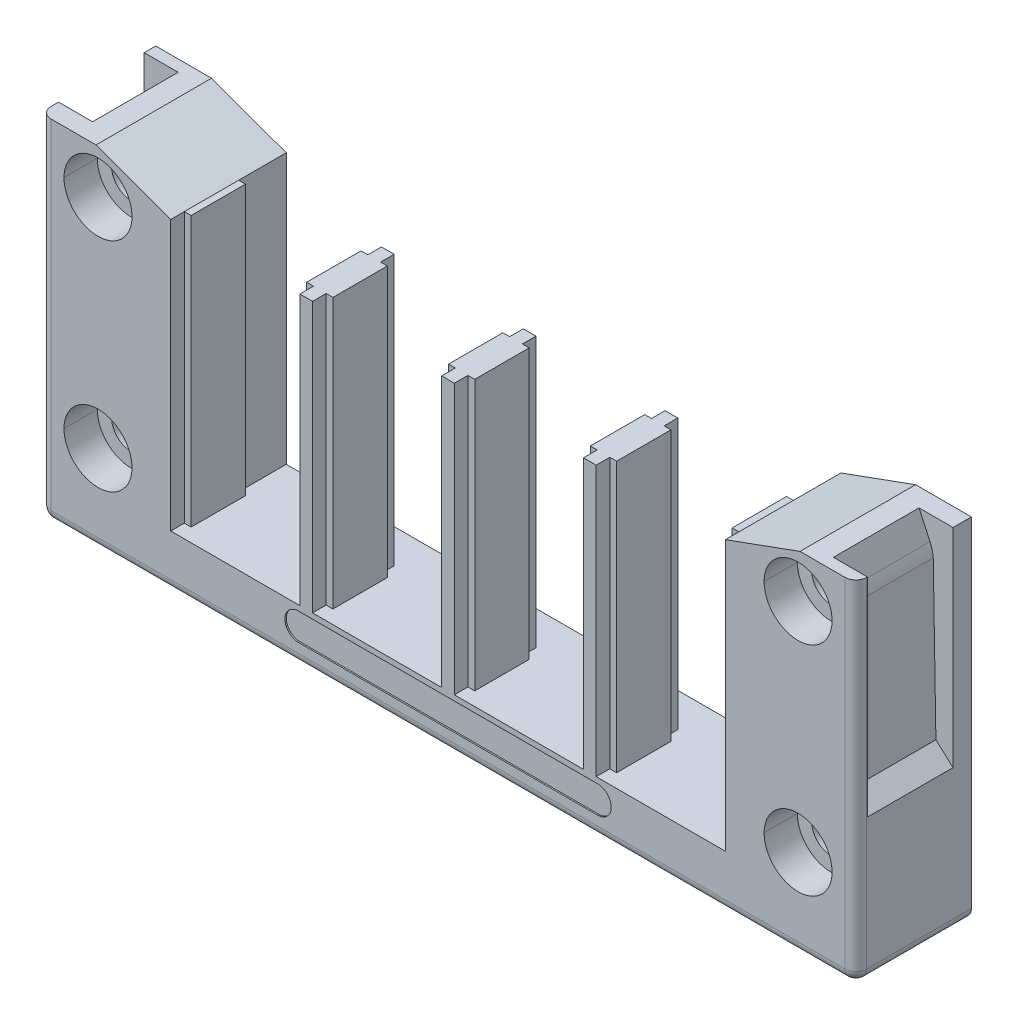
ISO-10303-21;
HEADER;
FILE_DESCRIPTION(('STEP AP214'),'2;1');
FILE_NAME('part.step','',(''),(''),'','','');
FILE_SCHEMA(('AUTOMOTIVE_DESIGN { 1 0 10303 214 1 1 1 1 }'));
ENDSEC;
DATA;
#1=APPLICATION_CONTEXT('core data for automotive mechanical design processes');
#2=APPLICATION_PROTOCOL_DEFINITION('international standard','automotive_design',2000,#1);
#3=PRODUCT_CONTEXT('',#1,'mechanical');
#4=PRODUCT('Part','Part','',(#3));
#5=PRODUCT_RELATED_PRODUCT_CATEGORY('part','',(#4));
#6=PRODUCT_DEFINITION_FORMATION('','',#4);
#7=PRODUCT_DEFINITION_CONTEXT('part definition',#1,'design');
#8=PRODUCT_DEFINITION('design','',#6,#7);
#9=PRODUCT_DEFINITION_SHAPE('','',#8);
#10=(LENGTH_UNIT() NAMED_UNIT(*) SI_UNIT(.MILLI.,.METRE.));
#11=(NAMED_UNIT(*) PLANE_ANGLE_UNIT() SI_UNIT($,.RADIAN.));
#12=(NAMED_UNIT(*) SI_UNIT($,.STERADIAN.) SOLID_ANGLE_UNIT());
#13=UNCERTAINTY_MEASURE_WITH_UNIT(LENGTH_MEASURE(1.E-05),#10,'distance_accuracy_value','');
#14=(GEOMETRIC_REPRESENTATION_CONTEXT(3) GLOBAL_UNCERTAINTY_ASSIGNED_CONTEXT((#13)) GLOBAL_UNIT_ASSIGNED_CONTEXT((#10,
#11,#12)) REPRESENTATION_CONTEXT('',''));
#15=CARTESIAN_POINT('',(0.,0.,0.));
#16=DIRECTION('',(0.,0.,1.));
#17=DIRECTION('',(1.,0.,0.));
#18=AXIS2_PLACEMENT_3D('',#15,#16,#17);
#19=CARTESIAN_POINT('',(-22.,-46.5,8.3));
#20=DIRECTION('',(0.,0.,1.));
#21=DIRECTION('',(1.,0.,0.));
#22=AXIS2_PLACEMENT_3D('',#19,#20,#21);
#23=PLANE('',#22);
#24=CARTESIAN_POINT('',(-22.,-46.5,8.3));
#25=DIRECTION('',(0.,0.,1.));
#26=DIRECTION('',(1.,0.,0.));
#27=AXIS2_PLACEMENT_3D('',#24,#25,#26);
#28=CIRCLE('',#27,2.);
#29=CARTESIAN_POINT('',(-22.,-44.5,8.3));
#30=VERTEX_POINT('',#29);
#31=CARTESIAN_POINT('',(-22.,-48.5,8.3));
#32=VERTEX_POINT('',#31);
#33=EDGE_CURVE('E1334',#30,#32,#28,.T.);
#34=ORIENTED_EDGE('',*,*,#33,.T.);
#35=DIRECTION('',(1.,0.,0.));
#36=VECTOR('',#35,1.);
#37=CARTESIAN_POINT('',(-22.,-48.5,8.3));
#38=LINE('',#37,#36);
#39=CARTESIAN_POINT('',(22.,-48.5,8.3));
#40=VERTEX_POINT('',#39);
#41=EDGE_CURVE('E10',#32,#40,#38,.T.);
#42=ORIENTED_EDGE('',*,*,#41,.T.);
#43=CARTESIAN_POINT('',(22.,-46.5,8.3));
#44=DIRECTION('',(0.,0.,1.));
#45=DIRECTION('',(1.,0.,0.));
#46=AXIS2_PLACEMENT_3D('',#43,#44,#45);
#47=CIRCLE('',#46,2.);
#48=CARTESIAN_POINT('',(24.,-46.5,8.3));
#49=VERTEX_POINT('',#48);
#50=EDGE_CURVE('E1339',#40,#49,#47,.T.);
#51=ORIENTED_EDGE('',*,*,#50,.T.);
#52=CARTESIAN_POINT('',(22.,-46.5,8.3));
#53=DIRECTION('',(0.,0.,1.));
#54=DIRECTION('',(1.,0.,0.));
#55=AXIS2_PLACEMENT_3D('',#52,#53,#54);
#56=CIRCLE('',#55,2.);
#57=CARTESIAN_POINT('',(22.,-44.5,8.3));
#58=VERTEX_POINT('',#57);
#59=EDGE_CURVE('E1930',#49,#58,#56,.T.);
#60=ORIENTED_EDGE('',*,*,#59,.T.);
#61=DIRECTION('',(-1.,0.,0.));
#62=VECTOR('',#61,1.);
#63=CARTESIAN_POINT('',(-22.,-44.5,8.3));
#64=LINE('',#63,#62);
#65=EDGE_CURVE('E40',#58,#30,#64,.T.);
#66=ORIENTED_EDGE('',*,*,#65,.T.);
#67=EDGE_LOOP('',(#34,#42,#51,#60,#66));
#68=FACE_BOUND('',#67,.T.);
#69=ADVANCED_FACE('F15',(#68),#23,.T.);
#70=CARTESIAN_POINT('',(-22.,-48.5,8.3));
#71=DIRECTION('',(0.,-1.,0.));
#72=DIRECTION('',(0.,0.,-1.));
#73=AXIS2_PLACEMENT_3D('',#70,#71,#72);
#74=PLANE('',#73);
#75=DIRECTION('',(1.,0.,0.));
#76=VECTOR('',#75,1.);
#77=CARTESIAN_POINT('',(-22.,-48.5,8.5));
#78=LINE('',#77,#76);
#79=CARTESIAN_POINT('',(-22.,-48.5,8.5));
#80=VERTEX_POINT('',#79);
#81=CARTESIAN_POINT('',(22.,-48.5,8.5));
#82=VERTEX_POINT('',#81);
#83=EDGE_CURVE('E1629',#80,#82,#78,.T.);
#84=ORIENTED_EDGE('',*,*,#83,.T.);
#85=DIRECTION('',(0.,0.,1.));
#86=VECTOR('',#85,1.);
#87=CARTESIAN_POINT('',(22.,-48.5,8.3));
#88=LINE('',#87,#86);
#89=EDGE_CURVE('E23',#40,#82,#88,.T.);
#90=ORIENTED_EDGE('',*,*,#89,.F.);
#91=ORIENTED_EDGE('',*,*,#41,.F.);
#92=DIRECTION('',(0.,0.,1.));
#93=VECTOR('',#92,1.);
#94=CARTESIAN_POINT('',(-22.,-48.5,8.3));
#95=LINE('',#94,#93);
#96=EDGE_CURVE('E1331',#32,#80,#95,.T.);
#97=ORIENTED_EDGE('',*,*,#96,.T.);
#98=EDGE_LOOP('',(#84,#90,#91,#97));
#99=FACE_BOUND('',#98,.T.);
#100=ADVANCED_FACE('F1949',(#99),#74,.F.);
#101=CARTESIAN_POINT('',(22.,-46.5,8.3));
#102=DIRECTION('',(0.,0.,1.));
#103=DIRECTION('',(1.,0.,0.));
#104=AXIS2_PLACEMENT_3D('',#101,#102,#103);
#105=CYLINDRICAL_SURFACE('',#104,2.);
#106=DIRECTION('',(0.,0.,1.));
#107=VECTOR('',#106,1.);
#108=CARTESIAN_POINT('',(24.,-46.5,8.3));
#109=LINE('',#108,#107);
#110=CARTESIAN_POINT('',(24.,-46.5,8.5));
#111=VERTEX_POINT('',#110);
#112=EDGE_CURVE('E1916',#49,#111,#109,.T.);
#113=ORIENTED_EDGE('',*,*,#112,.F.);
#114=ORIENTED_EDGE('',*,*,#50,.F.);
#115=ORIENTED_EDGE('',*,*,#89,.T.);
#116=CARTESIAN_POINT('',(22.,-46.5,8.5));
#117=DIRECTION('',(0.,0.,1.));
#118=DIRECTION('',(1.,0.,0.));
#119=AXIS2_PLACEMENT_3D('',#116,#117,#118);
#120=CIRCLE('',#119,2.);
#121=EDGE_CURVE('E897',#82,#111,#120,.T.);
#122=ORIENTED_EDGE('',*,*,#121,.T.);
#123=EDGE_LOOP('',(#113,#114,#115,#122));
#124=FACE_BOUND('',#123,.T.);
#125=ADVANCED_FACE('F1939',(#124),#105,.F.);
#126=CARTESIAN_POINT('',(-22.,-44.5,8.3));
#127=DIRECTION('',(0.,1.,0.));
#128=DIRECTION('',(1.,0.,0.));
#129=AXIS2_PLACEMENT_3D('',#126,#127,#128);
#130=PLANE('',#129);
#131=DIRECTION('',(-1.,0.,0.));
#132=VECTOR('',#131,1.);
#133=CARTESIAN_POINT('',(-22.,-44.5,8.5));
#134=LINE('',#133,#132);
#135=CARTESIAN_POINT('',(22.,-44.5,8.5));
#136=VERTEX_POINT('',#135);
#137=CARTESIAN_POINT('',(-22.,-44.5,8.5));
#138=VERTEX_POINT('',#137);
#139=EDGE_CURVE('E893',#136,#138,#134,.T.);
#140=ORIENTED_EDGE('',*,*,#139,.T.);
#141=DIRECTION('',(0.,0.,1.));
#142=VECTOR('',#141,1.);
#143=CARTESIAN_POINT('',(-22.,-44.5,8.3));
#144=LINE('',#143,#142);
#145=EDGE_CURVE('E1335',#30,#138,#144,.T.);
#146=ORIENTED_EDGE('',*,*,#145,.F.);
#147=ORIENTED_EDGE('',*,*,#65,.F.);
#148=DIRECTION('',(0.,0.,1.));
#149=VECTOR('',#148,1.);
#150=CARTESIAN_POINT('',(22.,-44.5,8.3));
#151=LINE('',#150,#149);
#152=EDGE_CURVE('E1901',#58,#136,#151,.T.);
#153=ORIENTED_EDGE('',*,*,#152,.T.);
#154=EDGE_LOOP('',(#140,#146,#147,#153));
#155=FACE_BOUND('',#154,.T.);
#156=ADVANCED_FACE('F1958',(#155),#130,.F.);
#157=CARTESIAN_POINT('',(-22.,-46.5,8.3));
#158=DIRECTION('',(0.,0.,1.));
#159=DIRECTION('',(1.,0.,0.));
#160=AXIS2_PLACEMENT_3D('',#157,#158,#159);
#161=CYLINDRICAL_SURFACE('',#160,2.);
#162=CARTESIAN_POINT('',(-22.,-46.5,8.5));
#163=DIRECTION('',(0.,0.,1.));
#164=DIRECTION('',(1.,0.,0.));
#165=AXIS2_PLACEMENT_3D('',#162,#163,#164);
#166=CIRCLE('',#165,2.);
#167=EDGE_CURVE('E775',#138,#80,#166,.T.);
#168=ORIENTED_EDGE('',*,*,#167,.T.);
#169=ORIENTED_EDGE('',*,*,#96,.F.);
#170=ORIENTED_EDGE('',*,*,#33,.F.);
#171=ORIENTED_EDGE('',*,*,#145,.T.);
#172=EDGE_LOOP('',(#168,#169,#170,#171));
#173=FACE_BOUND('',#172,.T.);
#174=ADVANCED_FACE('F1975',(#173),#161,.F.);
#175=CARTESIAN_POINT('',(22.8,-56.3075814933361,-1.5));
#176=DIRECTION('',(0.,0.,1.));
#177=DIRECTION('',(0.,-1.,0.));
#178=AXIS2_PLACEMENT_3D('',#175,#176,#177);
#179=PLANE('',#178);
#180=DIRECTION('',(0.,1.,0.));
#181=VECTOR('',#180,1.);
#182=CARTESIAN_POINT('',(22.8,-56.3075814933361,-1.5));
#183=LINE('',#182,#181);
#184=CARTESIAN_POINT('',(22.8000000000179,-43.7,-1.5));
#185=VERTEX_POINT('',#184);
#186=CARTESIAN_POINT('',(22.8,-4.,-1.5));
#187=VERTEX_POINT('',#186);
#188=EDGE_CURVE('E1328',#185,#187,#183,.T.);
#189=ORIENTED_EDGE('',*,*,#188,.F.);
#190=DIRECTION('',(-1.,0.,0.));
#191=VECTOR('',#190,1.);
#192=CARTESIAN_POINT('',(22.8,-43.7,-1.5));
#193=LINE('',#192,#191);
#194=CARTESIAN_POINT('',(21.7999999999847,-43.7,-1.5));
#195=VERTEX_POINT('',#194);
#196=EDGE_CURVE('E1498',#185,#195,#193,.T.);
#197=ORIENTED_EDGE('',*,*,#196,.T.);
#198=DIRECTION('',(0.,1.,0.));
#199=VECTOR('',#198,1.);
#200=CARTESIAN_POINT('',(21.8,-56.3075814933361,-1.5));
#201=LINE('',#200,#199);
#202=CARTESIAN_POINT('',(21.8,-4.,-1.5));
#203=VERTEX_POINT('',#202);
#204=EDGE_CURVE('E845',#195,#203,#201,.T.);
#205=ORIENTED_EDGE('',*,*,#204,.T.);
#206=DIRECTION('',(1.,0.,0.));
#207=VECTOR('',#206,1.);
#208=CARTESIAN_POINT('',(22.8,-4.,-1.5));
#209=LINE('',#208,#207);
#210=EDGE_CURVE('E1265',#203,#187,#209,.T.);
#211=ORIENTED_EDGE('',*,*,#210,.T.);
#212=EDGE_LOOP('',(#189,#197,#205,#211));
#213=FACE_BOUND('',#212,.T.);
#214=ADVANCED_FACE('F1815',(#213),#179,.F.);
#215=CARTESIAN_POINT('',(22.8,-56.3075814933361,-1.5));
#216=DIRECTION('',(-1.,0.,0.));
#217=DIRECTION('',(0.,0.,1.));
#218=AXIS2_PLACEMENT_3D('',#215,#216,#217);
#219=PLANE('',#218);
#220=DIRECTION('',(0.,1.,0.));
#221=VECTOR('',#220,1.);
#222=CARTESIAN_POINT('',(22.8,-56.3075814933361,6.5));
#223=LINE('',#222,#221);
#224=CARTESIAN_POINT('',(22.8000000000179,-43.7,6.5));
#225=VERTEX_POINT('',#224);
#226=CARTESIAN_POINT('',(22.8,-4.,6.5));
#227=VERTEX_POINT('',#226);
#228=EDGE_CURVE('E1325',#225,#227,#223,.T.);
#229=ORIENTED_EDGE('',*,*,#228,.F.);
#230=DIRECTION('',(0.,0.,-1.));
#231=VECTOR('',#230,1.);
#232=CARTESIAN_POINT('',(22.8,-43.7,-1.5));
#233=LINE('',#232,#231);
#234=EDGE_CURVE('E1506',#225,#185,#233,.T.);
#235=ORIENTED_EDGE('',*,*,#234,.T.);
#236=ORIENTED_EDGE('',*,*,#188,.T.);
#237=DIRECTION('',(0.,0.,1.));
#238=VECTOR('',#237,1.);
#239=CARTESIAN_POINT('',(22.8,-4.,-1.5));
#240=LINE('',#239,#238);
#241=EDGE_CURVE('E1304',#187,#227,#240,.T.);
#242=ORIENTED_EDGE('',*,*,#241,.T.);
#243=EDGE_LOOP('',(#229,#235,#236,#242));
#244=FACE_BOUND('',#243,.T.);
#245=ADVANCED_FACE('F1818',(#244),#219,.F.);
#246=CARTESIAN_POINT('',(22.8,-56.3075814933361,6.5));
#247=DIRECTION('',(0.,0.,-1.));
#248=DIRECTION('',(0.,-1.,0.));
#249=AXIS2_PLACEMENT_3D('',#246,#247,#248);
#250=PLANE('',#249);
#251=DIRECTION('',(0.,1.,0.));
#252=VECTOR('',#251,1.);
#253=CARTESIAN_POINT('',(21.8,-56.3075814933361,6.5));
#254=LINE('',#253,#252);
#255=CARTESIAN_POINT('',(21.7999999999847,-43.7,6.5));
#256=VERTEX_POINT('',#255);
#257=CARTESIAN_POINT('',(21.8,-4.,6.5));
#258=VERTEX_POINT('',#257);
#259=EDGE_CURVE('E1322',#256,#258,#254,.T.);
#260=ORIENTED_EDGE('',*,*,#259,.F.);
#261=DIRECTION('',(1.,0.,0.));
#262=VECTOR('',#261,1.);
#263=CARTESIAN_POINT('',(22.8,-43.7,6.5));
#264=LINE('',#263,#262);
#265=EDGE_CURVE('E1514',#256,#225,#264,.T.);
#266=ORIENTED_EDGE('',*,*,#265,.T.);
#267=ORIENTED_EDGE('',*,*,#228,.T.);
#268=DIRECTION('',(-1.,0.,0.));
#269=VECTOR('',#268,1.);
#270=CARTESIAN_POINT('',(22.8,-4.,6.5));
#271=LINE('',#270,#269);
#272=EDGE_CURVE('E1300',#227,#258,#271,.T.);
#273=ORIENTED_EDGE('',*,*,#272,.T.);
#274=EDGE_LOOP('',(#260,#266,#267,#273));
#275=FACE_BOUND('',#274,.T.);
#276=ADVANCED_FACE('F1823',(#275),#250,.F.);
#277=CARTESIAN_POINT('',(21.8,-56.3075814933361,6.5));
#278=DIRECTION('',(-1.,0.,0.));
#279=DIRECTION('',(0.,0.,1.));
#280=AXIS2_PLACEMENT_3D('',#277,#278,#279);
#281=PLANE('',#280);
#282=DIRECTION('',(0.,1.,0.));
#283=VECTOR('',#282,1.);
#284=CARTESIAN_POINT('',(21.8,-56.3075814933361,8.5));
#285=LINE('',#284,#283);
#286=CARTESIAN_POINT('',(21.8,-43.7,8.5));
#287=VERTEX_POINT('',#286);
#288=CARTESIAN_POINT('',(21.8,-4.,8.5));
#289=VERTEX_POINT('',#288);
#290=EDGE_CURVE('E863',#287,#289,#285,.T.);
#291=ORIENTED_EDGE('',*,*,#290,.F.);
#292=DIRECTION('',(0.,0.,-1.));
#293=VECTOR('',#292,1.);
#294=CARTESIAN_POINT('',(21.8,-43.7,6.5));
#295=LINE('',#294,#293);
#296=EDGE_CURVE('E1522',#287,#256,#295,.T.);
#297=ORIENTED_EDGE('',*,*,#296,.T.);
#298=ORIENTED_EDGE('',*,*,#259,.T.);
#299=DIRECTION('',(0.,0.,1.));
#300=VECTOR('',#299,1.);
#301=CARTESIAN_POINT('',(21.8,-4.,6.5));
#302=LINE('',#301,#300);
#303=EDGE_CURVE('E1297',#258,#289,#302,.T.);
#304=ORIENTED_EDGE('',*,*,#303,.T.);
#305=EDGE_LOOP('',(#291,#297,#298,#304));
#306=FACE_BOUND('',#305,.T.);
#307=ADVANCED_FACE('F1827',(#306),#281,.F.);
#308=CARTESIAN_POINT('',(19.9333333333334,-56.3075814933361,6.5));
#309=DIRECTION('',(1.,0.,0.));
#310=DIRECTION('',(0.,1.,0.));
#311=AXIS2_PLACEMENT_3D('',#308,#309,#310);
#312=PLANE('',#311);
#313=DIRECTION('',(0.,1.,0.));
#314=VECTOR('',#313,1.);
#315=CARTESIAN_POINT('',(19.9333333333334,-56.3075814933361,6.5));
#316=LINE('',#315,#314);
#317=CARTESIAN_POINT('',(19.9333333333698,-43.7,6.5));
#318=VERTEX_POINT('',#317);
#319=CARTESIAN_POINT('',(19.9333333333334,-4.,6.5));
#320=VERTEX_POINT('',#319);
#321=EDGE_CURVE('E1319',#318,#320,#316,.T.);
#322=ORIENTED_EDGE('',*,*,#321,.F.);
#323=DIRECTION('',(0.,0.,1.));
#324=VECTOR('',#323,1.);
#325=CARTESIAN_POINT('',(19.9333333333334,-43.7,6.5));
#326=LINE('',#325,#324);
#327=CARTESIAN_POINT('',(19.9333333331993,-43.7,8.5));
#328=VERTEX_POINT('',#327);
#329=EDGE_CURVE('E1442',#318,#328,#326,.T.);
#330=ORIENTED_EDGE('',*,*,#329,.T.);
#331=DIRECTION('',(0.,1.,0.));
#332=VECTOR('',#331,1.);
#333=CARTESIAN_POINT('',(19.9333333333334,-56.3075814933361,8.5));
#334=LINE('',#333,#332);
#335=CARTESIAN_POINT('',(19.9333333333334,-4.,8.5));
#336=VERTEX_POINT('',#335);
#337=EDGE_CURVE('E862',#328,#336,#334,.T.);
#338=ORIENTED_EDGE('',*,*,#337,.T.);
#339=DIRECTION('',(0.,0.,-1.));
#340=VECTOR('',#339,1.);
#341=CARTESIAN_POINT('',(19.9333333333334,-4.,6.5));
#342=LINE('',#341,#340);
#343=EDGE_CURVE('E1293',#336,#320,#342,.T.);
#344=ORIENTED_EDGE('',*,*,#343,.T.);
#345=EDGE_LOOP('',(#322,#330,#338,#344));
#346=FACE_BOUND('',#345,.T.);
#347=ADVANCED_FACE('F1788',(#346),#312,.F.);
#348=CARTESIAN_POINT('',(19.9333333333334,-56.3075814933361,6.5));
#349=DIRECTION('',(0.,0.,-1.));
#350=DIRECTION('',(0.,-1.,0.));
#351=AXIS2_PLACEMENT_3D('',#348,#349,#350);
#352=PLANE('',#351);
#353=DIRECTION('',(0.,1.,0.));
#354=VECTOR('',#353,1.);
#355=CARTESIAN_POINT('',(18.9333333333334,-56.3075814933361,6.5));
#356=LINE('',#355,#354);
#357=CARTESIAN_POINT('',(18.9333333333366,-43.7,6.5));
#358=VERTEX_POINT('',#357);
#359=CARTESIAN_POINT('',(18.9333333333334,-4.,6.5));
#360=VERTEX_POINT('',#359);
#361=EDGE_CURVE('E1316',#358,#360,#356,.T.);
#362=ORIENTED_EDGE('',*,*,#361,.F.);
#363=DIRECTION('',(1.,0.,0.));
#364=VECTOR('',#363,1.);
#365=CARTESIAN_POINT('',(19.9333333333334,-43.7,6.5));
#366=LINE('',#365,#364);
#367=EDGE_CURVE('E1452',#358,#318,#366,.T.);
#368=ORIENTED_EDGE('',*,*,#367,.T.);
#369=ORIENTED_EDGE('',*,*,#321,.T.);
#370=DIRECTION('',(-1.,0.,0.));
#371=VECTOR('',#370,1.);
#372=CARTESIAN_POINT('',(19.9333333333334,-4.,6.5));
#373=LINE('',#372,#371);
#374=EDGE_CURVE('E1289',#320,#360,#373,.T.);
#375=ORIENTED_EDGE('',*,*,#374,.T.);
#376=EDGE_LOOP('',(#362,#368,#369,#375));
#377=FACE_BOUND('',#376,.T.);
#378=ADVANCED_FACE('F1791',(#377),#352,.F.);
#379=CARTESIAN_POINT('',(18.9333333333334,-56.3075814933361,-1.5));
#380=DIRECTION('',(1.,0.,0.));
#381=DIRECTION('',(0.,1.,0.));
#382=AXIS2_PLACEMENT_3D('',#379,#380,#381);
#383=PLANE('',#382);
#384=DIRECTION('',(0.,1.,0.));
#385=VECTOR('',#384,1.);
#386=CARTESIAN_POINT('',(18.9333333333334,-56.3075814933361,-1.5));
#387=LINE('',#386,#385);
#388=CARTESIAN_POINT('',(18.9333333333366,-43.7,-1.5));
#389=VERTEX_POINT('',#388);
#390=CARTESIAN_POINT('',(18.9333333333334,-4.,-1.5));
#391=VERTEX_POINT('',#390);
#392=EDGE_CURVE('E1313',#389,#391,#387,.T.);
#393=ORIENTED_EDGE('',*,*,#392,.F.);
#394=DIRECTION('',(0.,0.,1.));
#395=VECTOR('',#394,1.);
#396=CARTESIAN_POINT('',(18.9333333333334,-43.7,-1.5));
#397=LINE('',#396,#395);
#398=EDGE_CURVE('E1460',#389,#358,#397,.T.);
#399=ORIENTED_EDGE('',*,*,#398,.T.);
#400=ORIENTED_EDGE('',*,*,#361,.T.);
#401=DIRECTION('',(0.,0.,-1.));
#402=VECTOR('',#401,1.);
#403=CARTESIAN_POINT('',(18.9333333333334,-4.,-1.5));
#404=LINE('',#403,#402);
#405=EDGE_CURVE('E1285',#360,#391,#404,.T.);
#406=ORIENTED_EDGE('',*,*,#405,.T.);
#407=EDGE_LOOP('',(#393,#399,#400,#406));
#408=FACE_BOUND('',#407,.T.);
#409=ADVANCED_FACE('F1794',(#408),#383,.F.);
#410=CARTESIAN_POINT('',(19.9333333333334,-56.3075814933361,-1.5));
#411=DIRECTION('',(0.,0.,1.));
#412=DIRECTION('',(0.,-1.,0.));
#413=AXIS2_PLACEMENT_3D('',#410,#411,#412);
#414=PLANE('',#413);
#415=DIRECTION('',(0.,1.,0.));
#416=VECTOR('',#415,1.);
#417=CARTESIAN_POINT('',(19.9333333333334,-56.3075814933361,-1.5));
#418=LINE('',#417,#416);
#419=CARTESIAN_POINT('',(19.933333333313,-43.7,-1.5));
#420=VERTEX_POINT('',#419);
#421=CARTESIAN_POINT('',(19.9333333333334,-4.,-1.5));
#422=VERTEX_POINT('',#421);
#423=EDGE_CURVE('E1312',#420,#422,#418,.T.);
#424=ORIENTED_EDGE('',*,*,#423,.F.);
#425=DIRECTION('',(-1.,0.,0.));
#426=VECTOR('',#425,1.);
#427=CARTESIAN_POINT('',(19.9333333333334,-43.7,-1.5));
#428=LINE('',#427,#426);
#429=EDGE_CURVE('E1468',#420,#389,#428,.T.);
#430=ORIENTED_EDGE('',*,*,#429,.T.);
#431=ORIENTED_EDGE('',*,*,#392,.T.);
#432=DIRECTION('',(1.,0.,0.));
#433=VECTOR('',#432,1.);
#434=CARTESIAN_POINT('',(19.9333333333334,-4.,-1.5));
#435=LINE('',#434,#433);
#436=EDGE_CURVE('E1281',#391,#422,#435,.T.);
#437=ORIENTED_EDGE('',*,*,#436,.T.);
#438=EDGE_LOOP('',(#424,#430,#431,#437));
#439=FACE_BOUND('',#438,.T.);
#440=ADVANCED_FACE('F1799',(#439),#414,.F.);
#441=CARTESIAN_POINT('',(19.9333333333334,-56.3075814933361,-3.5));
#442=DIRECTION('',(1.,0.,0.));
#443=DIRECTION('',(0.,1.,0.));
#444=AXIS2_PLACEMENT_3D('',#441,#442,#443);
#445=PLANE('',#444);
#446=DIRECTION('',(0.,1.,0.));
#447=VECTOR('',#446,1.);
#448=CARTESIAN_POINT('',(19.9333333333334,-56.3075814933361,-3.5));
#449=LINE('',#448,#447);
#450=CARTESIAN_POINT('',(19.933333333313,-43.7,-3.5));
#451=VERTEX_POINT('',#450);
#452=CARTESIAN_POINT('',(19.9333333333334,-4.,-3.5));
#453=VERTEX_POINT('',#452);
#454=EDGE_CURVE('E844',#451,#453,#449,.T.);
#455=ORIENTED_EDGE('',*,*,#454,.F.);
#456=DIRECTION('',(0.,0.,1.));
#457=VECTOR('',#456,1.);
#458=CARTESIAN_POINT('',(19.9333333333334,-43.7,-3.5));
#459=LINE('',#458,#457);
#460=EDGE_CURVE('E1472',#451,#420,#459,.T.);
#461=ORIENTED_EDGE('',*,*,#460,.T.);
#462=ORIENTED_EDGE('',*,*,#423,.T.);
#463=DIRECTION('',(0.,0.,-1.));
#464=VECTOR('',#463,1.);
#465=CARTESIAN_POINT('',(19.9333333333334,-4.,-3.5));
#466=LINE('',#465,#464);
#467=EDGE_CURVE('E1277',#422,#453,#466,.T.);
#468=ORIENTED_EDGE('',*,*,#467,.T.);
#469=EDGE_LOOP('',(#455,#461,#462,#468));
#470=FACE_BOUND('',#469,.T.);
#471=ADVANCED_FACE('F1803',(#470),#445,.F.);
#472=CARTESIAN_POINT('',(21.8,-56.3075814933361,-3.5));
#473=DIRECTION('',(0.,0.,1.));
#474=DIRECTION('',(1.,0.,0.));
#475=AXIS2_PLACEMENT_3D('',#472,#473,#474);
#476=PLANE('',#475);
#477=DIRECTION('',(0.,1.,0.));
#478=VECTOR('',#477,1.);
#479=CARTESIAN_POINT('',(21.8,-56.3075814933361,-3.5));
#480=LINE('',#479,#478);
#481=CARTESIAN_POINT('',(21.7999999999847,-43.7,-3.5));
#482=VERTEX_POINT('',#481);
#483=CARTESIAN_POINT('',(21.8,-4.,-3.5));
#484=VERTEX_POINT('',#483);
#485=EDGE_CURVE('E841',#482,#484,#480,.T.);
#486=ORIENTED_EDGE('',*,*,#485,.F.);
#487=DIRECTION('',(-1.,0.,0.));
#488=VECTOR('',#487,1.);
#489=CARTESIAN_POINT('',(21.8,-43.7,-3.5));
#490=LINE('',#489,#488);
#491=EDGE_CURVE('E1482',#482,#451,#490,.T.);
#492=ORIENTED_EDGE('',*,*,#491,.T.);
#493=ORIENTED_EDGE('',*,*,#454,.T.);
#494=DIRECTION('',(1.,0.,0.));
#495=VECTOR('',#494,1.);
#496=CARTESIAN_POINT('',(21.8,-4.,-3.5));
#497=LINE('',#496,#495);
#498=EDGE_CURVE('E1273',#453,#484,#497,.T.);
#499=ORIENTED_EDGE('',*,*,#498,.T.);
#500=EDGE_LOOP('',(#486,#492,#493,#499));
#501=FACE_BOUND('',#500,.T.);
#502=ADVANCED_FACE('F1806',(#501),#476,.F.);
#503=CARTESIAN_POINT('',(21.8,-56.3075814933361,-3.5));
#504=DIRECTION('',(-1.,0.,0.));
#505=DIRECTION('',(0.,0.,1.));
#506=AXIS2_PLACEMENT_3D('',#503,#504,#505);
#507=PLANE('',#506);
#508=ORIENTED_EDGE('',*,*,#204,.F.);
#509=DIRECTION('',(0.,0.,-1.));
#510=VECTOR('',#509,1.);
#511=CARTESIAN_POINT('',(21.8,-43.7,-3.5));
#512=LINE('',#511,#510);
#513=EDGE_CURVE('E1490',#195,#482,#512,.T.);
#514=ORIENTED_EDGE('',*,*,#513,.T.);
#515=ORIENTED_EDGE('',*,*,#485,.T.);
#516=DIRECTION('',(0.,0.,1.));
#517=VECTOR('',#516,1.);
#518=CARTESIAN_POINT('',(21.8,-4.,-3.5));
#519=LINE('',#518,#517);
#520=EDGE_CURVE('E1269',#484,#203,#519,.T.);
#521=ORIENTED_EDGE('',*,*,#520,.T.);
#522=EDGE_LOOP('',(#508,#514,#515,#521));
#523=FACE_BOUND('',#522,.T.);
#524=ADVANCED_FACE('F1811',(#523),#507,.F.);
#525=CARTESIAN_POINT('',(0.,-4.,0.));
#526=DIRECTION('',(0.,1.,0.));
#527=DIRECTION('',(1.,0.,0.));
#528=AXIS2_PLACEMENT_3D('',#525,#526,#527);
#529=PLANE('',#528);
#530=ORIENTED_EDGE('',*,*,#210,.F.);
#531=ORIENTED_EDGE('',*,*,#520,.F.);
#532=ORIENTED_EDGE('',*,*,#498,.F.);
#533=ORIENTED_EDGE('',*,*,#467,.F.);
#534=ORIENTED_EDGE('',*,*,#436,.F.);
#535=ORIENTED_EDGE('',*,*,#405,.F.);
#536=ORIENTED_EDGE('',*,*,#374,.F.);
#537=ORIENTED_EDGE('',*,*,#343,.F.);
#538=DIRECTION('',(-1.,0.,0.));
#539=VECTOR('',#538,1.);
#540=CARTESIAN_POINT('',(21.8,-4.,8.5));
#541=LINE('',#540,#539);
#542=EDGE_CURVE('E858',#289,#336,#541,.T.);
#543=ORIENTED_EDGE('',*,*,#542,.F.);
#544=ORIENTED_EDGE('',*,*,#303,.F.);
#545=ORIENTED_EDGE('',*,*,#272,.F.);
#546=ORIENTED_EDGE('',*,*,#241,.F.);
#547=EDGE_LOOP('',(#530,#531,#532,#533,#534,#535,#536,#537,#543,#544,#545,#546));
#548=FACE_BOUND('',#547,.T.);
#549=ADVANCED_FACE('F1978',(#548),#529,.T.);
#550=CARTESIAN_POINT('',(-18.9333333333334,-56.3075814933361,-1.5));
#551=DIRECTION('',(-1.,0.,0.));
#552=DIRECTION('',(0.,0.,1.));
#553=AXIS2_PLACEMENT_3D('',#550,#551,#552);
#554=PLANE('',#553);
#555=DIRECTION('',(0.,1.,0.));
#556=VECTOR('',#555,1.);
#557=CARTESIAN_POINT('',(-18.9333333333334,-56.3075814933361,6.5));
#558=LINE('',#557,#556);
#559=CARTESIAN_POINT('',(-18.9333333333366,-43.7,6.5));
#560=VERTEX_POINT('',#559);
#561=CARTESIAN_POINT('',(-18.9333333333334,-4.,6.5));
#562=VERTEX_POINT('',#561);
#563=EDGE_CURVE('E1262',#560,#562,#558,.T.);
#564=ORIENTED_EDGE('',*,*,#563,.F.);
#565=DIRECTION('',(0.,0.,-1.));
#566=VECTOR('',#565,1.);
#567=CARTESIAN_POINT('',(-18.9333333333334,-43.7,-1.5));
#568=LINE('',#567,#566);
#569=CARTESIAN_POINT('',(-18.9333333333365,-43.7,-1.5));
#570=VERTEX_POINT('',#569);
#571=EDGE_CURVE('E1443',#560,#570,#568,.T.);
#572=ORIENTED_EDGE('',*,*,#571,.T.);
#573=DIRECTION('',(0.,1.,0.));
#574=VECTOR('',#573,1.);
#575=CARTESIAN_POINT('',(-18.9333333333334,-56.3075814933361,-1.5));
#576=LINE('',#575,#574);
#577=CARTESIAN_POINT('',(-18.9333333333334,-4.,-1.5));
#578=VERTEX_POINT('',#577);
#579=EDGE_CURVE('E1237',#570,#578,#576,.T.);
#580=ORIENTED_EDGE('',*,*,#579,.T.);
#581=DIRECTION('',(0.,0.,1.));
#582=VECTOR('',#581,1.);
#583=CARTESIAN_POINT('',(-18.9333333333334,-4.,-1.5));
#584=LINE('',#583,#582);
#585=EDGE_CURVE('E1144',#578,#562,#584,.T.);
#586=ORIENTED_EDGE('',*,*,#585,.T.);
#587=EDGE_LOOP('',(#564,#572,#580,#586));
#588=FACE_BOUND('',#587,.T.);
#589=ADVANCED_FACE('F1981',(#588),#554,.F.);
#590=CARTESIAN_POINT('',(-18.9333333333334,-56.3075814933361,6.5));
#591=DIRECTION('',(0.,0.,-1.));
#592=DIRECTION('',(0.,-1.,0.));
#593=AXIS2_PLACEMENT_3D('',#590,#591,#592);
#594=PLANE('',#593);
#595=DIRECTION('',(0.,1.,0.));
#596=VECTOR('',#595,1.);
#597=CARTESIAN_POINT('',(-19.9333333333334,-56.3075814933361,6.5));
#598=LINE('',#597,#596);
#599=CARTESIAN_POINT('',(-19.9333333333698,-43.7,6.5));
#600=VERTEX_POINT('',#599);
#601=CARTESIAN_POINT('',(-19.9333333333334,-4.,6.5));
#602=VERTEX_POINT('',#601);
#603=EDGE_CURVE('E1259',#600,#602,#598,.T.);
#604=ORIENTED_EDGE('',*,*,#603,.F.);
#605=DIRECTION('',(1.,0.,0.));
#606=VECTOR('',#605,1.);
#607=CARTESIAN_POINT('',(-18.9333333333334,-43.7,6.5));
#608=LINE('',#607,#606);
#609=EDGE_CURVE('E1447',#600,#560,#608,.T.);
#610=ORIENTED_EDGE('',*,*,#609,.T.);
#611=ORIENTED_EDGE('',*,*,#563,.T.);
#612=DIRECTION('',(-1.,0.,0.));
#613=VECTOR('',#612,1.);
#614=CARTESIAN_POINT('',(-18.9333333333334,-4.,6.5));
#615=LINE('',#614,#613);
#616=EDGE_CURVE('E1233',#562,#602,#615,.T.);
#617=ORIENTED_EDGE('',*,*,#616,.T.);
#618=EDGE_LOOP('',(#604,#610,#611,#617));
#619=FACE_BOUND('',#618,.T.);
#620=ADVANCED_FACE('F1983',(#619),#594,.F.);
#621=CARTESIAN_POINT('',(-19.9333333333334,-56.3075814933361,6.5));
#622=DIRECTION('',(-1.,0.,0.));
#623=DIRECTION('',(0.,0.,1.));
#624=AXIS2_PLACEMENT_3D('',#621,#622,#623);
#625=PLANE('',#624);
#626=DIRECTION('',(0.,1.,0.));
#627=VECTOR('',#626,1.);
#628=CARTESIAN_POINT('',(-19.9333333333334,-56.3075814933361,8.5));
#629=LINE('',#628,#627);
#630=CARTESIAN_POINT('',(-19.9333333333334,-43.7,8.5));
#631=VERTEX_POINT('',#630);
#632=CARTESIAN_POINT('',(-19.9333333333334,-4.,8.5));
#633=VERTEX_POINT('',#632);
#634=EDGE_CURVE('E879',#631,#633,#629,.T.);
#635=ORIENTED_EDGE('',*,*,#634,.F.);
#636=DIRECTION('',(0.,0.,-1.));
#637=VECTOR('',#636,1.);
#638=CARTESIAN_POINT('',(-19.9333333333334,-43.7,6.5));
#639=LINE('',#638,#637);
#640=EDGE_CURVE('E1456',#631,#600,#639,.T.);
#641=ORIENTED_EDGE('',*,*,#640,.T.);
#642=ORIENTED_EDGE('',*,*,#603,.T.);
#643=DIRECTION('',(0.,0.,1.));
#644=VECTOR('',#643,1.);
#645=CARTESIAN_POINT('',(-19.9333333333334,-4.,6.5));
#646=LINE('',#645,#644);
#647=EDGE_CURVE('E1230',#602,#633,#646,.T.);
#648=ORIENTED_EDGE('',*,*,#647,.T.);
#649=EDGE_LOOP('',(#635,#641,#642,#648));
#650=FACE_BOUND('',#649,.T.);
#651=ADVANCED_FACE('F1986',(#650),#625,.F.);
#652=CARTESIAN_POINT('',(-21.8,-56.3075814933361,6.5));
#653=DIRECTION('',(1.,0.,0.));
#654=DIRECTION('',(0.,1.,0.));
#655=AXIS2_PLACEMENT_3D('',#652,#653,#654);
#656=PLANE('',#655);
#657=DIRECTION('',(0.,1.,0.));
#658=VECTOR('',#657,1.);
#659=CARTESIAN_POINT('',(-21.8,-56.3075814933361,6.5));
#660=LINE('',#659,#658);
#661=CARTESIAN_POINT('',(-21.7999999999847,-43.7,6.5));
#662=VERTEX_POINT('',#661);
#663=CARTESIAN_POINT('',(-21.8,-4.,6.5));
#664=VERTEX_POINT('',#663);
#665=EDGE_CURVE('E1256',#662,#664,#660,.T.);
#666=ORIENTED_EDGE('',*,*,#665,.F.);
#667=DIRECTION('',(0.,0.,1.));
#668=VECTOR('',#667,1.);
#669=CARTESIAN_POINT('',(-21.8,-43.7,6.5));
#670=LINE('',#669,#668);
#671=CARTESIAN_POINT('',(-21.8000000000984,-43.7,8.5));
#672=VERTEX_POINT('',#671);
#673=EDGE_CURVE('E1584',#662,#672,#670,.T.);
#674=ORIENTED_EDGE('',*,*,#673,.T.);
#675=DIRECTION('',(0.,1.,0.));
#676=VECTOR('',#675,1.);
#677=CARTESIAN_POINT('',(-21.8,-56.3075814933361,8.5));
#678=LINE('',#677,#676);
#679=CARTESIAN_POINT('',(-21.8,-4.,8.5));
#680=VERTEX_POINT('',#679);
#681=EDGE_CURVE('E776',#672,#680,#678,.T.);
#682=ORIENTED_EDGE('',*,*,#681,.T.);
#683=DIRECTION('',(0.,0.,-1.));
#684=VECTOR('',#683,1.);
#685=CARTESIAN_POINT('',(-21.8,-4.,6.5));
#686=LINE('',#685,#684);
#687=EDGE_CURVE('E1226',#680,#664,#686,.T.);
#688=ORIENTED_EDGE('',*,*,#687,.T.);
#689=EDGE_LOOP('',(#666,#674,#682,#688));
#690=FACE_BOUND('',#689,.T.);
#691=ADVANCED_FACE('F1890',(#690),#656,.F.);
#692=CARTESIAN_POINT('',(-21.8,-56.3075814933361,6.5));
#693=DIRECTION('',(0.,0.,-1.));
#694=DIRECTION('',(0.,-1.,0.));
#695=AXIS2_PLACEMENT_3D('',#692,#693,#694);
#696=PLANE('',#695);
#697=DIRECTION('',(0.,1.,0.));
#698=VECTOR('',#697,1.);
#699=CARTESIAN_POINT('',(-22.8,-56.3075814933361,6.5));
#700=LINE('',#699,#698);
#701=CARTESIAN_POINT('',(-22.8000000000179,-43.7,6.5));
#702=VERTEX_POINT('',#701);
#703=CARTESIAN_POINT('',(-22.8,-4.,6.5));
#704=VERTEX_POINT('',#703);
#705=EDGE_CURVE('E1253',#702,#704,#700,.T.);
#706=ORIENTED_EDGE('',*,*,#705,.F.);
#707=DIRECTION('',(1.,0.,0.));
#708=VECTOR('',#707,1.);
#709=CARTESIAN_POINT('',(-21.8,-43.7,6.5));
#710=LINE('',#709,#708);
#711=EDGE_CURVE('E1588',#702,#662,#710,.T.);
#712=ORIENTED_EDGE('',*,*,#711,.T.);
#713=ORIENTED_EDGE('',*,*,#665,.T.);
#714=DIRECTION('',(-1.,0.,0.));
#715=VECTOR('',#714,1.);
#716=CARTESIAN_POINT('',(-21.8,-4.,6.5));
#717=LINE('',#716,#715);
#718=EDGE_CURVE('E1222',#664,#704,#717,.T.);
#719=ORIENTED_EDGE('',*,*,#718,.T.);
#720=EDGE_LOOP('',(#706,#712,#713,#719));
#721=FACE_BOUND('',#720,.T.);
#722=ADVANCED_FACE('F1893',(#721),#696,.F.);
#723=CARTESIAN_POINT('',(-22.8,-56.3075814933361,-1.5));
#724=DIRECTION('',(1.,0.,0.));
#725=DIRECTION('',(0.,1.,0.));
#726=AXIS2_PLACEMENT_3D('',#723,#724,#725);
#727=PLANE('',#726);
#728=DIRECTION('',(0.,1.,0.));
#729=VECTOR('',#728,1.);
#730=CARTESIAN_POINT('',(-22.8,-56.3075814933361,-1.5));
#731=LINE('',#730,#729);
#732=CARTESIAN_POINT('',(-22.8000000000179,-43.7,-1.5));
#733=VERTEX_POINT('',#732);
#734=CARTESIAN_POINT('',(-22.8,-4.,-1.5));
#735=VERTEX_POINT('',#734);
#736=EDGE_CURVE('E1250',#733,#735,#731,.T.);
#737=ORIENTED_EDGE('',*,*,#736,.F.);
#738=DIRECTION('',(0.,0.,1.));
#739=VECTOR('',#738,1.);
#740=CARTESIAN_POINT('',(-22.8,-43.7,-1.5));
#741=LINE('',#740,#739);
#742=EDGE_CURVE('E1594',#733,#702,#741,.T.);
#743=ORIENTED_EDGE('',*,*,#742,.T.);
#744=ORIENTED_EDGE('',*,*,#705,.T.);
#745=DIRECTION('',(0.,0.,-1.));
#746=VECTOR('',#745,1.);
#747=CARTESIAN_POINT('',(-22.8,-4.,-1.5));
#748=LINE('',#747,#746);
#749=EDGE_CURVE('E1086',#704,#735,#748,.T.);
#750=ORIENTED_EDGE('',*,*,#749,.T.);
#751=EDGE_LOOP('',(#737,#743,#744,#750));
#752=FACE_BOUND('',#751,.T.);
#753=ADVANCED_FACE('F1993',(#752),#727,.F.);
#754=CARTESIAN_POINT('',(-21.8,-56.3075814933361,-1.5));
#755=DIRECTION('',(0.,0.,1.));
#756=DIRECTION('',(0.,-1.,0.));
#757=AXIS2_PLACEMENT_3D('',#754,#755,#756);
#758=PLANE('',#757);
#759=DIRECTION('',(0.,1.,0.));
#760=VECTOR('',#759,1.);
#761=CARTESIAN_POINT('',(-21.8,-56.3075814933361,-1.5));
#762=LINE('',#761,#760);
#763=CARTESIAN_POINT('',(-21.7999999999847,-43.7,-1.5));
#764=VERTEX_POINT('',#763);
#765=CARTESIAN_POINT('',(-21.8,-4.,-1.5));
#766=VERTEX_POINT('',#765);
#767=EDGE_CURVE('E1249',#764,#766,#762,.T.);
#768=ORIENTED_EDGE('',*,*,#767,.F.);
#769=DIRECTION('',(-1.,0.,0.));
#770=VECTOR('',#769,1.);
#771=CARTESIAN_POINT('',(-21.8,-43.7,-1.5));
#772=LINE('',#771,#770);
#773=EDGE_CURVE('E1598',#764,#733,#772,.T.);
#774=ORIENTED_EDGE('',*,*,#773,.T.);
#775=ORIENTED_EDGE('',*,*,#736,.T.);
#776=DIRECTION('',(1.,0.,0.));
#777=VECTOR('',#776,1.);
#778=CARTESIAN_POINT('',(-21.8,-4.,-1.5));
#779=LINE('',#778,#777);
#780=EDGE_CURVE('E1082',#735,#766,#779,.T.);
#781=ORIENTED_EDGE('',*,*,#780,.T.);
#782=EDGE_LOOP('',(#768,#774,#775,#781));
#783=FACE_BOUND('',#782,.T.);
#784=ADVANCED_FACE('F1996',(#783),#758,.F.);
#785=CARTESIAN_POINT('',(-21.8,-56.3075814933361,-3.5));
#786=DIRECTION('',(1.,0.,0.));
#787=DIRECTION('',(0.,1.,0.));
#788=AXIS2_PLACEMENT_3D('',#785,#786,#787);
#789=PLANE('',#788);
#790=DIRECTION('',(0.,1.,0.));
#791=VECTOR('',#790,1.);
#792=CARTESIAN_POINT('',(-21.8,-56.3075814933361,-3.5));
#793=LINE('',#792,#791);
#794=CARTESIAN_POINT('',(-21.8000000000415,-43.7,-3.5));
#795=VERTEX_POINT('',#794);
#796=CARTESIAN_POINT('',(-21.8,-4.,-3.5));
#797=VERTEX_POINT('',#796);
#798=EDGE_CURVE('E1246',#795,#797,#793,.T.);
#799=ORIENTED_EDGE('',*,*,#798,.F.);
#800=DIRECTION('',(0.,0.,1.));
#801=VECTOR('',#800,1.);
#802=CARTESIAN_POINT('',(-21.8,-43.7,-3.5));
#803=LINE('',#802,#801);
#804=EDGE_CURVE('E1605',#795,#764,#803,.T.);
#805=ORIENTED_EDGE('',*,*,#804,.T.);
#806=ORIENTED_EDGE('',*,*,#767,.T.);
#807=DIRECTION('',(0.,0.,-1.));
#808=VECTOR('',#807,1.);
#809=CARTESIAN_POINT('',(-21.8,-4.,-3.5));
#810=LINE('',#809,#808);
#811=EDGE_CURVE('E1087',#766,#797,#810,.T.);
#812=ORIENTED_EDGE('',*,*,#811,.T.);
#813=EDGE_LOOP('',(#799,#805,#806,#812));
#814=FACE_BOUND('',#813,.T.);
#815=ADVANCED_FACE('F2000',(#814),#789,.F.);
#816=CARTESIAN_POINT('',(-19.9333333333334,-56.3075814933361,-3.5));
#817=DIRECTION('',(0.,0.,1.));
#818=DIRECTION('',(1.,0.,0.));
#819=AXIS2_PLACEMENT_3D('',#816,#817,#818);
#820=PLANE('',#819);
#821=DIRECTION('',(0.,1.,0.));
#822=VECTOR('',#821,1.);
#823=CARTESIAN_POINT('',(-19.9333333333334,-56.3075814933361,-3.5));
#824=LINE('',#823,#822);
#825=CARTESIAN_POINT('',(-19.933333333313,-43.7,-3.5));
#826=VERTEX_POINT('',#825);
#827=CARTESIAN_POINT('',(-19.9333333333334,-4.,-3.5));
#828=VERTEX_POINT('',#827);
#829=EDGE_CURVE('E1243',#826,#828,#824,.T.);
#830=ORIENTED_EDGE('',*,*,#829,.F.);
#831=DIRECTION('',(-1.,0.,0.));
#832=VECTOR('',#831,1.);
#833=CARTESIAN_POINT('',(-19.9333333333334,-43.7,-3.5));
#834=LINE('',#833,#832);
#835=EDGE_CURVE('E1609',#826,#795,#834,.T.);
#836=ORIENTED_EDGE('',*,*,#835,.T.);
#837=ORIENTED_EDGE('',*,*,#798,.T.);
#838=DIRECTION('',(1.,0.,0.));
#839=VECTOR('',#838,1.);
#840=CARTESIAN_POINT('',(-19.9333333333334,-4.,-3.5));
#841=LINE('',#840,#839);
#842=EDGE_CURVE('E1212',#797,#828,#841,.T.);
#843=ORIENTED_EDGE('',*,*,#842,.T.);
#844=EDGE_LOOP('',(#830,#836,#837,#843));
#845=FACE_BOUND('',#844,.T.);
#846=ADVANCED_FACE('F2098',(#845),#820,.F.);
#847=CARTESIAN_POINT('',(-19.9333333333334,-56.3075814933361,-3.5));
#848=DIRECTION('',(-1.,0.,0.));
#849=DIRECTION('',(0.,0.,1.));
#850=AXIS2_PLACEMENT_3D('',#847,#848,#849);
#851=PLANE('',#850);
#852=DIRECTION('',(0.,1.,0.));
#853=VECTOR('',#852,1.);
#854=CARTESIAN_POINT('',(-19.9333333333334,-56.3075814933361,-1.5));
#855=LINE('',#854,#853);
#856=CARTESIAN_POINT('',(-19.9333333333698,-43.7,-1.5));
#857=VERTEX_POINT('',#856);
#858=CARTESIAN_POINT('',(-19.9333333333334,-4.,-1.5));
#859=VERTEX_POINT('',#858);
#860=EDGE_CURVE('E1240',#857,#859,#855,.T.);
#861=ORIENTED_EDGE('',*,*,#860,.F.);
#862=DIRECTION('',(0.,0.,-1.));
#863=VECTOR('',#862,1.);
#864=CARTESIAN_POINT('',(-19.9333333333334,-43.7,-3.5));
#865=LINE('',#864,#863);
#866=EDGE_CURVE('E1613',#857,#826,#865,.T.);
#867=ORIENTED_EDGE('',*,*,#866,.T.);
#868=ORIENTED_EDGE('',*,*,#829,.T.);
#869=DIRECTION('',(0.,0.,1.));
#870=VECTOR('',#869,1.);
#871=CARTESIAN_POINT('',(-19.9333333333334,-4.,-3.5));
#872=LINE('',#871,#870);
#873=EDGE_CURVE('E1208',#828,#859,#872,.T.);
#874=ORIENTED_EDGE('',*,*,#873,.T.);
#875=EDGE_LOOP('',(#861,#867,#868,#874));
#876=FACE_BOUND('',#875,.T.);
#877=ADVANCED_FACE('F2101',(#876),#851,.F.);
#878=CARTESIAN_POINT('',(-18.9333333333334,-56.3075814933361,-1.5));
#879=DIRECTION('',(0.,0.,1.));
#880=DIRECTION('',(1.,0.,0.));
#881=AXIS2_PLACEMENT_3D('',#878,#879,#880);
#882=PLANE('',#881);
#883=ORIENTED_EDGE('',*,*,#579,.F.);
#884=DIRECTION('',(-1.,0.,0.));
#885=VECTOR('',#884,1.);
#886=CARTESIAN_POINT('',(-18.9333333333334,-43.7,-1.5));
#887=LINE('',#886,#885);
#888=EDGE_CURVE('E1448',#570,#857,#887,.T.);
#889=ORIENTED_EDGE('',*,*,#888,.T.);
#890=ORIENTED_EDGE('',*,*,#860,.T.);
#891=DIRECTION('',(1.,0.,0.));
#892=VECTOR('',#891,1.);
#893=CARTESIAN_POINT('',(-18.9333333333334,-4.,-1.5));
#894=LINE('',#893,#892);
#895=EDGE_CURVE('E1204',#859,#578,#894,.T.);
#896=ORIENTED_EDGE('',*,*,#895,.T.);
#897=EDGE_LOOP('',(#883,#889,#890,#896));
#898=FACE_BOUND('',#897,.T.);
#899=ADVANCED_FACE('F2073',(#898),#882,.F.);
#900=CARTESIAN_POINT('',(0.,-4.,0.));
#901=DIRECTION('',(0.,-1.,0.));
#902=DIRECTION('',(0.,0.,-1.));
#903=AXIS2_PLACEMENT_3D('',#900,#901,#902);
#904=PLANE('',#903);
#905=ORIENTED_EDGE('',*,*,#585,.F.);
#906=ORIENTED_EDGE('',*,*,#895,.F.);
#907=ORIENTED_EDGE('',*,*,#873,.F.);
#908=ORIENTED_EDGE('',*,*,#842,.F.);
#909=ORIENTED_EDGE('',*,*,#811,.F.);
#910=ORIENTED_EDGE('',*,*,#780,.F.);
#911=ORIENTED_EDGE('',*,*,#749,.F.);
#912=ORIENTED_EDGE('',*,*,#718,.F.);
#913=ORIENTED_EDGE('',*,*,#687,.F.);
#914=DIRECTION('',(-1.,0.,0.));
#915=VECTOR('',#914,1.);
#916=CARTESIAN_POINT('',(-19.9333333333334,-4.,8.5));
#917=LINE('',#916,#915);
#918=EDGE_CURVE('E883',#633,#680,#917,.T.);
#919=ORIENTED_EDGE('',*,*,#918,.F.);
#920=ORIENTED_EDGE('',*,*,#647,.F.);
#921=ORIENTED_EDGE('',*,*,#616,.F.);
#922=EDGE_LOOP('',(#905,#906,#907,#908,#909,#910,#911,#912,#913,#919,#920,#921));
#923=FACE_BOUND('',#922,.T.);
#924=ADVANCED_FACE('F2004',(#923),#904,.F.);
#925=CARTESIAN_POINT('',(1.93333333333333,-56.3075814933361,-1.5));
#926=DIRECTION('',(-1.,0.,0.));
#927=DIRECTION('',(0.,0.,1.));
#928=AXIS2_PLACEMENT_3D('',#925,#926,#927);
#929=PLANE('',#928);
#930=DIRECTION('',(0.,1.,0.));
#931=VECTOR('',#930,1.);
#932=CARTESIAN_POINT('',(1.93333333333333,-56.3075814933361,6.5));
#933=LINE('',#932,#931);
#934=CARTESIAN_POINT('',(1.93333333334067,-43.7,6.5));
#935=VERTEX_POINT('',#934);
#936=CARTESIAN_POINT('',(1.93333333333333,-4.,6.5));
#937=VERTEX_POINT('',#936);
#938=EDGE_CURVE('E1141',#935,#937,#933,.T.);
#939=ORIENTED_EDGE('',*,*,#938,.F.);
#940=DIRECTION('',(0.,0.,-1.));
#941=VECTOR('',#940,1.);
#942=CARTESIAN_POINT('',(1.93333333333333,-43.7,-1.5));
#943=LINE('',#942,#941);
#944=CARTESIAN_POINT('',(1.93333333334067,-43.7,-1.5));
#945=VERTEX_POINT('',#944);
#946=EDGE_CURVE('E1530',#935,#945,#943,.T.);
#947=ORIENTED_EDGE('',*,*,#946,.T.);
#948=DIRECTION('',(0.,1.,0.));
#949=VECTOR('',#948,1.);
#950=CARTESIAN_POINT('',(1.93333333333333,-56.3075814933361,-1.5));
#951=LINE('',#950,#949);
#952=CARTESIAN_POINT('',(1.93333333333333,-4.,-1.5));
#953=VERTEX_POINT('',#952);
#954=EDGE_CURVE('E1180',#945,#953,#951,.T.);
#955=ORIENTED_EDGE('',*,*,#954,.T.);
#956=DIRECTION('',(0.,0.,1.));
#957=VECTOR('',#956,1.);
#958=CARTESIAN_POINT('',(1.93333333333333,-4.,-1.5));
#959=LINE('',#958,#957);
#960=EDGE_CURVE('E1132',#953,#937,#959,.T.);
#961=ORIENTED_EDGE('',*,*,#960,.T.);
#962=EDGE_LOOP('',(#939,#947,#955,#961));
#963=FACE_BOUND('',#962,.T.);
#964=ADVANCED_FACE('F1775',(#963),#929,.F.);
#965=CARTESIAN_POINT('',(1.93333333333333,-56.3075814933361,6.5));
#966=DIRECTION('',(0.,0.,-1.));
#967=DIRECTION('',(0.,-1.,0.));
#968=AXIS2_PLACEMENT_3D('',#965,#966,#967);
#969=PLANE('',#968);
#970=DIRECTION('',(0.,1.,0.));
#971=VECTOR('',#970,1.);
#972=CARTESIAN_POINT('',(0.933333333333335,-56.3075814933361,6.5));
#973=LINE('',#972,#971);
#974=CARTESIAN_POINT('',(0.933333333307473,-43.7,6.5));
#975=VERTEX_POINT('',#974);
#976=CARTESIAN_POINT('',(0.933333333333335,-4.,6.5));
#977=VERTEX_POINT('',#976);
#978=EDGE_CURVE('E1145',#975,#977,#973,.T.);
#979=ORIENTED_EDGE('',*,*,#978,.F.);
#980=DIRECTION('',(1.,0.,0.));
#981=VECTOR('',#980,1.);
#982=CARTESIAN_POINT('',(1.93333333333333,-43.7,6.5));
#983=LINE('',#982,#981);
#984=EDGE_CURVE('E1534',#975,#935,#983,.T.);
#985=ORIENTED_EDGE('',*,*,#984,.T.);
#986=ORIENTED_EDGE('',*,*,#938,.T.);
#987=DIRECTION('',(-1.,0.,0.));
#988=VECTOR('',#987,1.);
#989=CARTESIAN_POINT('',(1.93333333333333,-4.,6.5));
#990=LINE('',#989,#988);
#991=EDGE_CURVE('E1176',#937,#977,#990,.T.);
#992=ORIENTED_EDGE('',*,*,#991,.T.);
#993=EDGE_LOOP('',(#979,#985,#986,#992));
#994=FACE_BOUND('',#993,.T.);
#995=ADVANCED_FACE('F1780',(#994),#969,.F.);
#996=CARTESIAN_POINT('',(0.933333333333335,-56.3075814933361,6.5));
#997=DIRECTION('',(-1.,0.,0.));
#998=DIRECTION('',(0.,0.,1.));
#999=AXIS2_PLACEMENT_3D('',#996,#997,#998);
#1000=PLANE('',#999);
#1001=DIRECTION('',(0.,1.,0.));
#1002=VECTOR('',#1001,1.);
#1003=CARTESIAN_POINT('',(0.933333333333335,-56.3075814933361,8.5));
#1004=LINE('',#1003,#1002);
#1005=CARTESIAN_POINT('',(0.933333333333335,-43.7,8.5));
#1006=VERTEX_POINT('',#1005);
#1007=CARTESIAN_POINT('',(0.933333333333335,-4.,8.5));
#1008=VERTEX_POINT('',#1007);
#1009=EDGE_CURVE('E867',#1006,#1008,#1004,.T.);
#1010=ORIENTED_EDGE('',*,*,#1009,.F.);
#1011=DIRECTION('',(0.,0.,-1.));
#1012=VECTOR('',#1011,1.);
#1013=CARTESIAN_POINT('',(0.933333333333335,-43.7,6.5));
#1014=LINE('',#1013,#1012);
#1015=EDGE_CURVE('E1543',#1006,#975,#1014,.T.);
#1016=ORIENTED_EDGE('',*,*,#1015,.T.);
#1017=ORIENTED_EDGE('',*,*,#978,.T.);
#1018=DIRECTION('',(0.,0.,1.));
#1019=VECTOR('',#1018,1.);
#1020=CARTESIAN_POINT('',(0.933333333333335,-4.,6.5));
#1021=LINE('',#1020,#1019);
#1022=EDGE_CURVE('E1173',#977,#1008,#1021,.T.);
#1023=ORIENTED_EDGE('',*,*,#1022,.T.);
#1024=EDGE_LOOP('',(#1010,#1016,#1017,#1023));
#1025=FACE_BOUND('',#1024,.T.);
#1026=ADVANCED_FACE('F1782',(#1025),#1000,.F.);
#1027=CARTESIAN_POINT('',(-0.933333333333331,-56.3075814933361,6.5));
#1028=DIRECTION('',(1.,0.,0.));
#1029=DIRECTION('',(0.,1.,0.));
#1030=AXIS2_PLACEMENT_3D('',#1027,#1028,#1029);
#1031=PLANE('',#1030);
#1032=DIRECTION('',(0.,1.,0.));
#1033=VECTOR('',#1032,1.);
#1034=CARTESIAN_POINT('',(-0.933333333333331,-56.3075814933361,6.5));
#1035=LINE('',#1034,#1033);
#1036=CARTESIAN_POINT('',(-0.933333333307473,-43.7,6.5));
#1037=VERTEX_POINT('',#1036);
#1038=CARTESIAN_POINT('',(-0.933333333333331,-4.,6.5));
#1039=VERTEX_POINT('',#1038);
#1040=EDGE_CURVE('E1196',#1037,#1039,#1035,.T.);
#1041=ORIENTED_EDGE('',*,*,#1040,.F.);
#1042=DIRECTION('',(0.,0.,1.));
#1043=VECTOR('',#1042,1.);
#1044=CARTESIAN_POINT('',(-0.933333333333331,-43.7,6.5));
#1045=LINE('',#1044,#1043);
#1046=CARTESIAN_POINT('',(-0.93333333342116,-43.7,8.5));
#1047=VERTEX_POINT('',#1046);
#1048=EDGE_CURVE('E1465',#1037,#1047,#1045,.T.);
#1049=ORIENTED_EDGE('',*,*,#1048,.T.);
#1050=DIRECTION('',(0.,1.,0.));
#1051=VECTOR('',#1050,1.);
#1052=CARTESIAN_POINT('',(-0.933333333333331,-56.3075814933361,8.5));
#1053=LINE('',#1052,#1051);
#1054=CARTESIAN_POINT('',(-0.933333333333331,-4.,8.5));
#1055=VERTEX_POINT('',#1054);
#1056=EDGE_CURVE('E875',#1047,#1055,#1053,.T.);
#1057=ORIENTED_EDGE('',*,*,#1056,.T.);
#1058=DIRECTION('',(0.,0.,-1.));
#1059=VECTOR('',#1058,1.);
#1060=CARTESIAN_POINT('',(-0.933333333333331,-4.,6.5));
#1061=LINE('',#1060,#1059);
#1062=EDGE_CURVE('E1169',#1055,#1039,#1061,.T.);
#1063=ORIENTED_EDGE('',*,*,#1062,.T.);
#1064=EDGE_LOOP('',(#1041,#1049,#1057,#1063));
#1065=FACE_BOUND('',#1064,.T.);
#1066=ADVANCED_FACE('F2009',(#1065),#1031,.F.);
#1067=CARTESIAN_POINT('',(-0.933333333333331,-56.3075814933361,6.5));
#1068=DIRECTION('',(0.,0.,-1.));
#1069=DIRECTION('',(0.,-1.,0.));
#1070=AXIS2_PLACEMENT_3D('',#1067,#1068,#1069);
#1071=PLANE('',#1070);
#1072=DIRECTION('',(0.,1.,0.));
#1073=VECTOR('',#1072,1.);
#1074=CARTESIAN_POINT('',(-1.93333333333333,-56.3075814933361,6.5));
#1075=LINE('',#1074,#1073);
#1076=CARTESIAN_POINT('',(-1.93333333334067,-43.7,6.5));
#1077=VERTEX_POINT('',#1076);
#1078=CARTESIAN_POINT('',(-1.93333333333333,-4.,6.5));
#1079=VERTEX_POINT('',#1078);
#1080=EDGE_CURVE('E1193',#1077,#1079,#1075,.T.);
#1081=ORIENTED_EDGE('',*,*,#1080,.F.);
#1082=DIRECTION('',(1.,0.,0.));
#1083=VECTOR('',#1082,1.);
#1084=CARTESIAN_POINT('',(-0.933333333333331,-43.7,6.5));
#1085=LINE('',#1084,#1083);
#1086=EDGE_CURVE('E1476',#1077,#1037,#1085,.T.);
#1087=ORIENTED_EDGE('',*,*,#1086,.T.);
#1088=ORIENTED_EDGE('',*,*,#1040,.T.);
#1089=DIRECTION('',(-1.,0.,0.));
#1090=VECTOR('',#1089,1.);
#1091=CARTESIAN_POINT('',(-0.933333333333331,-4.,6.5));
#1092=LINE('',#1091,#1090);
#1093=EDGE_CURVE('E1165',#1039,#1079,#1092,.T.);
#1094=ORIENTED_EDGE('',*,*,#1093,.T.);
#1095=EDGE_LOOP('',(#1081,#1087,#1088,#1094));
#1096=FACE_BOUND('',#1095,.T.);
#1097=ADVANCED_FACE('F2005',(#1096),#1071,.F.);
#1098=CARTESIAN_POINT('',(-1.93333333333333,-56.3075814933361,-1.5));
#1099=DIRECTION('',(1.,0.,0.));
#1100=DIRECTION('',(0.,1.,0.));
#1101=AXIS2_PLACEMENT_3D('',#1098,#1099,#1100);
#1102=PLANE('',#1101);
#1103=DIRECTION('',(0.,1.,0.));
#1104=VECTOR('',#1103,1.);
#1105=CARTESIAN_POINT('',(-1.93333333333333,-56.3075814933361,-1.5));
#1106=LINE('',#1105,#1104);
#1107=CARTESIAN_POINT('',(-1.93333333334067,-43.7,-1.5));
#1108=VERTEX_POINT('',#1107);
#1109=CARTESIAN_POINT('',(-1.93333333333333,-4.,-1.5));
#1110=VERTEX_POINT('',#1109);
#1111=EDGE_CURVE('E1190',#1108,#1110,#1106,.T.);
#1112=ORIENTED_EDGE('',*,*,#1111,.F.);
#1113=DIRECTION('',(0.,0.,1.));
#1114=VECTOR('',#1113,1.);
#1115=CARTESIAN_POINT('',(-1.93333333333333,-43.7,-1.5));
#1116=LINE('',#1115,#1114);
#1117=EDGE_CURVE('E1486',#1108,#1077,#1116,.T.);
#1118=ORIENTED_EDGE('',*,*,#1117,.T.);
#1119=ORIENTED_EDGE('',*,*,#1080,.T.);
#1120=DIRECTION('',(0.,0.,-1.));
#1121=VECTOR('',#1120,1.);
#1122=CARTESIAN_POINT('',(-1.93333333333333,-4.,-1.5));
#1123=LINE('',#1122,#1121);
#1124=EDGE_CURVE('E1161',#1079,#1110,#1123,.T.);
#1125=ORIENTED_EDGE('',*,*,#1124,.T.);
#1126=EDGE_LOOP('',(#1112,#1118,#1119,#1125));
#1127=FACE_BOUND('',#1126,.T.);
#1128=ADVANCED_FACE('F2008',(#1127),#1102,.F.);
#1129=CARTESIAN_POINT('',(-0.933333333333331,-56.3075814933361,-1.5));
#1130=DIRECTION('',(0.,0.,1.));
#1131=DIRECTION('',(0.,-1.,0.));
#1132=AXIS2_PLACEMENT_3D('',#1129,#1130,#1131);
#1133=PLANE('',#1132);
#1134=DIRECTION('',(0.,1.,0.));
#1135=VECTOR('',#1134,1.);
#1136=CARTESIAN_POINT('',(-0.933333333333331,-56.3075814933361,-1.5));
#1137=LINE('',#1136,#1135);
#1138=CARTESIAN_POINT('',(-0.933333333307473,-43.7,-1.5));
#1139=VERTEX_POINT('',#1138);
#1140=CARTESIAN_POINT('',(-0.933333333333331,-4.,-1.5));
#1141=VERTEX_POINT('',#1140);
#1142=EDGE_CURVE('E1187',#1139,#1141,#1137,.T.);
#1143=ORIENTED_EDGE('',*,*,#1142,.F.);
#1144=DIRECTION('',(-1.,0.,0.));
#1145=VECTOR('',#1144,1.);
#1146=CARTESIAN_POINT('',(-0.933333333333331,-43.7,-1.5));
#1147=LINE('',#1146,#1145);
#1148=EDGE_CURVE('E1494',#1139,#1108,#1147,.T.);
#1149=ORIENTED_EDGE('',*,*,#1148,.T.);
#1150=ORIENTED_EDGE('',*,*,#1111,.T.);
#1151=DIRECTION('',(1.,0.,0.));
#1152=VECTOR('',#1151,1.);
#1153=CARTESIAN_POINT('',(-0.933333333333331,-4.,-1.5));
#1154=LINE('',#1153,#1152);
#1155=EDGE_CURVE('E1157',#1110,#1141,#1154,.T.);
#1156=ORIENTED_EDGE('',*,*,#1155,.T.);
#1157=EDGE_LOOP('',(#1143,#1149,#1150,#1156));
#1158=FACE_BOUND('',#1157,.T.);
#1159=ADVANCED_FACE('F2013',(#1158),#1133,.F.);
#1160=CARTESIAN_POINT('',(-0.933333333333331,-56.3075814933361,-3.5));
#1161=DIRECTION('',(1.,0.,0.));
#1162=DIRECTION('',(0.,1.,0.));
#1163=AXIS2_PLACEMENT_3D('',#1160,#1161,#1162);
#1164=PLANE('',#1163);
#1165=DIRECTION('',(0.,1.,0.));
#1166=VECTOR('',#1165,1.);
#1167=CARTESIAN_POINT('',(-0.933333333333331,-56.3075814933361,-3.5));
#1168=LINE('',#1167,#1166);
#1169=CARTESIAN_POINT('',(-0.933333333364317,-43.7,-3.5));
#1170=VERTEX_POINT('',#1169);
#1171=CARTESIAN_POINT('',(-0.933333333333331,-4.,-3.5));
#1172=VERTEX_POINT('',#1171);
#1173=EDGE_CURVE('E927',#1170,#1172,#1168,.T.);
#1174=ORIENTED_EDGE('',*,*,#1173,.F.);
#1175=DIRECTION('',(0.,0.,1.));
#1176=VECTOR('',#1175,1.);
#1177=CARTESIAN_POINT('',(-0.933333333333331,-43.7,-3.5));
#1178=LINE('',#1177,#1176);
#1179=EDGE_CURVE('E1502',#1170,#1139,#1178,.T.);
#1180=ORIENTED_EDGE('',*,*,#1179,.T.);
#1181=ORIENTED_EDGE('',*,*,#1142,.T.);
#1182=DIRECTION('',(0.,0.,-1.));
#1183=VECTOR('',#1182,1.);
#1184=CARTESIAN_POINT('',(-0.933333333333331,-4.,-3.5));
#1185=LINE('',#1184,#1183);
#1186=EDGE_CURVE('E1153',#1141,#1172,#1185,.T.);
#1187=ORIENTED_EDGE('',*,*,#1186,.T.);
#1188=EDGE_LOOP('',(#1174,#1180,#1181,#1187));
#1189=FACE_BOUND('',#1188,.T.);
#1190=ADVANCED_FACE('F2017',(#1189),#1164,.F.);
#1191=CARTESIAN_POINT('',(0.933333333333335,-56.3075814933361,-3.5));
#1192=DIRECTION('',(0.,0.,1.));
#1193=DIRECTION('',(1.,0.,0.));
#1194=AXIS2_PLACEMENT_3D('',#1191,#1192,#1193);
#1195=PLANE('',#1194);
#1196=DIRECTION('',(0.,1.,0.));
#1197=VECTOR('',#1196,1.);
#1198=CARTESIAN_POINT('',(0.933333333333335,-56.3075814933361,-3.5));
#1199=LINE('',#1198,#1197);
#1200=CARTESIAN_POINT('',(0.933333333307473,-43.7,-3.5));
#1201=VERTEX_POINT('',#1200);
#1202=CARTESIAN_POINT('',(0.933333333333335,-4.,-3.5));
#1203=VERTEX_POINT('',#1202);
#1204=EDGE_CURVE('E924',#1201,#1203,#1199,.T.);
#1205=ORIENTED_EDGE('',*,*,#1204,.F.);
#1206=DIRECTION('',(-1.,0.,0.));
#1207=VECTOR('',#1206,1.);
#1208=CARTESIAN_POINT('',(0.933333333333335,-43.7,-3.5));
#1209=LINE('',#1208,#1207);
#1210=EDGE_CURVE('E1510',#1201,#1170,#1209,.T.);
#1211=ORIENTED_EDGE('',*,*,#1210,.T.);
#1212=ORIENTED_EDGE('',*,*,#1173,.T.);
#1213=DIRECTION('',(1.,0.,0.));
#1214=VECTOR('',#1213,1.);
#1215=CARTESIAN_POINT('',(0.933333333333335,-4.,-3.5));
#1216=LINE('',#1215,#1214);
#1217=EDGE_CURVE('E1149',#1172,#1203,#1216,.T.);
#1218=ORIENTED_EDGE('',*,*,#1217,.T.);
#1219=EDGE_LOOP('',(#1205,#1211,#1212,#1218));
#1220=FACE_BOUND('',#1219,.T.);
#1221=ADVANCED_FACE('F2019',(#1220),#1195,.F.);
#1222=CARTESIAN_POINT('',(0.933333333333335,-56.3075814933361,-3.5));
#1223=DIRECTION('',(-1.,0.,0.));
#1224=DIRECTION('',(0.,0.,1.));
#1225=AXIS2_PLACEMENT_3D('',#1222,#1223,#1224);
#1226=PLANE('',#1225);
#1227=DIRECTION('',(0.,1.,0.));
#1228=VECTOR('',#1227,1.);
#1229=CARTESIAN_POINT('',(0.933333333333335,-56.3075814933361,-1.5));
#1230=LINE('',#1229,#1228);
#1231=CARTESIAN_POINT('',(0.933333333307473,-43.7,-1.5));
#1232=VERTEX_POINT('',#1231);
#1233=CARTESIAN_POINT('',(0.933333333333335,-4.,-1.5));
#1234=VERTEX_POINT('',#1233);
#1235=EDGE_CURVE('E928',#1232,#1234,#1230,.T.);
#1236=ORIENTED_EDGE('',*,*,#1235,.F.);
#1237=DIRECTION('',(0.,0.,-1.));
#1238=VECTOR('',#1237,1.);
#1239=CARTESIAN_POINT('',(0.933333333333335,-43.7,-3.5));
#1240=LINE('',#1239,#1238);
#1241=EDGE_CURVE('E1518',#1232,#1201,#1240,.T.);
#1242=ORIENTED_EDGE('',*,*,#1241,.T.);
#1243=ORIENTED_EDGE('',*,*,#1204,.T.);
#1244=DIRECTION('',(0.,0.,1.));
#1245=VECTOR('',#1244,1.);
#1246=CARTESIAN_POINT('',(0.933333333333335,-4.,-3.5));
#1247=LINE('',#1246,#1245);
#1248=EDGE_CURVE('E1140',#1203,#1234,#1247,.T.);
#1249=ORIENTED_EDGE('',*,*,#1248,.T.);
#1250=EDGE_LOOP('',(#1236,#1242,#1243,#1249));
#1251=FACE_BOUND('',#1250,.T.);
#1252=ADVANCED_FACE('F1765',(#1251),#1226,.F.);
#1253=CARTESIAN_POINT('',(1.93333333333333,-56.3075814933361,-1.5));
#1254=DIRECTION('',(0.,0.,1.));
#1255=DIRECTION('',(1.,0.,0.));
#1256=AXIS2_PLACEMENT_3D('',#1253,#1254,#1255);
#1257=PLANE('',#1256);
#1258=ORIENTED_EDGE('',*,*,#954,.F.);
#1259=DIRECTION('',(-1.,0.,0.));
#1260=VECTOR('',#1259,1.);
#1261=CARTESIAN_POINT('',(1.93333333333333,-43.7,-1.5));
#1262=LINE('',#1261,#1260);
#1263=EDGE_CURVE('E1526',#945,#1232,#1262,.T.);
#1264=ORIENTED_EDGE('',*,*,#1263,.T.);
#1265=ORIENTED_EDGE('',*,*,#1235,.T.);
#1266=DIRECTION('',(1.,0.,0.));
#1267=VECTOR('',#1266,1.);
#1268=CARTESIAN_POINT('',(1.93333333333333,-4.,-1.5));
#1269=LINE('',#1268,#1267);
#1270=EDGE_CURVE('E1136',#1234,#953,#1269,.T.);
#1271=ORIENTED_EDGE('',*,*,#1270,.T.);
#1272=EDGE_LOOP('',(#1258,#1264,#1265,#1271));
#1273=FACE_BOUND('',#1272,.T.);
#1274=ADVANCED_FACE('F1758',(#1273),#1257,.F.);
#1275=CARTESIAN_POINT('',(0.,-4.,0.));
#1276=DIRECTION('',(0.,-1.,0.));
#1277=DIRECTION('',(0.,0.,-1.));
#1278=AXIS2_PLACEMENT_3D('',#1275,#1276,#1277);
#1279=PLANE('',#1278);
#1280=ORIENTED_EDGE('',*,*,#960,.F.);
#1281=ORIENTED_EDGE('',*,*,#1270,.F.);
#1282=ORIENTED_EDGE('',*,*,#1248,.F.);
#1283=ORIENTED_EDGE('',*,*,#1217,.F.);
#1284=ORIENTED_EDGE('',*,*,#1186,.F.);
#1285=ORIENTED_EDGE('',*,*,#1155,.F.);
#1286=ORIENTED_EDGE('',*,*,#1124,.F.);
#1287=ORIENTED_EDGE('',*,*,#1093,.F.);
#1288=ORIENTED_EDGE('',*,*,#1062,.F.);
#1289=DIRECTION('',(-1.,0.,0.));
#1290=VECTOR('',#1289,1.);
#1291=CARTESIAN_POINT('',(0.933333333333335,-4.,8.5));
#1292=LINE('',#1291,#1290);
#1293=EDGE_CURVE('E871',#1008,#1055,#1292,.T.);
#1294=ORIENTED_EDGE('',*,*,#1293,.F.);
#1295=ORIENTED_EDGE('',*,*,#1022,.F.);
#1296=ORIENTED_EDGE('',*,*,#991,.F.);
#1297=EDGE_LOOP('',(#1280,#1281,#1282,#1283,#1284,#1285,#1286,#1287,#1288,#1294,#1295,#1296));
#1298=FACE_BOUND('',#1297,.T.);
#1299=ADVANCED_FACE('F1771',(#1298),#1279,.F.);
#1300=CARTESIAN_POINT('',(39.8,-56.3075814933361,-1.5));
#1301=DIRECTION('',(0.,0.,1.));
#1302=DIRECTION('',(0.,-1.,0.));
#1303=AXIS2_PLACEMENT_3D('',#1300,#1301,#1302);
#1304=PLANE('',#1303);
#1305=DIRECTION('',(0.,1.,0.));
#1306=VECTOR('',#1305,1.);
#1307=CARTESIAN_POINT('',(40.8,-56.3075814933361,-1.5));
#1308=LINE('',#1307,#1306);
#1309=CARTESIAN_POINT('',(40.7999999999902,-43.7,-1.5));
#1310=VERTEX_POINT('',#1309);
#1311=CARTESIAN_POINT('',(40.8,-4.,-1.5));
#1312=VERTEX_POINT('',#1311);
#1313=EDGE_CURVE('E1626',#1310,#1312,#1308,.T.);
#1314=ORIENTED_EDGE('',*,*,#1313,.F.);
#1315=DIRECTION('',(-1.,0.,0.));
#1316=VECTOR('',#1315,1.);
#1317=CARTESIAN_POINT('',(39.8,-43.7,-1.5));
#1318=LINE('',#1317,#1316);
#1319=CARTESIAN_POINT('',(39.799999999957,-43.7,-1.5));
#1320=VERTEX_POINT('',#1319);
#1321=EDGE_CURVE('E1554',#1310,#1320,#1318,.T.);
#1322=ORIENTED_EDGE('',*,*,#1321,.T.);
#1323=DIRECTION('',(0.,1.,0.));
#1324=VECTOR('',#1323,1.);
#1325=CARTESIAN_POINT('',(39.8,-56.3075814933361,-1.5));
#1326=LINE('',#1325,#1324);
#1327=CARTESIAN_POINT('',(39.8,-4.,-1.5));
#1328=VERTEX_POINT('',#1327);
#1329=EDGE_CURVE('E1126',#1320,#1328,#1326,.T.);
#1330=ORIENTED_EDGE('',*,*,#1329,.T.);
#1331=DIRECTION('',(1.,0.,0.));
#1332=VECTOR('',#1331,1.);
#1333=CARTESIAN_POINT('',(39.8,-4.,-1.5));
#1334=LINE('',#1333,#1332);
#1335=EDGE_CURVE('E1115',#1328,#1312,#1334,.T.);
#1336=ORIENTED_EDGE('',*,*,#1335,.T.);
#1337=EDGE_LOOP('',(#1314,#1322,#1330,#1336));
#1338=FACE_BOUND('',#1337,.T.);
#1339=ADVANCED_FACE('F1849',(#1338),#1304,.F.);
#1340=CARTESIAN_POINT('',(39.8,-56.3075814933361,6.5));
#1341=DIRECTION('',(0.,0.,-1.));
#1342=DIRECTION('',(0.,-1.,0.));
#1343=AXIS2_PLACEMENT_3D('',#1340,#1341,#1342);
#1344=PLANE('',#1343);
#1345=DIRECTION('',(0.,1.,0.));
#1346=VECTOR('',#1345,1.);
#1347=CARTESIAN_POINT('',(39.8,-56.3075814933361,6.5));
#1348=LINE('',#1347,#1346);
#1349=CARTESIAN_POINT('',(39.8000000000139,-43.7,6.5));
#1350=VERTEX_POINT('',#1349);
#1351=CARTESIAN_POINT('',(39.8,-4.,6.5));
#1352=VERTEX_POINT('',#1351);
#1353=EDGE_CURVE('E1129',#1350,#1352,#1348,.T.);
#1354=ORIENTED_EDGE('',*,*,#1353,.F.);
#1355=DIRECTION('',(1.,0.,0.));
#1356=VECTOR('',#1355,1.);
#1357=CARTESIAN_POINT('',(39.8,-43.7,6.5));
#1358=LINE('',#1357,#1356);
#1359=CARTESIAN_POINT('',(40.7999999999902,-43.7,6.5));
#1360=VERTEX_POINT('',#1359);
#1361=EDGE_CURVE('E1539',#1350,#1360,#1358,.T.);
#1362=ORIENTED_EDGE('',*,*,#1361,.T.);
#1363=DIRECTION('',(0.,1.,0.));
#1364=VECTOR('',#1363,1.);
#1365=CARTESIAN_POINT('',(40.8,-56.3075814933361,6.5));
#1366=LINE('',#1365,#1364);
#1367=CARTESIAN_POINT('',(40.8,-4.,6.5));
#1368=VERTEX_POINT('',#1367);
#1369=EDGE_CURVE('E1427',#1360,#1368,#1366,.T.);
#1370=ORIENTED_EDGE('',*,*,#1369,.T.);
#1371=DIRECTION('',(-1.,0.,0.));
#1372=VECTOR('',#1371,1.);
#1373=CARTESIAN_POINT('',(39.8,-4.,6.5));
#1374=LINE('',#1373,#1372);
#1375=EDGE_CURVE('E1122',#1368,#1352,#1374,.T.);
#1376=ORIENTED_EDGE('',*,*,#1375,.T.);
#1377=EDGE_LOOP('',(#1354,#1362,#1370,#1376));
#1378=FACE_BOUND('',#1377,.T.);
#1379=ADVANCED_FACE('F1841',(#1378),#1344,.F.);
#1380=CARTESIAN_POINT('',(39.8,-56.3075814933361,-1.5));
#1381=DIRECTION('',(1.,0.,0.));
#1382=DIRECTION('',(0.,1.,0.));
#1383=AXIS2_PLACEMENT_3D('',#1380,#1381,#1382);
#1384=PLANE('',#1383);
#1385=ORIENTED_EDGE('',*,*,#1329,.F.);
#1386=DIRECTION('',(0.,0.,1.));
#1387=VECTOR('',#1386,1.);
#1388=CARTESIAN_POINT('',(39.8,-43.7,-1.5));
#1389=LINE('',#1388,#1387);
#1390=EDGE_CURVE('E1547',#1320,#1350,#1389,.T.);
#1391=ORIENTED_EDGE('',*,*,#1390,.T.);
#1392=ORIENTED_EDGE('',*,*,#1353,.T.);
#1393=DIRECTION('',(0.,0.,-1.));
#1394=VECTOR('',#1393,1.);
#1395=CARTESIAN_POINT('',(39.8,-4.,-1.5));
#1396=LINE('',#1395,#1394);
#1397=EDGE_CURVE('E1118',#1352,#1328,#1396,.T.);
#1398=ORIENTED_EDGE('',*,*,#1397,.T.);
#1399=EDGE_LOOP('',(#1385,#1391,#1392,#1398));
#1400=FACE_BOUND('',#1399,.T.);
#1401=ADVANCED_FACE('F1844',(#1400),#1384,.F.);
#1402=CARTESIAN_POINT('',(0.,-4.,0.));
#1403=DIRECTION('',(0.,-1.,0.));
#1404=DIRECTION('',(0.,0.,-1.));
#1405=AXIS2_PLACEMENT_3D('',#1402,#1403,#1404);
#1406=PLANE('',#1405);
#1407=ORIENTED_EDGE('',*,*,#1335,.F.);
#1408=ORIENTED_EDGE('',*,*,#1397,.F.);
#1409=ORIENTED_EDGE('',*,*,#1375,.F.);
#1410=DIRECTION('',(0.,0.,1.));
#1411=VECTOR('',#1410,1.);
#1412=CARTESIAN_POINT('',(40.8,-4.,-1.5));
#1413=LINE('',#1412,#1411);
#1414=EDGE_CURVE('E985',#1312,#1368,#1413,.T.);
#1415=ORIENTED_EDGE('',*,*,#1414,.F.);
#1416=EDGE_LOOP('',(#1407,#1408,#1409,#1415));
#1417=FACE_BOUND('',#1416,.T.);
#1418=ADVANCED_FACE('F2033',(#1417),#1406,.F.);
#1419=CARTESIAN_POINT('',(-40.8,-56.3075814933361,-1.5));
#1420=DIRECTION('',(0.,0.,1.));
#1421=DIRECTION('',(0.,-1.,0.));
#1422=AXIS2_PLACEMENT_3D('',#1419,#1420,#1421);
#1423=PLANE('',#1422);
#1424=DIRECTION('',(0.,1.,0.));
#1425=VECTOR('',#1424,1.);
#1426=CARTESIAN_POINT('',(-39.8,-56.3075814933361,-1.5));
#1427=LINE('',#1426,#1425);
#1428=CARTESIAN_POINT('',(-39.799999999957,-43.7,-1.5));
#1429=VERTEX_POINT('',#1428);
#1430=CARTESIAN_POINT('',(-39.8,-4.,-1.5));
#1431=VERTEX_POINT('',#1430);
#1432=EDGE_CURVE('E1112',#1429,#1431,#1427,.T.);
#1433=ORIENTED_EDGE('',*,*,#1432,.F.);
#1434=DIRECTION('',(-1.,0.,0.));
#1435=VECTOR('',#1434,1.);
#1436=CARTESIAN_POINT('',(-40.8,-43.7,-1.5));
#1437=LINE('',#1436,#1435);
#1438=CARTESIAN_POINT('',(-40.8,-43.7,-1.5));
#1439=VERTEX_POINT('',#1438);
#1440=EDGE_CURVE('E1395',#1429,#1439,#1437,.T.);
#1441=ORIENTED_EDGE('',*,*,#1440,.T.);
#1442=DIRECTION('',(0.,1.,0.));
#1443=VECTOR('',#1442,1.);
#1444=CARTESIAN_POINT('',(-40.8,-56.3075814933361,-1.5));
#1445=LINE('',#1444,#1443);
#1446=CARTESIAN_POINT('',(-40.8,-4.,-1.5));
#1447=VERTEX_POINT('',#1446);
#1448=EDGE_CURVE('E1593',#1439,#1447,#1445,.T.);
#1449=ORIENTED_EDGE('',*,*,#1448,.T.);
#1450=DIRECTION('',(1.,0.,0.));
#1451=VECTOR('',#1450,1.);
#1452=CARTESIAN_POINT('',(-40.8,-4.,-1.5));
#1453=LINE('',#1452,#1451);
#1454=EDGE_CURVE('E1098',#1447,#1431,#1453,.T.);
#1455=ORIENTED_EDGE('',*,*,#1454,.T.);
#1456=EDGE_LOOP('',(#1433,#1441,#1449,#1455));
#1457=FACE_BOUND('',#1456,.T.);
#1458=ADVANCED_FACE('F1873',(#1457),#1423,.F.);
#1459=CARTESIAN_POINT('',(-39.8,-56.3075814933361,-1.5));
#1460=DIRECTION('',(-1.,0.,0.));
#1461=DIRECTION('',(0.,0.,1.));
#1462=AXIS2_PLACEMENT_3D('',#1459,#1460,#1461);
#1463=PLANE('',#1462);
#1464=DIRECTION('',(0.,1.,0.));
#1465=VECTOR('',#1464,1.);
#1466=CARTESIAN_POINT('',(-39.8,-56.3075814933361,6.5));
#1467=LINE('',#1466,#1465);
#1468=CARTESIAN_POINT('',(-39.8,-43.7,6.5));
#1469=VERTEX_POINT('',#1468);
#1470=CARTESIAN_POINT('',(-39.8,-4.,6.5));
#1471=VERTEX_POINT('',#1470);
#1472=EDGE_CURVE('E1109',#1469,#1471,#1467,.T.);
#1473=ORIENTED_EDGE('',*,*,#1472,.F.);
#1474=DIRECTION('',(0.,0.,-1.));
#1475=VECTOR('',#1474,1.);
#1476=CARTESIAN_POINT('',(-39.8,-43.7,-1.5));
#1477=LINE('',#1476,#1475);
#1478=EDGE_CURVE('E1390',#1469,#1429,#1477,.T.);
#1479=ORIENTED_EDGE('',*,*,#1478,.T.);
#1480=ORIENTED_EDGE('',*,*,#1432,.T.);
#1481=DIRECTION('',(0.,0.,1.));
#1482=VECTOR('',#1481,1.);
#1483=CARTESIAN_POINT('',(-39.8,-4.,-1.5));
#1484=LINE('',#1483,#1482);
#1485=EDGE_CURVE('E1105',#1431,#1471,#1484,.T.);
#1486=ORIENTED_EDGE('',*,*,#1485,.T.);
#1487=EDGE_LOOP('',(#1473,#1479,#1480,#1486));
#1488=FACE_BOUND('',#1487,.T.);
#1489=ADVANCED_FACE('F1876',(#1488),#1463,.F.);
#1490=CARTESIAN_POINT('',(-40.8,-56.3075814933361,6.5));
#1491=DIRECTION('',(0.,0.,-1.));
#1492=DIRECTION('',(-1.,0.,0.));
#1493=AXIS2_PLACEMENT_3D('',#1490,#1491,#1492);
#1494=PLANE('',#1493);
#1495=DIRECTION('',(0.,1.,0.));
#1496=VECTOR('',#1495,1.);
#1497=CARTESIAN_POINT('',(-40.8,-56.3075814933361,6.5));
#1498=LINE('',#1497,#1496);
#1499=CARTESIAN_POINT('',(-40.8,-43.7,6.5));
#1500=VERTEX_POINT('',#1499);
#1501=CARTESIAN_POINT('',(-40.8,-4.,6.5));
#1502=VERTEX_POINT('',#1501);
#1503=EDGE_CURVE('E1640',#1500,#1502,#1498,.T.);
#1504=ORIENTED_EDGE('',*,*,#1503,.F.);
#1505=DIRECTION('',(1.,0.,0.));
#1506=VECTOR('',#1505,1.);
#1507=CARTESIAN_POINT('',(-40.8,-43.7,6.5));
#1508=LINE('',#1507,#1506);
#1509=EDGE_CURVE('E1394',#1500,#1469,#1508,.T.);
#1510=ORIENTED_EDGE('',*,*,#1509,.T.);
#1511=ORIENTED_EDGE('',*,*,#1472,.T.);
#1512=DIRECTION('',(-1.,0.,0.));
#1513=VECTOR('',#1512,1.);
#1514=CARTESIAN_POINT('',(-40.8,-4.,6.5));
#1515=LINE('',#1514,#1513);
#1516=EDGE_CURVE('E1102',#1471,#1502,#1515,.T.);
#1517=ORIENTED_EDGE('',*,*,#1516,.T.);
#1518=EDGE_LOOP('',(#1504,#1510,#1511,#1517));
#1519=FACE_BOUND('',#1518,.T.);
#1520=ADVANCED_FACE('F1880',(#1519),#1494,.F.);
#1521=CARTESIAN_POINT('',(0.,-4.,0.));
#1522=DIRECTION('',(0.,-1.,0.));
#1523=DIRECTION('',(0.,0.,-1.));
#1524=AXIS2_PLACEMENT_3D('',#1521,#1522,#1523);
#1525=PLANE('',#1524);
#1526=ORIENTED_EDGE('',*,*,#1454,.F.);
#1527=DIRECTION('',(0.,0.,-1.));
#1528=VECTOR('',#1527,1.);
#1529=CARTESIAN_POINT('',(-40.8,-4.,-1.5));
#1530=LINE('',#1529,#1528);
#1531=EDGE_CURVE('E919',#1502,#1447,#1530,.T.);
#1532=ORIENTED_EDGE('',*,*,#1531,.F.);
#1533=ORIENTED_EDGE('',*,*,#1516,.F.);
#1534=ORIENTED_EDGE('',*,*,#1485,.F.);
#1535=EDGE_LOOP('',(#1526,#1532,#1533,#1534));
#1536=FACE_BOUND('',#1535,.T.);
#1537=ADVANCED_FACE('F2043',(#1536),#1525,.F.);
#1538=CARTESIAN_POINT('',(-58.4,-49.9,-8.5));
#1539=DIRECTION('',(0.,0.,1.));
#1540=DIRECTION('',(1.,0.,0.));
#1541=AXIS2_PLACEMENT_3D('',#1538,#1539,#1540);
#1542=CYLINDRICAL_SURFACE('',#1541,1.6);
#1543=CARTESIAN_POINT('',(-58.4,-49.9,-8.5));
#1544=DIRECTION('',(0.,0.,-1.));
#1545=DIRECTION('',(1.,0.,0.));
#1546=AXIS2_PLACEMENT_3D('',#1543,#1544,#1545);
#1547=CIRCLE('',#1546,1.6);
#1548=CARTESIAN_POINT('',(-58.4,-51.5,-8.5));
#1549=VERTEX_POINT('',#1548);
#1550=CARTESIAN_POINT('',(-60.,-49.9,-8.5));
#1551=VERTEX_POINT('',#1550);
#1552=EDGE_CURVE('E811',#1549,#1551,#1547,.T.);
#1553=ORIENTED_EDGE('',*,*,#1552,.F.);
#1554=DIRECTION('',(0.,0.,-1.));
#1555=VECTOR('',#1554,1.);
#1556=CARTESIAN_POINT('',(-58.4,-51.5,-8.5));
#1557=LINE('',#1556,#1555);
#1558=CARTESIAN_POINT('',(-58.4,-51.5,6.9));
#1559=VERTEX_POINT('',#1558);
#1560=EDGE_CURVE('E912',#1559,#1549,#1557,.T.);
#1561=ORIENTED_EDGE('',*,*,#1560,.F.);
#1562=CARTESIAN_POINT('',(-58.4,-49.9,6.9));
#1563=DIRECTION('',(0.,0.,-1.));
#1564=DIRECTION('',(1.,0.,0.));
#1565=AXIS2_PLACEMENT_3D('',#1562,#1563,#1564);
#1566=CIRCLE('',#1565,1.6);
#1567=CARTESIAN_POINT('',(-60.,-49.9,6.9));
#1568=VERTEX_POINT('',#1567);
#1569=EDGE_CURVE('E1095',#1559,#1568,#1566,.T.);
#1570=ORIENTED_EDGE('',*,*,#1569,.T.);
#1571=DIRECTION('',(0.,0.,1.));
#1572=VECTOR('',#1571,1.);
#1573=CARTESIAN_POINT('',(-60.,-49.9,-8.5));
#1574=LINE('',#1573,#1572);
#1575=EDGE_CURVE('E1645',#1551,#1568,#1574,.T.);
#1576=ORIENTED_EDGE('',*,*,#1575,.F.);
#1577=EDGE_LOOP('',(#1553,#1561,#1570,#1576));
#1578=FACE_BOUND('',#1577,.T.);
#1579=ADVANCED_FACE('F2046',(#1578),#1542,.T.);
#1580=CARTESIAN_POINT('',(-58.4,-49.9,6.9));
#1581=DIRECTION('',(0.,1.,0.));
#1582=DIRECTION('',(1.,0.,0.));
#1583=AXIS2_PLACEMENT_3D('',#1580,#1581,#1582);
#1584=SPHERICAL_SURFACE('',#1583,1.6);
#1585=CARTESIAN_POINT('',(-58.4,-49.9,6.9));
#1586=DIRECTION('',(-1.,0.,0.));
#1587=DIRECTION('',(0.,0.,1.));
#1588=AXIS2_PLACEMENT_3D('',#1585,#1586,#1587);
#1589=CIRCLE('',#1588,1.6);
#1590=CARTESIAN_POINT('',(-58.4,-49.9,8.5));
#1591=VERTEX_POINT('',#1590);
#1592=EDGE_CURVE('E1092',#1559,#1591,#1589,.T.);
#1593=ORIENTED_EDGE('',*,*,#1592,.T.);
#1594=CARTESIAN_POINT('',(-58.4,-49.9,6.9));
#1595=DIRECTION('',(0.,-1.,0.));
#1596=DIRECTION('',(0.,0.,-1.));
#1597=AXIS2_PLACEMENT_3D('',#1594,#1595,#1596);
#1598=CIRCLE('',#1597,1.6);
#1599=EDGE_CURVE('E1088',#1591,#1568,#1598,.T.);
#1600=ORIENTED_EDGE('',*,*,#1599,.T.);
#1601=ORIENTED_EDGE('',*,*,#1569,.F.);
#1602=EDGE_LOOP('',(#1593,#1600,#1601));
#1603=FACE_BOUND('',#1602,.T.);
#1604=ADVANCED_FACE('F2053',(#1603),#1584,.T.);
#1605=CARTESIAN_POINT('',(-60.,-49.9,6.9));
#1606=DIRECTION('',(1.,0.,0.));
#1607=DIRECTION('',(0.,0.,-1.));
#1608=AXIS2_PLACEMENT_3D('',#1605,#1606,#1607);
#1609=CYLINDRICAL_SURFACE('',#1608,1.6);
#1610=CARTESIAN_POINT('',(58.4,-49.9,6.9));
#1611=DIRECTION('',(-1.,0.,0.));
#1612=DIRECTION('',(0.,1.,0.));
#1613=AXIS2_PLACEMENT_3D('',#1610,#1611,#1612);
#1614=CIRCLE('',#1613,1.6);
#1615=CARTESIAN_POINT('',(58.4,-51.5,6.9));
#1616=VERTEX_POINT('',#1615);
#1617=CARTESIAN_POINT('',(58.4,-49.9,8.5));
#1618=VERTEX_POINT('',#1617);
#1619=EDGE_CURVE('E1081',#1616,#1618,#1614,.T.);
#1620=ORIENTED_EDGE('',*,*,#1619,.T.);
#1621=DIRECTION('',(1.,0.,0.));
#1622=VECTOR('',#1621,1.);
#1623=CARTESIAN_POINT('',(-60.,-49.9,8.5));
#1624=LINE('',#1623,#1622);
#1625=EDGE_CURVE('E840',#1591,#1618,#1624,.T.);
#1626=ORIENTED_EDGE('',*,*,#1625,.F.);
#1627=ORIENTED_EDGE('',*,*,#1592,.F.);
#1628=DIRECTION('',(-1.,0.,0.));
#1629=VECTOR('',#1628,1.);
#1630=CARTESIAN_POINT('',(-60.,-51.5,6.9));
#1631=LINE('',#1630,#1629);
#1632=EDGE_CURVE('E908',#1616,#1559,#1631,.T.);
#1633=ORIENTED_EDGE('',*,*,#1632,.F.);
#1634=EDGE_LOOP('',(#1620,#1626,#1627,#1633));
#1635=FACE_BOUND('',#1634,.T.);
#1636=ADVANCED_FACE('F2057',(#1635),#1609,.T.);
#1637=CARTESIAN_POINT('',(-58.4,-51.5,6.9));
#1638=DIRECTION('',(0.,-1.,0.));
#1639=DIRECTION('',(1.,0.,0.));
#1640=AXIS2_PLACEMENT_3D('',#1637,#1638,#1639);
#1641=CYLINDRICAL_SURFACE('',#1640,1.6);
#1642=CARTESIAN_POINT('',(-58.4,0.,6.9));
#1643=DIRECTION('',(0.,1.,0.));
#1644=DIRECTION('',(0.,0.,1.));
#1645=AXIS2_PLACEMENT_3D('',#1642,#1643,#1644);
#1646=CIRCLE('',#1645,1.6);
#1647=CARTESIAN_POINT('',(-60.,0.,6.9));
#1648=VERTEX_POINT('',#1647);
#1649=CARTESIAN_POINT('',(-58.4,0.,8.5));
#1650=VERTEX_POINT('',#1649);
#1651=EDGE_CURVE('E790',#1648,#1650,#1646,.T.);
#1652=ORIENTED_EDGE('',*,*,#1651,.F.);
#1653=DIRECTION('',(0.,1.,0.));
#1654=VECTOR('',#1653,1.);
#1655=CARTESIAN_POINT('',(-60.,0.,6.9));
#1656=LINE('',#1655,#1654);
#1657=EDGE_CURVE('E1649',#1568,#1648,#1656,.T.);
#1658=ORIENTED_EDGE('',*,*,#1657,.F.);
#1659=ORIENTED_EDGE('',*,*,#1599,.F.);
#1660=DIRECTION('',(0.,-1.,0.));
#1661=VECTOR('',#1660,1.);
#1662=CARTESIAN_POINT('',(-58.4,-51.5,8.5));
#1663=LINE('',#1662,#1661);
#1664=EDGE_CURVE('E837',#1650,#1591,#1663,.T.);
#1665=ORIENTED_EDGE('',*,*,#1664,.F.);
#1666=EDGE_LOOP('',(#1652,#1658,#1659,#1665));
#1667=FACE_BOUND('',#1666,.T.);
#1668=ADVANCED_FACE('F2061',(#1667),#1641,.T.);
#1669=CARTESIAN_POINT('',(58.4,-49.9,6.9));
#1670=DIRECTION('',(0.,1.,0.));
#1671=DIRECTION('',(1.,0.,0.));
#1672=AXIS2_PLACEMENT_3D('',#1669,#1670,#1671);
#1673=SPHERICAL_SURFACE('',#1672,1.6);
#1674=CARTESIAN_POINT('',(58.4,-49.9,6.9));
#1675=DIRECTION('',(0.,0.,1.));
#1676=DIRECTION('',(1.,0.,0.));
#1677=AXIS2_PLACEMENT_3D('',#1674,#1675,#1676);
#1678=CIRCLE('',#1677,1.6);
#1679=CARTESIAN_POINT('',(60.,-49.9,6.9));
#1680=VERTEX_POINT('',#1679);
#1681=EDGE_CURVE('E1078',#1616,#1680,#1678,.T.);
#1682=ORIENTED_EDGE('',*,*,#1681,.T.);
#1683=CARTESIAN_POINT('',(58.4,-49.9,6.9));
#1684=DIRECTION('',(0.,-1.,0.));
#1685=DIRECTION('',(0.,0.,-1.));
#1686=AXIS2_PLACEMENT_3D('',#1683,#1684,#1685);
#1687=CIRCLE('',#1686,1.6);
#1688=EDGE_CURVE('E1074',#1680,#1618,#1687,.T.);
#1689=ORIENTED_EDGE('',*,*,#1688,.T.);
#1690=ORIENTED_EDGE('',*,*,#1619,.F.);
#1691=EDGE_LOOP('',(#1682,#1689,#1690));
#1692=FACE_BOUND('',#1691,.T.);
#1693=ADVANCED_FACE('F2065',(#1692),#1673,.T.);
#1694=CARTESIAN_POINT('',(58.4,-49.9,-8.5));
#1695=DIRECTION('',(0.,0.,1.));
#1696=DIRECTION('',(1.,0.,0.));
#1697=AXIS2_PLACEMENT_3D('',#1694,#1695,#1696);
#1698=CYLINDRICAL_SURFACE('',#1697,1.6);
#1699=CARTESIAN_POINT('',(58.4,-49.9,-8.5));
#1700=DIRECTION('',(0.,0.,-1.));
#1701=DIRECTION('',(1.,0.,0.));
#1702=AXIS2_PLACEMENT_3D('',#1699,#1700,#1701);
#1703=CIRCLE('',#1702,1.6);
#1704=CARTESIAN_POINT('',(60.,-49.9,-8.5));
#1705=VERTEX_POINT('',#1704);
#1706=CARTESIAN_POINT('',(58.4,-51.5,-8.5));
#1707=VERTEX_POINT('',#1706);
#1708=EDGE_CURVE('E826',#1705,#1707,#1703,.T.);
#1709=ORIENTED_EDGE('',*,*,#1708,.F.);
#1710=DIRECTION('',(0.,0.,-1.));
#1711=VECTOR('',#1710,1.);
#1712=CARTESIAN_POINT('',(60.,-49.9,-8.5));
#1713=LINE('',#1712,#1711);
#1714=EDGE_CURVE('E944',#1680,#1705,#1713,.T.);
#1715=ORIENTED_EDGE('',*,*,#1714,.F.);
#1716=ORIENTED_EDGE('',*,*,#1681,.F.);
#1717=DIRECTION('',(0.,0.,1.));
#1718=VECTOR('',#1717,1.);
#1719=CARTESIAN_POINT('',(58.4,-51.5,-8.5));
#1720=LINE('',#1719,#1718);
#1721=EDGE_CURVE('E915',#1707,#1616,#1720,.T.);
#1722=ORIENTED_EDGE('',*,*,#1721,.F.);
#1723=EDGE_LOOP('',(#1709,#1715,#1716,#1722));
#1724=FACE_BOUND('',#1723,.T.);
#1725=ADVANCED_FACE('F2069',(#1724),#1698,.T.);
#1726=CARTESIAN_POINT('',(58.4,0.,6.9));
#1727=DIRECTION('',(0.,-1.,0.));
#1728=DIRECTION('',(1.,0.,0.));
#1729=AXIS2_PLACEMENT_3D('',#1726,#1727,#1728);
#1730=CYLINDRICAL_SURFACE('',#1729,1.6);
#1731=CARTESIAN_POINT('',(58.4,0.,6.9));
#1732=DIRECTION('',(0.,1.,0.));
#1733=DIRECTION('',(0.,0.,1.));
#1734=AXIS2_PLACEMENT_3D('',#1731,#1732,#1733);
#1735=CIRCLE('',#1734,1.6);
#1736=CARTESIAN_POINT('',(58.4,0.,8.5));
#1737=VERTEX_POINT('',#1736);
#1738=CARTESIAN_POINT('',(60.,0.,6.9));
#1739=VERTEX_POINT('',#1738);
#1740=EDGE_CURVE('E967',#1737,#1739,#1735,.T.);
#1741=ORIENTED_EDGE('',*,*,#1740,.F.);
#1742=DIRECTION('',(0.,1.,0.));
#1743=VECTOR('',#1742,1.);
#1744=CARTESIAN_POINT('',(58.4,-51.5,8.5));
#1745=LINE('',#1744,#1743);
#1746=EDGE_CURVE('E849',#1618,#1737,#1745,.T.);
#1747=ORIENTED_EDGE('',*,*,#1746,.F.);
#1748=ORIENTED_EDGE('',*,*,#1688,.F.);
#1749=DIRECTION('',(0.,-1.,0.));
#1750=VECTOR('',#1749,1.);
#1751=CARTESIAN_POINT('',(60.,0.,6.9));
#1752=LINE('',#1751,#1750);
#1753=EDGE_CURVE('E940',#1739,#1680,#1752,.T.);
#1754=ORIENTED_EDGE('',*,*,#1753,.F.);
#1755=EDGE_LOOP('',(#1741,#1747,#1748,#1754));
#1756=FACE_BOUND('',#1755,.T.);
#1757=ADVANCED_FACE('F2079',(#1756),#1730,.T.);
#1758=CARTESIAN_POINT('',(-51.6110546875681,-5.7967626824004,5.8));
#1759=DIRECTION('',(0.,0.,-1.));
#1760=DIRECTION('',(0.,-1.,0.));
#1761=AXIS2_PLACEMENT_3D('',#1758,#1759,#1760);
#1762=PLANE('',#1761);
#1763=DIRECTION('',(-0.739940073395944,-0.672672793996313,0.));
#1764=VECTOR('',#1763,1.);
#1765=CARTESIAN_POINT('',(-57.4798122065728,-28.3089201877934,5.8));
#1766=LINE('',#1765,#1764);
#1767=CARTESIAN_POINT('',(-57.4798122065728,-28.3089201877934,5.8));
#1768=VERTEX_POINT('',#1767);
#1769=CARTESIAN_POINT('',(-60.,-30.6,5.8));
#1770=VERTEX_POINT('',#1769);
#1771=EDGE_CURVE('E1032',#1768,#1770,#1766,.T.);
#1772=ORIENTED_EDGE('',*,*,#1771,.T.);
#1773=DIRECTION('',(0.,1.,0.));
#1774=VECTOR('',#1773,1.);
#1775=CARTESIAN_POINT('',(-60.,-30.6,5.8));
#1776=LINE('',#1775,#1774);
#1777=CARTESIAN_POINT('',(-60.,0.,5.8));
#1778=VERTEX_POINT('',#1777);
#1779=EDGE_CURVE('E1656',#1770,#1778,#1776,.T.);
#1780=ORIENTED_EDGE('',*,*,#1779,.T.);
#1781=DIRECTION('',(1.,0.,0.));
#1782=VECTOR('',#1781,1.);
#1783=CARTESIAN_POINT('',(-60.,0.,5.8));
#1784=LINE('',#1783,#1782);
#1785=CARTESIAN_POINT('',(-55.,0.,5.8));
#1786=VERTEX_POINT('',#1785);
#1787=EDGE_CURVE('E806',#1778,#1786,#1784,.T.);
#1788=ORIENTED_EDGE('',*,*,#1787,.T.);
#1789=DIRECTION('',(-0.417593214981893,-0.908634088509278,0.));
#1790=VECTOR('',#1789,1.);
#1791=CARTESIAN_POINT('',(-55.,0.,5.8));
#1792=LINE('',#1791,#1790);
#1793=CARTESIAN_POINT('',(-56.6085421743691,-3.5,5.8));
#1794=VERTEX_POINT('',#1793);
#1795=EDGE_CURVE('E1005',#1786,#1794,#1792,.T.);
#1796=ORIENTED_EDGE('',*,*,#1795,.T.);
#1797=CARTESIAN_POINT('',(-51.6110546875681,-5.7967626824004,5.8));
#1798=DIRECTION('',(0.,0.,1.));
#1799=DIRECTION('',(-1.,0.,0.));
#1800=AXIS2_PLACEMENT_3D('',#1797,#1798,#1799);
#1801=CIRCLE('',#1800,5.5);
#1802=CARTESIAN_POINT('',(-57.0901255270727,-5.31740609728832,5.8));
#1803=VERTEX_POINT('',#1802);
#1804=EDGE_CURVE('E1014',#1794,#1803,#1801,.T.);
#1805=ORIENTED_EDGE('',*,*,#1804,.T.);
#1806=DIRECTION('',(-0.016946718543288,-0.999856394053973,0.));
#1807=VECTOR('',#1806,1.);
#1808=CARTESIAN_POINT('',(-57.0901255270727,-5.31740609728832,5.8));
#1809=LINE('',#1808,#1807);
#1810=EDGE_CURVE('E1025',#1803,#1768,#1809,.T.);
#1811=ORIENTED_EDGE('',*,*,#1810,.T.);
#1812=EDGE_LOOP('',(#1772,#1780,#1788,#1796,#1805,#1811));
#1813=FACE_BOUND('',#1812,.T.);
#1814=ADVANCED_FACE('F2075',(#1813),#1762,.T.);
#1815=CARTESIAN_POINT('',(51.6110546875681,-5.79676268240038,-5.8));
#1816=DIRECTION('',(0.,0.,1.));
#1817=DIRECTION('',(1.,0.,0.));
#1818=AXIS2_PLACEMENT_3D('',#1815,#1816,#1817);
#1819=PLANE('',#1818);
#1820=DIRECTION('',(0.,1.,0.));
#1821=VECTOR('',#1820,1.);
#1822=CARTESIAN_POINT('',(60.,-30.6,-5.8));
#1823=LINE('',#1822,#1821);
#1824=CARTESIAN_POINT('',(60.,-30.6,-5.8));
#1825=VERTEX_POINT('',#1824);
#1826=CARTESIAN_POINT('',(60.,0.,-5.8));
#1827=VERTEX_POINT('',#1826);
#1828=EDGE_CURVE('E951',#1825,#1827,#1823,.T.);
#1829=ORIENTED_EDGE('',*,*,#1828,.T.);
#1830=DIRECTION('',(-1.,0.,0.));
#1831=VECTOR('',#1830,1.);
#1832=CARTESIAN_POINT('',(60.,0.,-5.8));
#1833=LINE('',#1832,#1831);
#1834=CARTESIAN_POINT('',(55.,0.,-5.8));
#1835=VERTEX_POINT('',#1834);
#1836=EDGE_CURVE('E978',#1827,#1835,#1833,.T.);
#1837=ORIENTED_EDGE('',*,*,#1836,.T.);
#1838=DIRECTION('',(0.417593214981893,-0.908634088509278,0.));
#1839=VECTOR('',#1838,1.);
#1840=CARTESIAN_POINT('',(55.,0.,-5.8));
#1841=LINE('',#1840,#1839);
#1842=CARTESIAN_POINT('',(56.6085421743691,-3.5,-5.8));
#1843=VERTEX_POINT('',#1842);
#1844=EDGE_CURVE('E1068',#1835,#1843,#1841,.T.);
#1845=ORIENTED_EDGE('',*,*,#1844,.T.);
#1846=CARTESIAN_POINT('',(51.6110546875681,-5.79676268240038,-5.8));
#1847=DIRECTION('',(0.,0.,-1.));
#1848=DIRECTION('',(1.,0.,0.));
#1849=AXIS2_PLACEMENT_3D('',#1846,#1847,#1848);
#1850=CIRCLE('',#1849,5.5);
#1851=CARTESIAN_POINT('',(57.0901255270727,-5.3174060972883,-5.8));
#1852=VERTEX_POINT('',#1851);
#1853=EDGE_CURVE('E1058',#1843,#1852,#1850,.T.);
#1854=ORIENTED_EDGE('',*,*,#1853,.T.);
#1855=DIRECTION('',(0.016946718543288,-0.999856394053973,0.));
#1856=VECTOR('',#1855,1.);
#1857=CARTESIAN_POINT('',(57.0901255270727,-5.3174060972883,-5.8));
#1858=LINE('',#1857,#1856);
#1859=CARTESIAN_POINT('',(57.4798122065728,-28.3089201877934,-5.8));
#1860=VERTEX_POINT('',#1859);
#1861=EDGE_CURVE('E1048',#1852,#1860,#1858,.T.);
#1862=ORIENTED_EDGE('',*,*,#1861,.T.);
#1863=DIRECTION('',(0.739940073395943,-0.672672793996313,0.));
#1864=VECTOR('',#1863,1.);
#1865=CARTESIAN_POINT('',(57.4798122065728,-28.3089201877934,-5.8));
#1866=LINE('',#1865,#1864);
#1867=EDGE_CURVE('E1038',#1860,#1825,#1866,.T.);
#1868=ORIENTED_EDGE('',*,*,#1867,.T.);
#1869=EDGE_LOOP('',(#1829,#1837,#1845,#1854,#1862,#1868));
#1870=FACE_BOUND('',#1869,.T.);
#1871=ADVANCED_FACE('F2078',(#1870),#1819,.T.);
#1872=CARTESIAN_POINT('',(51.6110546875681,-5.79676268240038,6.8));
#1873=DIRECTION('',(0.,0.,-1.));
#1874=DIRECTION('',(0.,-1.,0.));
#1875=AXIS2_PLACEMENT_3D('',#1872,#1873,#1874);
#1876=PLANE('',#1875);
#1877=DIRECTION('',(0.739940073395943,-0.672672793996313,0.));
#1878=VECTOR('',#1877,1.);
#1879=CARTESIAN_POINT('',(60.,-30.6,6.8));
#1880=LINE('',#1879,#1878);
#1881=CARTESIAN_POINT('',(57.4798122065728,-28.3089201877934,6.8));
#1882=VERTEX_POINT('',#1881);
#1883=CARTESIAN_POINT('',(60.,-30.6,6.8));
#1884=VERTEX_POINT('',#1883);
#1885=EDGE_CURVE('E1045',#1882,#1884,#1880,.T.);
#1886=ORIENTED_EDGE('',*,*,#1885,.F.);
#1887=DIRECTION('',(0.016946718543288,-0.999856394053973,0.));
#1888=VECTOR('',#1887,1.);
#1889=CARTESIAN_POINT('',(57.4798122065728,-28.3089201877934,6.8));
#1890=LINE('',#1889,#1888);
#1891=CARTESIAN_POINT('',(57.0901255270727,-5.3174060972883,6.8));
#1892=VERTEX_POINT('',#1891);
#1893=EDGE_CURVE('E1055',#1892,#1882,#1890,.T.);
#1894=ORIENTED_EDGE('',*,*,#1893,.F.);
#1895=CARTESIAN_POINT('',(51.6110546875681,-5.79676268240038,6.8));
#1896=DIRECTION('',(0.,0.,-1.));
#1897=DIRECTION('',(-1.,0.,0.));
#1898=AXIS2_PLACEMENT_3D('',#1895,#1896,#1897);
#1899=CIRCLE('',#1898,5.5);
#1900=CARTESIAN_POINT('',(56.6085421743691,-3.5,6.8));
#1901=VERTEX_POINT('',#1900);
#1902=EDGE_CURVE('E1065',#1901,#1892,#1899,.T.);
#1903=ORIENTED_EDGE('',*,*,#1902,.F.);
#1904=DIRECTION('',(0.417593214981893,-0.908634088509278,0.));
#1905=VECTOR('',#1904,1.);
#1906=CARTESIAN_POINT('',(55.,0.,6.8));
#1907=LINE('',#1906,#1905);
#1908=CARTESIAN_POINT('',(55.,0.,6.8));
#1909=VERTEX_POINT('',#1908);
#1910=EDGE_CURVE('E1071',#1909,#1901,#1907,.T.);
#1911=ORIENTED_EDGE('',*,*,#1910,.F.);
#1912=DIRECTION('',(-1.,0.,0.));
#1913=VECTOR('',#1912,1.);
#1914=CARTESIAN_POINT('',(57.,0.,6.8));
#1915=LINE('',#1914,#1913);
#1916=CARTESIAN_POINT('',(60.,0.,6.8));
#1917=VERTEX_POINT('',#1916);
#1918=EDGE_CURVE('E970',#1917,#1909,#1915,.T.);
#1919=ORIENTED_EDGE('',*,*,#1918,.F.);
#1920=DIRECTION('',(0.,1.,0.));
#1921=VECTOR('',#1920,1.);
#1922=CARTESIAN_POINT('',(60.,0.,6.8));
#1923=LINE('',#1922,#1921);
#1924=EDGE_CURVE('E959',#1884,#1917,#1923,.T.);
#1925=ORIENTED_EDGE('',*,*,#1924,.F.);
#1926=EDGE_LOOP('',(#1886,#1894,#1903,#1911,#1919,#1925));
#1927=FACE_BOUND('',#1926,.T.);
#1928=ADVANCED_FACE('F2083',(#1927),#1876,.T.);
#1929=CARTESIAN_POINT('',(55.,0.,-6.8));
#1930=DIRECTION('',(-0.908634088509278,-0.417593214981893,0.));
#1931=DIRECTION('',(-0.417593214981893,0.908634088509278,0.));
#1932=AXIS2_PLACEMENT_3D('',#1929,#1930,#1931);
#1933=PLANE('',#1932);
#1934=DIRECTION('',(0.,0.,1.));
#1935=VECTOR('',#1934,1.);
#1936=CARTESIAN_POINT('',(56.6085421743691,-3.5,-6.8));
#1937=LINE('',#1936,#1935);
#1938=EDGE_CURVE('E1061',#1843,#1901,#1937,.T.);
#1939=ORIENTED_EDGE('',*,*,#1938,.F.);
#1940=ORIENTED_EDGE('',*,*,#1844,.F.);
#1941=DIRECTION('',(0.,0.,1.));
#1942=VECTOR('',#1941,1.);
#1943=CARTESIAN_POINT('',(55.,0.,-6.8));
#1944=LINE('',#1943,#1942);
#1945=EDGE_CURVE('E974',#1835,#1909,#1944,.T.);
#1946=ORIENTED_EDGE('',*,*,#1945,.T.);
#1947=ORIENTED_EDGE('',*,*,#1910,.T.);
#1948=EDGE_LOOP('',(#1939,#1940,#1946,#1947));
#1949=FACE_BOUND('',#1948,.T.);
#1950=ADVANCED_FACE('F2087',(#1949),#1933,.F.);
#1951=CARTESIAN_POINT('',(51.6110546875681,-5.79676268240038,-6.8));
#1952=DIRECTION('',(0.,0.,1.));
#1953=DIRECTION('',(1.,0.,0.));
#1954=AXIS2_PLACEMENT_3D('',#1951,#1952,#1953);
#1955=CYLINDRICAL_SURFACE('',#1954,5.5);
#1956=DIRECTION('',(0.,0.,1.));
#1957=VECTOR('',#1956,1.);
#1958=CARTESIAN_POINT('',(57.0901255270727,-5.3174060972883,-6.8));
#1959=LINE('',#1958,#1957);
#1960=EDGE_CURVE('E1051',#1852,#1892,#1959,.T.);
#1961=ORIENTED_EDGE('',*,*,#1960,.F.);
#1962=ORIENTED_EDGE('',*,*,#1853,.F.);
#1963=ORIENTED_EDGE('',*,*,#1938,.T.);
#1964=ORIENTED_EDGE('',*,*,#1902,.T.);
#1965=EDGE_LOOP('',(#1961,#1962,#1963,#1964));
#1966=FACE_BOUND('',#1965,.T.);
#1967=ADVANCED_FACE('F2091',(#1966),#1955,.T.);
#1968=CARTESIAN_POINT('',(57.4798122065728,-28.3089201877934,-6.8));
#1969=DIRECTION('',(-0.999856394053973,-0.016946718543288,0.));
#1970=DIRECTION('',(-0.016946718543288,0.999856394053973,0.));
#1971=AXIS2_PLACEMENT_3D('',#1968,#1969,#1970);
#1972=PLANE('',#1971);
#1973=DIRECTION('',(0.,0.,1.));
#1974=VECTOR('',#1973,1.);
#1975=CARTESIAN_POINT('',(57.4798122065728,-28.3089201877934,-6.8));
#1976=LINE('',#1975,#1974);
#1977=EDGE_CURVE('E1041',#1860,#1882,#1976,.T.);
#1978=ORIENTED_EDGE('',*,*,#1977,.F.);
#1979=ORIENTED_EDGE('',*,*,#1861,.F.);
#1980=ORIENTED_EDGE('',*,*,#1960,.T.);
#1981=ORIENTED_EDGE('',*,*,#1893,.T.);
#1982=EDGE_LOOP('',(#1978,#1979,#1980,#1981));
#1983=FACE_BOUND('',#1982,.T.);
#1984=ADVANCED_FACE('F2093',(#1983),#1972,.F.);
#1985=CARTESIAN_POINT('',(60.,-30.6,-6.8));
#1986=DIRECTION('',(-0.672672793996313,-0.739940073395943,0.));
#1987=DIRECTION('',(-0.739940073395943,0.672672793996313,0.));
#1988=AXIS2_PLACEMENT_3D('',#1985,#1986,#1987);
#1989=PLANE('',#1988);
#1990=DIRECTION('',(0.,0.,1.));
#1991=VECTOR('',#1990,1.);
#1992=CARTESIAN_POINT('',(60.,-30.6,-6.8));
#1993=LINE('',#1992,#1991);
#1994=EDGE_CURVE('E955',#1825,#1884,#1993,.T.);
#1995=ORIENTED_EDGE('',*,*,#1994,.F.);
#1996=ORIENTED_EDGE('',*,*,#1867,.F.);
#1997=ORIENTED_EDGE('',*,*,#1977,.T.);
#1998=ORIENTED_EDGE('',*,*,#1885,.T.);
#1999=EDGE_LOOP('',(#1995,#1996,#1997,#1998));
#2000=FACE_BOUND('',#1999,.T.);
#2001=ADVANCED_FACE('F2096',(#2000),#1989,.F.);
#2002=CARTESIAN_POINT('',(-51.6110546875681,-5.7967626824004,-6.8));
#2003=DIRECTION('',(0.,0.,1.));
#2004=DIRECTION('',(1.,0.,0.));
#2005=AXIS2_PLACEMENT_3D('',#2002,#2003,#2004);
#2006=PLANE('',#2005);
#2007=DIRECTION('',(0.,-1.,0.));
#2008=VECTOR('',#2007,1.);
#2009=CARTESIAN_POINT('',(-60.,0.,-6.8));
#2010=LINE('',#2009,#2008);
#2011=CARTESIAN_POINT('',(-60.,0.,-6.8));
#2012=VERTEX_POINT('',#2011);
#2013=CARTESIAN_POINT('',(-60.,-30.6,-6.8));
#2014=VERTEX_POINT('',#2013);
#2015=EDGE_CURVE('E1662',#2012,#2014,#2010,.T.);
#2016=ORIENTED_EDGE('',*,*,#2015,.T.);
#2017=DIRECTION('',(0.739940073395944,0.672672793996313,0.));
#2018=VECTOR('',#2017,1.);
#2019=CARTESIAN_POINT('',(-60.,-30.6,-6.8));
#2020=LINE('',#2019,#2018);
#2021=CARTESIAN_POINT('',(-57.4798122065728,-28.3089201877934,-6.8));
#2022=VERTEX_POINT('',#2021);
#2023=EDGE_CURVE('E1035',#2014,#2022,#2020,.T.);
#2024=ORIENTED_EDGE('',*,*,#2023,.T.);
#2025=DIRECTION('',(0.016946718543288,0.999856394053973,0.));
#2026=VECTOR('',#2025,1.);
#2027=CARTESIAN_POINT('',(-57.4798122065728,-28.3089201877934,-6.8));
#2028=LINE('',#2027,#2026);
#2029=CARTESIAN_POINT('',(-57.0901255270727,-5.31740609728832,-6.8));
#2030=VERTEX_POINT('',#2029);
#2031=EDGE_CURVE('E1029',#2022,#2030,#2028,.T.);
#2032=ORIENTED_EDGE('',*,*,#2031,.T.);
#2033=CARTESIAN_POINT('',(-51.6110546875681,-5.7967626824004,-6.8));
#2034=DIRECTION('',(0.,0.,-1.));
#2035=DIRECTION('',(1.,0.,0.));
#2036=AXIS2_PLACEMENT_3D('',#2033,#2034,#2035);
#2037=CIRCLE('',#2036,5.5);
#2038=CARTESIAN_POINT('',(-56.6085421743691,-3.5,-6.8));
#2039=VERTEX_POINT('',#2038);
#2040=EDGE_CURVE('E1018',#2030,#2039,#2037,.T.);
#2041=ORIENTED_EDGE('',*,*,#2040,.T.);
#2042=DIRECTION('',(0.417593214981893,0.908634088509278,0.));
#2043=VECTOR('',#2042,1.);
#2044=CARTESIAN_POINT('',(-55.,0.,-6.8));
#2045=LINE('',#2044,#2043);
#2046=CARTESIAN_POINT('',(-55.,0.,-6.8));
#2047=VERTEX_POINT('',#2046);
#2048=EDGE_CURVE('E1009',#2039,#2047,#2045,.T.);
#2049=ORIENTED_EDGE('',*,*,#2048,.T.);
#2050=DIRECTION('',(-1.,0.,0.));
#2051=VECTOR('',#2050,1.);
#2052=CARTESIAN_POINT('',(-57.,0.,-6.8));
#2053=LINE('',#2052,#2051);
#2054=EDGE_CURVE('E800',#2047,#2012,#2053,.T.);
#2055=ORIENTED_EDGE('',*,*,#2054,.T.);
#2056=EDGE_LOOP('',(#2016,#2024,#2032,#2041,#2049,#2055));
#2057=FACE_BOUND('',#2056,.T.);
#2058=ADVANCED_FACE('F2103',(#2057),#2006,.T.);
#2059=CARTESIAN_POINT('',(-60.,-30.6,-6.8));
#2060=DIRECTION('',(0.672672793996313,-0.739940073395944,0.));
#2061=DIRECTION('',(0.,0.,-1.));
#2062=AXIS2_PLACEMENT_3D('',#2059,#2060,#2061);
#2063=PLANE('',#2062);
#2064=DIRECTION('',(0.,0.,1.));
#2065=VECTOR('',#2064,1.);
#2066=CARTESIAN_POINT('',(-60.,-30.6,-6.8));
#2067=LINE('',#2066,#2065);
#2068=EDGE_CURVE('E1659',#2014,#1770,#2067,.T.);
#2069=ORIENTED_EDGE('',*,*,#2068,.T.);
#2070=ORIENTED_EDGE('',*,*,#1771,.F.);
#2071=DIRECTION('',(0.,0.,1.));
#2072=VECTOR('',#2071,1.);
#2073=CARTESIAN_POINT('',(-57.4798122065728,-28.3089201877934,-6.8));
#2074=LINE('',#2073,#2072);
#2075=EDGE_CURVE('E1021',#2022,#1768,#2074,.T.);
#2076=ORIENTED_EDGE('',*,*,#2075,.F.);
#2077=ORIENTED_EDGE('',*,*,#2023,.F.);
#2078=EDGE_LOOP('',(#2069,#2070,#2076,#2077));
#2079=FACE_BOUND('',#2078,.T.);
#2080=ADVANCED_FACE('F2106',(#2079),#2063,.F.);
#2081=CARTESIAN_POINT('',(-57.4798122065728,-28.3089201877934,-6.8));
#2082=DIRECTION('',(0.999856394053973,-0.016946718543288,0.));
#2083=DIRECTION('',(0.,0.,-1.));
#2084=AXIS2_PLACEMENT_3D('',#2081,#2082,#2083);
#2085=PLANE('',#2084);
#2086=ORIENTED_EDGE('',*,*,#2075,.T.);
#2087=ORIENTED_EDGE('',*,*,#1810,.F.);
#2088=DIRECTION('',(0.,0.,1.));
#2089=VECTOR('',#2088,1.);
#2090=CARTESIAN_POINT('',(-57.0901255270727,-5.31740609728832,-6.8));
#2091=LINE('',#2090,#2089);
#2092=EDGE_CURVE('E1010',#2030,#1803,#2091,.T.);
#2093=ORIENTED_EDGE('',*,*,#2092,.F.);
#2094=ORIENTED_EDGE('',*,*,#2031,.F.);
#2095=EDGE_LOOP('',(#2086,#2087,#2093,#2094));
#2096=FACE_BOUND('',#2095,.T.);
#2097=ADVANCED_FACE('F2107',(#2096),#2085,.F.);
#2098=CARTESIAN_POINT('',(-51.6110546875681,-5.7967626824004,-6.8));
#2099=DIRECTION('',(0.,0.,1.));
#2100=DIRECTION('',(1.,0.,0.));
#2101=AXIS2_PLACEMENT_3D('',#2098,#2099,#2100);
#2102=CYLINDRICAL_SURFACE('',#2101,5.5);
#2103=ORIENTED_EDGE('',*,*,#2092,.T.);
#2104=ORIENTED_EDGE('',*,*,#1804,.F.);
#2105=DIRECTION('',(0.,0.,1.));
#2106=VECTOR('',#2105,1.);
#2107=CARTESIAN_POINT('',(-56.6085421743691,-3.5,-6.8));
#2108=LINE('',#2107,#2106);
#2109=EDGE_CURVE('E1001',#2039,#1794,#2108,.T.);
#2110=ORIENTED_EDGE('',*,*,#2109,.F.);
#2111=ORIENTED_EDGE('',*,*,#2040,.F.);
#2112=EDGE_LOOP('',(#2103,#2104,#2110,#2111));
#2113=FACE_BOUND('',#2112,.T.);
#2114=ADVANCED_FACE('F2110',(#2113),#2102,.T.);
#2115=CARTESIAN_POINT('',(-55.,0.,-6.8));
#2116=DIRECTION('',(0.908634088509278,-0.417593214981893,0.));
#2117=DIRECTION('',(0.,0.,-1.));
#2118=AXIS2_PLACEMENT_3D('',#2115,#2116,#2117);
#2119=PLANE('',#2118);
#2120=ORIENTED_EDGE('',*,*,#2109,.T.);
#2121=ORIENTED_EDGE('',*,*,#1795,.F.);
#2122=DIRECTION('',(0.,0.,1.));
#2123=VECTOR('',#2122,1.);
#2124=CARTESIAN_POINT('',(-55.,0.,-6.8));
#2125=LINE('',#2124,#2123);
#2126=EDGE_CURVE('E802',#2047,#1786,#2125,.T.);
#2127=ORIENTED_EDGE('',*,*,#2126,.F.);
#2128=ORIENTED_EDGE('',*,*,#2048,.F.);
#2129=EDGE_LOOP('',(#2120,#2121,#2127,#2128));
#2130=FACE_BOUND('',#2129,.T.);
#2131=ADVANCED_FACE('F2117',(#2130),#2119,.F.);
#2132=CARTESIAN_POINT('',(51.5,-38.5,8.5));
#2133=DIRECTION('',(0.,0.,1.));
#2134=DIRECTION('',(-1.,0.,0.));
#2135=AXIS2_PLACEMENT_3D('',#2132,#2133,#2134);
#2136=CYLINDRICAL_SURFACE('',#2135,5.);
#2137=DIRECTION('',(0.,0.,1.));
#2138=VECTOR('',#2137,1.);
#2139=CARTESIAN_POINT('',(56.5,-38.5,8.5));
#2140=LINE('',#2139,#2138);
#2141=CARTESIAN_POINT('',(56.5,-38.5,3.6));
#2142=VERTEX_POINT('',#2141);
#2143=CARTESIAN_POINT('',(56.5,-38.5,8.5));
#2144=VERTEX_POINT('',#2143);
#2145=EDGE_CURVE('E1680',#2142,#2144,#2140,.T.);
#2146=ORIENTED_EDGE('',*,*,#2145,.F.);
#2147=CARTESIAN_POINT('',(51.5,-38.5,3.6));
#2148=DIRECTION('',(0.,0.,-1.));
#2149=DIRECTION('',(-1.,0.,0.));
#2150=AXIS2_PLACEMENT_3D('',#2147,#2148,#2149);
#2151=CIRCLE('',#2150,5.);
#2152=CARTESIAN_POINT('',(46.5,-38.5,3.6));
#2153=VERTEX_POINT('',#2152);
#2154=EDGE_CURVE('E998',#2142,#2153,#2151,.T.);
#2155=ORIENTED_EDGE('',*,*,#2154,.T.);
#2156=DIRECTION('',(0.,0.,1.));
#2157=VECTOR('',#2156,1.);
#2158=CARTESIAN_POINT('',(46.5,-38.5,8.5));
#2159=LINE('',#2158,#2157);
#2160=CARTESIAN_POINT('',(46.5,-38.5,8.5));
#2161=VERTEX_POINT('',#2160);
#2162=EDGE_CURVE('E1692',#2153,#2161,#2159,.T.);
#2163=ORIENTED_EDGE('',*,*,#2162,.T.);
#2164=CARTESIAN_POINT('',(51.5,-38.5,8.5));
#2165=DIRECTION('',(0.,0.,-1.));
#2166=DIRECTION('',(-1.,0.,0.));
#2167=AXIS2_PLACEMENT_3D('',#2164,#2165,#2166);
#2168=CIRCLE('',#2167,5.);
#2169=EDGE_CURVE('E901',#2144,#2161,#2168,.T.);
#2170=ORIENTED_EDGE('',*,*,#2169,.F.);
#2171=EDGE_LOOP('',(#2146,#2155,#2163,#2170));
#2172=FACE_BOUND('',#2171,.T.);
#2173=ADVANCED_FACE('F2121',(#2172),#2136,.F.);
#2174=CARTESIAN_POINT('',(48.6,-38.5,3.6));
#2175=DIRECTION('',(0.,0.,-1.));
#2176=DIRECTION('',(0.,-1.,0.));
#2177=AXIS2_PLACEMENT_3D('',#2174,#2175,#2176);
#2178=PLANE('',#2177);
#2179=CARTESIAN_POINT('',(51.5,-38.5,3.6));
#2180=DIRECTION('',(0.,0.,-1.));
#2181=DIRECTION('',(-1.,0.,0.));
#2182=AXIS2_PLACEMENT_3D('',#2179,#2180,#2181);
#2183=CIRCLE('',#2182,2.9);
#2184=CARTESIAN_POINT('',(48.6,-38.5,3.6));
#2185=VERTEX_POINT('',#2184);
#2186=CARTESIAN_POINT('',(54.4,-38.5,3.6));
#2187=VERTEX_POINT('',#2186);
#2188=EDGE_CURVE('E1715',#2185,#2187,#2183,.T.);
#2189=ORIENTED_EDGE('',*,*,#2188,.T.);
#2190=CARTESIAN_POINT('',(51.5,-38.5,3.6));
#2191=DIRECTION('',(0.,0.,-1.));
#2192=DIRECTION('',(-1.,0.,0.));
#2193=AXIS2_PLACEMENT_3D('',#2190,#2191,#2192);
#2194=CIRCLE('',#2193,2.9);
#2195=EDGE_CURVE('E995',#2187,#2185,#2194,.T.);
#2196=ORIENTED_EDGE('',*,*,#2195,.T.);
#2197=EDGE_LOOP('',(#2189,#2196));
#2198=FACE_BOUND('',#2197,.T.);
#2199=CARTESIAN_POINT('',(51.5,-38.5,3.6));
#2200=DIRECTION('',(0.,0.,-1.));
#2201=DIRECTION('',(-1.,0.,0.));
#2202=AXIS2_PLACEMENT_3D('',#2199,#2200,#2201);
#2203=CIRCLE('',#2202,5.);
#2204=EDGE_CURVE('E1899',#2153,#2142,#2203,.T.);
#2205=ORIENTED_EDGE('',*,*,#2204,.F.);
#2206=ORIENTED_EDGE('',*,*,#2154,.F.);
#2207=EDGE_LOOP('',(#2205,#2206));
#2208=FACE_BOUND('',#2207,.T.);
#2209=ADVANCED_FACE('F2125',(#2198,#2208),#2178,.F.);
#2210=CARTESIAN_POINT('',(51.5,-38.5,8.5));
#2211=DIRECTION('',(0.,0.,1.));
#2212=DIRECTION('',(-1.,0.,0.));
#2213=AXIS2_PLACEMENT_3D('',#2210,#2211,#2212);
#2214=CYLINDRICAL_SURFACE('',#2213,2.9);
#2215=DIRECTION('',(0.,0.,1.));
#2216=VECTOR('',#2215,1.);
#2217=CARTESIAN_POINT('',(54.4,-38.5,8.5));
#2218=LINE('',#2217,#2216);
#2219=CARTESIAN_POINT('',(54.4,-38.5,-8.5));
#2220=VERTEX_POINT('',#2219);
#2221=EDGE_CURVE('E1710',#2220,#2187,#2218,.T.);
#2222=ORIENTED_EDGE('',*,*,#2221,.F.);
#2223=CARTESIAN_POINT('',(51.5,-38.5,-8.5));
#2224=DIRECTION('',(0.,0.,-1.));
#2225=DIRECTION('',(-1.,0.,0.));
#2226=AXIS2_PLACEMENT_3D('',#2223,#2224,#2225);
#2227=CIRCLE('',#2226,2.9);
#2228=CARTESIAN_POINT('',(48.6,-38.5,-8.5));
#2229=VERTEX_POINT('',#2228);
#2230=EDGE_CURVE('E833',#2220,#2229,#2227,.T.);
#2231=ORIENTED_EDGE('',*,*,#2230,.T.);
#2232=DIRECTION('',(0.,0.,1.));
#2233=VECTOR('',#2232,1.);
#2234=CARTESIAN_POINT('',(48.6,-38.5,8.5));
#2235=LINE('',#2234,#2233);
#2236=EDGE_CURVE('E1711',#2229,#2185,#2235,.T.);
#2237=ORIENTED_EDGE('',*,*,#2236,.T.);
#2238=ORIENTED_EDGE('',*,*,#2195,.F.);
#2239=EDGE_LOOP('',(#2222,#2231,#2237,#2238));
#2240=FACE_BOUND('',#2239,.T.);
#2241=ADVANCED_FACE('F2129',(#2240),#2214,.F.);
#2242=CARTESIAN_POINT('',(51.5,-6.5,8.5));
#2243=DIRECTION('',(0.,0.,1.));
#2244=DIRECTION('',(-1.,0.,0.));
#2245=AXIS2_PLACEMENT_3D('',#2242,#2243,#2244);
#2246=CYLINDRICAL_SURFACE('',#2245,5.);
#2247=DIRECTION('',(0.,0.,1.));
#2248=VECTOR('',#2247,1.);
#2249=CARTESIAN_POINT('',(56.5,-6.5,8.5));
#2250=LINE('',#2249,#2248);
#2251=CARTESIAN_POINT('',(56.5,-6.5,3.6));
#2252=VERTEX_POINT('',#2251);
#2253=CARTESIAN_POINT('',(56.5,-6.5,8.5));
#2254=VERTEX_POINT('',#2253);
#2255=EDGE_CURVE('E1683',#2252,#2254,#2250,.T.);
#2256=ORIENTED_EDGE('',*,*,#2255,.F.);
#2257=CARTESIAN_POINT('',(51.5,-6.5,3.6));
#2258=DIRECTION('',(0.,0.,-1.));
#2259=DIRECTION('',(-1.,0.,0.));
#2260=AXIS2_PLACEMENT_3D('',#2257,#2258,#2259);
#2261=CIRCLE('',#2260,5.);
#2262=CARTESIAN_POINT('',(46.5,-6.5,3.6));
#2263=VERTEX_POINT('',#2262);
#2264=EDGE_CURVE('E992',#2252,#2263,#2261,.T.);
#2265=ORIENTED_EDGE('',*,*,#2264,.T.);
#2266=DIRECTION('',(0.,0.,1.));
#2267=VECTOR('',#2266,1.);
#2268=CARTESIAN_POINT('',(46.5,-6.5,8.5));
#2269=LINE('',#2268,#2267);
#2270=CARTESIAN_POINT('',(46.5,-6.5,8.5));
#2271=VERTEX_POINT('',#2270);
#2272=EDGE_CURVE('E1699',#2263,#2271,#2269,.T.);
#2273=ORIENTED_EDGE('',*,*,#2272,.T.);
#2274=CARTESIAN_POINT('',(51.5,-6.5,8.5));
#2275=DIRECTION('',(0.,0.,-1.));
#2276=DIRECTION('',(-1.,0.,0.));
#2277=AXIS2_PLACEMENT_3D('',#2274,#2275,#2276);
#2278=CIRCLE('',#2277,5.);
#2279=EDGE_CURVE('E905',#2254,#2271,#2278,.T.);
#2280=ORIENTED_EDGE('',*,*,#2279,.F.);
#2281=EDGE_LOOP('',(#2256,#2265,#2273,#2280));
#2282=FACE_BOUND('',#2281,.T.);
#2283=ADVANCED_FACE('F2131',(#2282),#2246,.F.);
#2284=CARTESIAN_POINT('',(48.6,-6.5,3.6));
#2285=DIRECTION('',(0.,0.,-1.));
#2286=DIRECTION('',(0.,-1.,0.));
#2287=AXIS2_PLACEMENT_3D('',#2284,#2285,#2286);
#2288=PLANE('',#2287);
#2289=CARTESIAN_POINT('',(51.5,-6.5,3.6));
#2290=DIRECTION('',(0.,0.,-1.));
#2291=DIRECTION('',(-1.,0.,0.));
#2292=AXIS2_PLACEMENT_3D('',#2289,#2290,#2291);
#2293=CIRCLE('',#2292,2.9);
#2294=CARTESIAN_POINT('',(48.6,-6.5,3.6));
#2295=VERTEX_POINT('',#2294);
#2296=CARTESIAN_POINT('',(54.4,-6.5,3.6));
#2297=VERTEX_POINT('',#2296);
#2298=EDGE_CURVE('E1744',#2295,#2297,#2293,.T.);
#2299=ORIENTED_EDGE('',*,*,#2298,.T.);
#2300=CARTESIAN_POINT('',(51.5,-6.5,3.6));
#2301=DIRECTION('',(0.,0.,-1.));
#2302=DIRECTION('',(-1.,0.,0.));
#2303=AXIS2_PLACEMENT_3D('',#2300,#2301,#2302);
#2304=CIRCLE('',#2303,2.9);
#2305=EDGE_CURVE('E989',#2297,#2295,#2304,.T.);
#2306=ORIENTED_EDGE('',*,*,#2305,.T.);
#2307=EDGE_LOOP('',(#2299,#2306));
#2308=FACE_BOUND('',#2307,.T.);
#2309=CARTESIAN_POINT('',(51.5,-6.5,3.6));
#2310=DIRECTION('',(0.,0.,-1.));
#2311=DIRECTION('',(-1.,0.,0.));
#2312=AXIS2_PLACEMENT_3D('',#2309,#2310,#2311);
#2313=CIRCLE('',#2312,5.);
#2314=EDGE_CURVE('E1688',#2263,#2252,#2313,.T.);
#2315=ORIENTED_EDGE('',*,*,#2314,.F.);
#2316=ORIENTED_EDGE('',*,*,#2264,.F.);
#2317=EDGE_LOOP('',(#2315,#2316));
#2318=FACE_BOUND('',#2317,.T.);
#2319=ADVANCED_FACE('F2134',(#2308,#2318),#2288,.F.);
#2320=CARTESIAN_POINT('',(51.5,-6.5,8.5));
#2321=DIRECTION('',(0.,0.,1.));
#2322=DIRECTION('',(-1.,0.,0.));
#2323=AXIS2_PLACEMENT_3D('',#2320,#2321,#2322);
#2324=CYLINDRICAL_SURFACE('',#2323,2.9);
#2325=DIRECTION('',(0.,0.,1.));
#2326=VECTOR('',#2325,1.);
#2327=CARTESIAN_POINT('',(54.4,-6.5,8.5));
#2328=LINE('',#2327,#2326);
#2329=CARTESIAN_POINT('',(54.4,-6.5,-8.5));
#2330=VERTEX_POINT('',#2329);
#2331=EDGE_CURVE('E1738',#2330,#2297,#2328,.T.);
#2332=ORIENTED_EDGE('',*,*,#2331,.F.);
#2333=CARTESIAN_POINT('',(51.5,-6.5,-8.5));
#2334=DIRECTION('',(0.,0.,-1.));
#2335=DIRECTION('',(-1.,0.,0.));
#2336=AXIS2_PLACEMENT_3D('',#2333,#2334,#2335);
#2337=CIRCLE('',#2336,2.9);
#2338=CARTESIAN_POINT('',(48.6,-6.5,-8.5));
#2339=VERTEX_POINT('',#2338);
#2340=EDGE_CURVE('E834',#2330,#2339,#2337,.T.);
#2341=ORIENTED_EDGE('',*,*,#2340,.T.);
#2342=DIRECTION('',(0.,0.,1.));
#2343=VECTOR('',#2342,1.);
#2344=CARTESIAN_POINT('',(48.6,-6.5,8.5));
#2345=LINE('',#2344,#2343);
#2346=EDGE_CURVE('E1359',#2339,#2295,#2345,.T.);
#2347=ORIENTED_EDGE('',*,*,#2346,.T.);
#2348=ORIENTED_EDGE('',*,*,#2305,.F.);
#2349=EDGE_LOOP('',(#2332,#2341,#2347,#2348));
#2350=FACE_BOUND('',#2349,.T.);
#2351=ADVANCED_FACE('F2136',(#2350),#2324,.F.);
#2352=CARTESIAN_POINT('',(40.8,-4.,0.));
#2353=DIRECTION('',(-0.342020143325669,0.939692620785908,0.));
#2354=DIRECTION('',(0.,0.,1.));
#2355=AXIS2_PLACEMENT_3D('',#2352,#2353,#2354);
#2356=PLANE('',#2355);
#2357=DIRECTION('',(0.,0.,-1.));
#2358=VECTOR('',#2357,1.);
#2359=CARTESIAN_POINT('',(40.8,-4.,8.5));
#2360=LINE('',#2359,#2358);
#2361=CARTESIAN_POINT('',(40.8,-4.,8.5));
#2362=VERTEX_POINT('',#2361);
#2363=EDGE_CURVE('E1426',#2362,#1368,#2360,.T.);
#2364=ORIENTED_EDGE('',*,*,#2363,.F.);
#2365=DIRECTION('',(0.939692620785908,0.342020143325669,0.));
#2366=VECTOR('',#2365,1.);
#2367=CARTESIAN_POINT('',(42.4878209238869,-3.38568342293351,8.5));
#2368=LINE('',#2367,#2366);
#2369=CARTESIAN_POINT('',(51.7899096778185,0.,8.5));
#2370=VERTEX_POINT('',#2369);
#2371=EDGE_CURVE('E857',#2362,#2370,#2368,.T.);
#2372=ORIENTED_EDGE('',*,*,#2371,.T.);
#2373=DIRECTION('',(0.,0.,1.));
#2374=VECTOR('',#2373,1.);
#2375=CARTESIAN_POINT('',(51.7899096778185,0.,0.));
#2376=LINE('',#2375,#2374);
#2377=CARTESIAN_POINT('',(51.7899096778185,0.,-8.5));
#2378=VERTEX_POINT('',#2377);
#2379=EDGE_CURVE('E982',#2378,#2370,#2376,.T.);
#2380=ORIENTED_EDGE('',*,*,#2379,.F.);
#2381=DIRECTION('',(0.939692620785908,0.342020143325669,0.));
#2382=VECTOR('',#2381,1.);
#2383=CARTESIAN_POINT('',(42.4878209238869,-3.38568342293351,-8.5));
#2384=LINE('',#2383,#2382);
#2385=CARTESIAN_POINT('',(40.8,-4.,-8.5));
#2386=VERTEX_POINT('',#2385);
#2387=EDGE_CURVE('E814',#2386,#2378,#2384,.T.);
#2388=ORIENTED_EDGE('',*,*,#2387,.F.);
#2389=DIRECTION('',(0.,0.,-1.));
#2390=VECTOR('',#2389,1.);
#2391=CARTESIAN_POINT('',(40.8,-4.,8.5));
#2392=LINE('',#2391,#2390);
#2393=EDGE_CURVE('E1632',#1312,#2386,#2392,.T.);
#2394=ORIENTED_EDGE('',*,*,#2393,.F.);
#2395=ORIENTED_EDGE('',*,*,#1414,.T.);
#2396=EDGE_LOOP('',(#2364,#2372,#2380,#2388,#2394,#2395));
#2397=FACE_BOUND('',#2396,.T.);
#2398=ADVANCED_FACE('F2139',(#2397),#2356,.T.);
#2399=CARTESIAN_POINT('',(60.,0.,-8.5));
#2400=DIRECTION('',(0.,1.,0.));
#2401=DIRECTION('',(1.,0.,0.));
#2402=AXIS2_PLACEMENT_3D('',#2399,#2400,#2401);
#2403=PLANE('',#2402);
#2404=DIRECTION('',(1.,0.,0.));
#2405=VECTOR('',#2404,1.);
#2406=CARTESIAN_POINT('',(60.,0.,8.5));
#2407=LINE('',#2406,#2405);
#2408=EDGE_CURVE('E853',#2370,#1737,#2407,.T.);
#2409=ORIENTED_EDGE('',*,*,#2408,.T.);
#2410=ORIENTED_EDGE('',*,*,#1740,.T.);
#2411=DIRECTION('',(0.,0.,1.));
#2412=VECTOR('',#2411,1.);
#2413=CARTESIAN_POINT('',(60.,0.,-8.5));
#2414=LINE('',#2413,#2412);
#2415=EDGE_CURVE('E963',#1917,#1739,#2414,.T.);
#2416=ORIENTED_EDGE('',*,*,#2415,.F.);
#2417=ORIENTED_EDGE('',*,*,#1918,.T.);
#2418=ORIENTED_EDGE('',*,*,#1945,.F.);
#2419=ORIENTED_EDGE('',*,*,#1836,.F.);
#2420=DIRECTION('',(0.,0.,1.));
#2421=VECTOR('',#2420,1.);
#2422=CARTESIAN_POINT('',(60.,0.,-8.5));
#2423=LINE('',#2422,#2421);
#2424=CARTESIAN_POINT('',(60.,0.,-8.5));
#2425=VERTEX_POINT('',#2424);
#2426=EDGE_CURVE('E947',#2425,#1827,#2423,.T.);
#2427=ORIENTED_EDGE('',*,*,#2426,.F.);
#2428=DIRECTION('',(1.,0.,0.));
#2429=VECTOR('',#2428,1.);
#2430=CARTESIAN_POINT('',(60.,0.,-8.5));
#2431=LINE('',#2430,#2429);
#2432=EDGE_CURVE('E818',#2378,#2425,#2431,.T.);
#2433=ORIENTED_EDGE('',*,*,#2432,.F.);
#2434=ORIENTED_EDGE('',*,*,#2379,.T.);
#2435=EDGE_LOOP('',(#2409,#2410,#2416,#2417,#2418,#2419,#2427,#2433,#2434));
#2436=FACE_BOUND('',#2435,.T.);
#2437=ADVANCED_FACE('F2146',(#2436),#2403,.T.);
#2438=CARTESIAN_POINT('',(60.,0.,-8.5));
#2439=DIRECTION('',(1.,0.,0.));
#2440=DIRECTION('',(0.,-1.,0.));
#2441=AXIS2_PLACEMENT_3D('',#2438,#2439,#2440);
#2442=PLANE('',#2441);
#2443=ORIENTED_EDGE('',*,*,#1753,.T.);
#2444=ORIENTED_EDGE('',*,*,#1714,.T.);
#2445=DIRECTION('',(0.,-1.,0.));
#2446=VECTOR('',#2445,1.);
#2447=CARTESIAN_POINT('',(60.,0.,-8.5));
#2448=LINE('',#2447,#2446);
#2449=EDGE_CURVE('E822',#2425,#1705,#2448,.T.);
#2450=ORIENTED_EDGE('',*,*,#2449,.F.);
#2451=ORIENTED_EDGE('',*,*,#2426,.T.);
#2452=ORIENTED_EDGE('',*,*,#1828,.F.);
#2453=ORIENTED_EDGE('',*,*,#1994,.T.);
#2454=ORIENTED_EDGE('',*,*,#1924,.T.);
#2455=ORIENTED_EDGE('',*,*,#2415,.T.);
#2456=EDGE_LOOP('',(#2443,#2444,#2450,#2451,#2452,#2453,#2454,#2455));
#2457=FACE_BOUND('',#2456,.T.);
#2458=ADVANCED_FACE('F2150',(#2457),#2442,.T.);
#2459=CARTESIAN_POINT('',(-51.5,-38.5,8.5));
#2460=DIRECTION('',(0.,0.,1.));
#2461=DIRECTION('',(1.,0.,0.));
#2462=AXIS2_PLACEMENT_3D('',#2459,#2460,#2461);
#2463=CYLINDRICAL_SURFACE('',#2462,5.);
#2464=DIRECTION('',(0.,0.,1.));
#2465=VECTOR('',#2464,1.);
#2466=CARTESIAN_POINT('',(-56.5,-38.5,8.5));
#2467=LINE('',#2466,#2465);
#2468=CARTESIAN_POINT('',(-56.5,-38.5,3.6));
#2469=VERTEX_POINT('',#2468);
#2470=CARTESIAN_POINT('',(-56.5,-38.5,8.5));
#2471=VERTEX_POINT('',#2470);
#2472=EDGE_CURVE('E1358',#2469,#2471,#2467,.T.);
#2473=ORIENTED_EDGE('',*,*,#2472,.F.);
#2474=CARTESIAN_POINT('',(-51.5,-38.5,3.6));
#2475=DIRECTION('',(0.,0.,1.));
#2476=DIRECTION('',(1.,0.,0.));
#2477=AXIS2_PLACEMENT_3D('',#2474,#2475,#2476);
#2478=CIRCLE('',#2477,5.);
#2479=CARTESIAN_POINT('',(-46.5,-38.5,3.6));
#2480=VERTEX_POINT('',#2479);
#2481=EDGE_CURVE('E937',#2480,#2469,#2478,.T.);
#2482=ORIENTED_EDGE('',*,*,#2481,.F.);
#2483=DIRECTION('',(0.,0.,1.));
#2484=VECTOR('',#2483,1.);
#2485=CARTESIAN_POINT('',(-46.5,-38.5,8.5));
#2486=LINE('',#2485,#2484);
#2487=CARTESIAN_POINT('',(-46.5,-38.5,8.5));
#2488=VERTEX_POINT('',#2487);
#2489=EDGE_CURVE('E1367',#2480,#2488,#2486,.T.);
#2490=ORIENTED_EDGE('',*,*,#2489,.T.);
#2491=CARTESIAN_POINT('',(-51.5,-38.5,8.5));
#2492=DIRECTION('',(0.,0.,1.));
#2493=DIRECTION('',(1.,0.,0.));
#2494=AXIS2_PLACEMENT_3D('',#2491,#2492,#2493);
#2495=CIRCLE('',#2494,5.);
#2496=EDGE_CURVE('E902',#2488,#2471,#2495,.T.);
#2497=ORIENTED_EDGE('',*,*,#2496,.T.);
#2498=EDGE_LOOP('',(#2473,#2482,#2490,#2497));
#2499=FACE_BOUND('',#2498,.T.);
#2500=ADVANCED_FACE('F2154',(#2499),#2463,.F.);
#2501=CARTESIAN_POINT('',(-48.6,-38.5,3.6));
#2502=DIRECTION('',(0.,0.,-1.));
#2503=DIRECTION('',(0.,-1.,0.));
#2504=AXIS2_PLACEMENT_3D('',#2501,#2502,#2503);
#2505=PLANE('',#2504);
#2506=CARTESIAN_POINT('',(-51.5,-38.5,3.6));
#2507=DIRECTION('',(0.,0.,1.));
#2508=DIRECTION('',(1.,0.,0.));
#2509=AXIS2_PLACEMENT_3D('',#2506,#2507,#2508);
#2510=CIRCLE('',#2509,2.9);
#2511=CARTESIAN_POINT('',(-48.6,-38.5,3.6));
#2512=VERTEX_POINT('',#2511);
#2513=CARTESIAN_POINT('',(-54.4,-38.5,3.6));
#2514=VERTEX_POINT('',#2513);
#2515=EDGE_CURVE('E934',#2512,#2514,#2510,.T.);
#2516=ORIENTED_EDGE('',*,*,#2515,.F.);
#2517=CARTESIAN_POINT('',(-51.5,-38.5,3.6));
#2518=DIRECTION('',(0.,0.,1.));
#2519=DIRECTION('',(1.,0.,0.));
#2520=AXIS2_PLACEMENT_3D('',#2517,#2518,#2519);
#2521=CIRCLE('',#2520,2.9);
#2522=EDGE_CURVE('E1379',#2514,#2512,#2521,.T.);
#2523=ORIENTED_EDGE('',*,*,#2522,.F.);
#2524=EDGE_LOOP('',(#2516,#2523));
#2525=FACE_BOUND('',#2524,.T.);
#2526=ORIENTED_EDGE('',*,*,#2481,.T.);
#2527=CARTESIAN_POINT('',(-51.5,-38.5,3.6));
#2528=DIRECTION('',(0.,0.,1.));
#2529=DIRECTION('',(1.,0.,0.));
#2530=AXIS2_PLACEMENT_3D('',#2527,#2528,#2529);
#2531=CIRCLE('',#2530,5.);
#2532=EDGE_CURVE('E1355',#2469,#2480,#2531,.T.);
#2533=ORIENTED_EDGE('',*,*,#2532,.T.);
#2534=EDGE_LOOP('',(#2526,#2533));
#2535=FACE_BOUND('',#2534,.T.);
#2536=ADVANCED_FACE('F2158',(#2525,#2535),#2505,.F.);
#2537=CARTESIAN_POINT('',(-51.5,-38.5,8.5));
#2538=DIRECTION('',(0.,0.,1.));
#2539=DIRECTION('',(1.,0.,0.));
#2540=AXIS2_PLACEMENT_3D('',#2537,#2538,#2539);
#2541=CYLINDRICAL_SURFACE('',#2540,2.9);
#2542=DIRECTION('',(0.,0.,1.));
#2543=VECTOR('',#2542,1.);
#2544=CARTESIAN_POINT('',(-54.4,-38.5,8.5));
#2545=LINE('',#2544,#2543);
#2546=CARTESIAN_POINT('',(-54.4,-38.5,-8.5));
#2547=VERTEX_POINT('',#2546);
#2548=EDGE_CURVE('E1375',#2547,#2514,#2545,.T.);
#2549=ORIENTED_EDGE('',*,*,#2548,.F.);
#2550=CARTESIAN_POINT('',(-51.5,-38.5,-8.5));
#2551=DIRECTION('',(0.,0.,1.));
#2552=DIRECTION('',(1.,0.,0.));
#2553=AXIS2_PLACEMENT_3D('',#2550,#2551,#2552);
#2554=CIRCLE('',#2553,2.9);
#2555=CARTESIAN_POINT('',(-48.6,-38.5,-8.5));
#2556=VERTEX_POINT('',#2555);
#2557=EDGE_CURVE('E827',#2556,#2547,#2554,.T.);
#2558=ORIENTED_EDGE('',*,*,#2557,.F.);
#2559=DIRECTION('',(0.,0.,1.));
#2560=VECTOR('',#2559,1.);
#2561=CARTESIAN_POINT('',(-48.6,-38.5,8.5));
#2562=LINE('',#2561,#2560);
#2563=EDGE_CURVE('E1385',#2556,#2512,#2562,.T.);
#2564=ORIENTED_EDGE('',*,*,#2563,.T.);
#2565=ORIENTED_EDGE('',*,*,#2515,.T.);
#2566=EDGE_LOOP('',(#2549,#2558,#2564,#2565));
#2567=FACE_BOUND('',#2566,.T.);
#2568=ADVANCED_FACE('F2162',(#2567),#2541,.F.);
#2569=CARTESIAN_POINT('',(-51.5,-6.5,8.5));
#2570=DIRECTION('',(0.,0.,1.));
#2571=DIRECTION('',(1.,0.,0.));
#2572=AXIS2_PLACEMENT_3D('',#2569,#2570,#2571);
#2573=CYLINDRICAL_SURFACE('',#2572,5.);
#2574=DIRECTION('',(0.,0.,1.));
#2575=VECTOR('',#2574,1.);
#2576=CARTESIAN_POINT('',(-56.5,-6.5,8.5));
#2577=LINE('',#2576,#2575);
#2578=CARTESIAN_POINT('',(-56.5,-6.5,3.6));
#2579=VERTEX_POINT('',#2578);
#2580=CARTESIAN_POINT('',(-56.5,-6.5,8.5));
#2581=VERTEX_POINT('',#2580);
#2582=EDGE_CURVE('E1399',#2579,#2581,#2577,.T.);
#2583=ORIENTED_EDGE('',*,*,#2582,.F.);
#2584=CARTESIAN_POINT('',(-51.5,-6.5,3.6));
#2585=DIRECTION('',(0.,0.,1.));
#2586=DIRECTION('',(1.,0.,0.));
#2587=AXIS2_PLACEMENT_3D('',#2584,#2585,#2586);
#2588=CIRCLE('',#2587,5.);
#2589=CARTESIAN_POINT('',(-46.5,-6.5,3.6));
#2590=VERTEX_POINT('',#2589);
#2591=EDGE_CURVE('E931',#2590,#2579,#2588,.T.);
#2592=ORIENTED_EDGE('',*,*,#2591,.F.);
#2593=DIRECTION('',(0.,0.,1.));
#2594=VECTOR('',#2593,1.);
#2595=CARTESIAN_POINT('',(-46.5,-6.5,8.5));
#2596=LINE('',#2595,#2594);
#2597=CARTESIAN_POINT('',(-46.5,-6.5,8.5));
#2598=VERTEX_POINT('',#2597);
#2599=EDGE_CURVE('E1407',#2590,#2598,#2596,.T.);
#2600=ORIENTED_EDGE('',*,*,#2599,.T.);
#2601=CARTESIAN_POINT('',(-51.5,-6.5,8.5));
#2602=DIRECTION('',(0.,0.,1.));
#2603=DIRECTION('',(1.,0.,0.));
#2604=AXIS2_PLACEMENT_3D('',#2601,#2602,#2603);
#2605=CIRCLE('',#2604,5.);
#2606=EDGE_CURVE('E898',#2598,#2581,#2605,.T.);
#2607=ORIENTED_EDGE('',*,*,#2606,.T.);
#2608=EDGE_LOOP('',(#2583,#2592,#2600,#2607));
#2609=FACE_BOUND('',#2608,.T.);
#2610=ADVANCED_FACE('F2166',(#2609),#2573,.F.);
#2611=CARTESIAN_POINT('',(-48.6,-6.5,3.6));
#2612=DIRECTION('',(0.,0.,-1.));
#2613=DIRECTION('',(0.,-1.,0.));
#2614=AXIS2_PLACEMENT_3D('',#2611,#2612,#2613);
#2615=PLANE('',#2614);
#2616=CARTESIAN_POINT('',(-51.5,-6.5,3.6));
#2617=DIRECTION('',(0.,0.,1.));
#2618=DIRECTION('',(1.,0.,0.));
#2619=AXIS2_PLACEMENT_3D('',#2616,#2617,#2618);
#2620=CIRCLE('',#2619,2.9);
#2621=CARTESIAN_POINT('',(-48.6,-6.5,3.6));
#2622=VERTEX_POINT('',#2621);
#2623=CARTESIAN_POINT('',(-54.4,-6.5,3.6));
#2624=VERTEX_POINT('',#2623);
#2625=EDGE_CURVE('E923',#2622,#2624,#2620,.T.);
#2626=ORIENTED_EDGE('',*,*,#2625,.F.);
#2627=CARTESIAN_POINT('',(-51.5,-6.5,3.6));
#2628=DIRECTION('',(0.,0.,1.));
#2629=DIRECTION('',(1.,0.,0.));
#2630=AXIS2_PLACEMENT_3D('',#2627,#2628,#2629);
#2631=CIRCLE('',#2630,2.9);
#2632=EDGE_CURVE('E1422',#2624,#2622,#2631,.T.);
#2633=ORIENTED_EDGE('',*,*,#2632,.F.);
#2634=EDGE_LOOP('',(#2626,#2633));
#2635=FACE_BOUND('',#2634,.T.);
#2636=ORIENTED_EDGE('',*,*,#2591,.T.);
#2637=CARTESIAN_POINT('',(-51.5,-6.5,3.6));
#2638=DIRECTION('',(0.,0.,1.));
#2639=DIRECTION('',(1.,0.,0.));
#2640=AXIS2_PLACEMENT_3D('',#2637,#2638,#2639);
#2641=CIRCLE('',#2640,5.);
#2642=EDGE_CURVE('E1389',#2579,#2590,#2641,.T.);
#2643=ORIENTED_EDGE('',*,*,#2642,.T.);
#2644=EDGE_LOOP('',(#2636,#2643));
#2645=FACE_BOUND('',#2644,.T.);
#2646=ADVANCED_FACE('F2170',(#2635,#2645),#2615,.F.);
#2647=CARTESIAN_POINT('',(-51.5,-6.5,8.5));
#2648=DIRECTION('',(0.,0.,1.));
#2649=DIRECTION('',(1.,0.,0.));
#2650=AXIS2_PLACEMENT_3D('',#2647,#2648,#2649);
#2651=CYLINDRICAL_SURFACE('',#2650,2.9);
#2652=DIRECTION('',(0.,0.,1.));
#2653=VECTOR('',#2652,1.);
#2654=CARTESIAN_POINT('',(-54.4,-6.5,8.5));
#2655=LINE('',#2654,#2653);
#2656=CARTESIAN_POINT('',(-54.4,-6.5,-8.5));
#2657=VERTEX_POINT('',#2656);
#2658=EDGE_CURVE('E1418',#2657,#2624,#2655,.T.);
#2659=ORIENTED_EDGE('',*,*,#2658,.F.);
#2660=CARTESIAN_POINT('',(-51.5,-6.5,-8.5));
#2661=DIRECTION('',(0.,0.,1.));
#2662=DIRECTION('',(1.,0.,0.));
#2663=AXIS2_PLACEMENT_3D('',#2660,#2661,#2662);
#2664=CIRCLE('',#2663,2.9);
#2665=CARTESIAN_POINT('',(-48.6,-6.5,-8.5));
#2666=VERTEX_POINT('',#2665);
#2667=EDGE_CURVE('E830',#2666,#2657,#2664,.T.);
#2668=ORIENTED_EDGE('',*,*,#2667,.F.);
#2669=DIRECTION('',(0.,0.,1.));
#2670=VECTOR('',#2669,1.);
#2671=CARTESIAN_POINT('',(-48.6,-6.5,8.5));
#2672=LINE('',#2671,#2670);
#2673=EDGE_CURVE('E1431',#2666,#2622,#2672,.T.);
#2674=ORIENTED_EDGE('',*,*,#2673,.T.);
#2675=ORIENTED_EDGE('',*,*,#2625,.T.);
#2676=EDGE_LOOP('',(#2659,#2668,#2674,#2675));
#2677=FACE_BOUND('',#2676,.T.);
#2678=ADVANCED_FACE('F2174',(#2677),#2651,.F.);
#2679=CARTESIAN_POINT('',(-40.8,-4.,0.));
#2680=DIRECTION('',(0.342020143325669,0.939692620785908,0.));
#2681=DIRECTION('',(0.,0.,-1.));
#2682=AXIS2_PLACEMENT_3D('',#2679,#2680,#2681);
#2683=PLANE('',#2682);
#2684=DIRECTION('',(0.,0.,-1.));
#2685=VECTOR('',#2684,1.);
#2686=CARTESIAN_POINT('',(-40.8,-4.,8.5));
#2687=LINE('',#2686,#2685);
#2688=CARTESIAN_POINT('',(-40.8,-4.,8.5));
#2689=VERTEX_POINT('',#2688);
#2690=EDGE_CURVE('E1644',#2689,#1502,#2687,.T.);
#2691=ORIENTED_EDGE('',*,*,#2690,.T.);
#2692=ORIENTED_EDGE('',*,*,#1531,.T.);
#2693=DIRECTION('',(0.,0.,-1.));
#2694=VECTOR('',#2693,1.);
#2695=CARTESIAN_POINT('',(-40.8,-4.,8.5));
#2696=LINE('',#2695,#2694);
#2697=CARTESIAN_POINT('',(-40.8,-4.,-8.5));
#2698=VERTEX_POINT('',#2697);
#2699=EDGE_CURVE('E1592',#1447,#2698,#2696,.T.);
#2700=ORIENTED_EDGE('',*,*,#2699,.T.);
#2701=DIRECTION('',(-0.939692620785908,0.342020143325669,0.));
#2702=VECTOR('',#2701,1.);
#2703=CARTESIAN_POINT('',(-42.4878209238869,-3.38568342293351,-8.5));
#2704=LINE('',#2703,#2702);
#2705=CARTESIAN_POINT('',(-51.7899096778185,0.,-8.5));
#2706=VERTEX_POINT('',#2705);
#2707=EDGE_CURVE('E782',#2698,#2706,#2704,.T.);
#2708=ORIENTED_EDGE('',*,*,#2707,.T.);
#2709=DIRECTION('',(0.,0.,1.));
#2710=VECTOR('',#2709,1.);
#2711=CARTESIAN_POINT('',(-51.7899096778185,0.,0.));
#2712=LINE('',#2711,#2710);
#2713=CARTESIAN_POINT('',(-51.7899096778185,0.,8.5));
#2714=VERTEX_POINT('',#2713);
#2715=EDGE_CURVE('E779',#2706,#2714,#2712,.T.);
#2716=ORIENTED_EDGE('',*,*,#2715,.T.);
#2717=DIRECTION('',(-0.939692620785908,0.342020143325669,0.));
#2718=VECTOR('',#2717,1.);
#2719=CARTESIAN_POINT('',(-42.4878209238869,-3.38568342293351,8.5));
#2720=LINE('',#2719,#2718);
#2721=EDGE_CURVE('E762',#2689,#2714,#2720,.T.);
#2722=ORIENTED_EDGE('',*,*,#2721,.F.);
#2723=EDGE_LOOP('',(#2691,#2692,#2700,#2708,#2716,#2722));
#2724=FACE_BOUND('',#2723,.T.);
#2725=ADVANCED_FACE('F780',(#2724),#2683,.T.);
#2726=CARTESIAN_POINT('',(-60.,-51.5,-8.5));
#2727=DIRECTION('',(0.,-1.,0.));
#2728=DIRECTION('',(0.,0.,-1.));
#2729=AXIS2_PLACEMENT_3D('',#2726,#2727,#2728);
#2730=PLANE('',#2729);
#2731=ORIENTED_EDGE('',*,*,#1632,.T.);
#2732=ORIENTED_EDGE('',*,*,#1560,.T.);
#2733=DIRECTION('',(1.,0.,0.));
#2734=VECTOR('',#2733,1.);
#2735=CARTESIAN_POINT('',(-60.,-51.5,-8.5));
#2736=LINE('',#2735,#2734);
#2737=EDGE_CURVE('E807',#1549,#1707,#2736,.T.);
#2738=ORIENTED_EDGE('',*,*,#2737,.T.);
#2739=ORIENTED_EDGE('',*,*,#1721,.T.);
#2740=EDGE_LOOP('',(#2731,#2732,#2738,#2739));
#2741=FACE_BOUND('',#2740,.T.);
#2742=ADVANCED_FACE('F2186',(#2741),#2730,.T.);
#2743=CARTESIAN_POINT('',(-60.,-51.5,8.5));
#2744=DIRECTION('',(0.,0.,1.));
#2745=DIRECTION('',(1.,0.,0.));
#2746=AXIS2_PLACEMENT_3D('',#2743,#2744,#2745);
#2747=PLANE('',#2746);
#2748=CARTESIAN_POINT('',(51.5,-6.5,8.5));
#2749=DIRECTION('',(0.,0.,-1.));
#2750=DIRECTION('',(-1.,0.,0.));
#2751=AXIS2_PLACEMENT_3D('',#2748,#2749,#2750);
#2752=CIRCLE('',#2751,5.);
#2753=EDGE_CURVE('E1687',#2271,#2254,#2752,.T.);
#2754=ORIENTED_EDGE('',*,*,#2753,.T.);
#2755=ORIENTED_EDGE('',*,*,#2279,.T.);
#2756=EDGE_LOOP('',(#2754,#2755));
#2757=FACE_BOUND('',#2756,.T.);
#2758=CARTESIAN_POINT('',(51.5,-38.5,8.5));
#2759=DIRECTION('',(0.,0.,-1.));
#2760=DIRECTION('',(-1.,0.,0.));
#2761=AXIS2_PLACEMENT_3D('',#2758,#2759,#2760);
#2762=CIRCLE('',#2761,5.);
#2763=EDGE_CURVE('E1689',#2161,#2144,#2762,.T.);
#2764=ORIENTED_EDGE('',*,*,#2763,.T.);
#2765=ORIENTED_EDGE('',*,*,#2169,.T.);
#2766=EDGE_LOOP('',(#2764,#2765));
#2767=FACE_BOUND('',#2766,.T.);
#2768=ORIENTED_EDGE('',*,*,#2606,.F.);
#2769=CARTESIAN_POINT('',(-51.5,-6.5,8.5));
#2770=DIRECTION('',(0.,0.,1.));
#2771=DIRECTION('',(1.,0.,0.));
#2772=AXIS2_PLACEMENT_3D('',#2769,#2770,#2771);
#2773=CIRCLE('',#2772,5.);
#2774=EDGE_CURVE('E1403',#2581,#2598,#2773,.T.);
#2775=ORIENTED_EDGE('',*,*,#2774,.F.);
#2776=EDGE_LOOP('',(#2768,#2775));
#2777=FACE_BOUND('',#2776,.T.);
#2778=ORIENTED_EDGE('',*,*,#2496,.F.);
#2779=CARTESIAN_POINT('',(-51.5,-38.5,8.5));
#2780=DIRECTION('',(0.,0.,1.));
#2781=DIRECTION('',(1.,0.,0.));
#2782=AXIS2_PLACEMENT_3D('',#2779,#2780,#2781);
#2783=CIRCLE('',#2782,5.);
#2784=EDGE_CURVE('E1363',#2471,#2488,#2783,.T.);
#2785=ORIENTED_EDGE('',*,*,#2784,.F.);
#2786=EDGE_LOOP('',(#2778,#2785));
#2787=FACE_BOUND('',#2786,.T.);
#2788=ORIENTED_EDGE('',*,*,#167,.F.);
#2789=ORIENTED_EDGE('',*,*,#139,.F.);
#2790=CARTESIAN_POINT('',(22.,-46.5,8.5));
#2791=DIRECTION('',(0.,0.,1.));
#2792=DIRECTION('',(1.,0.,0.));
#2793=AXIS2_PLACEMENT_3D('',#2790,#2791,#2792);
#2794=CIRCLE('',#2793,2.);
#2795=EDGE_CURVE('E1909',#111,#136,#2794,.T.);
#2796=ORIENTED_EDGE('',*,*,#2795,.F.);
#2797=ORIENTED_EDGE('',*,*,#121,.F.);
#2798=ORIENTED_EDGE('',*,*,#83,.F.);
#2799=EDGE_LOOP('',(#2788,#2789,#2796,#2797,#2798));
#2800=FACE_BOUND('',#2799,.T.);
#2801=DIRECTION('',(-1.,0.,0.));
#2802=VECTOR('',#2801,1.);
#2803=CARTESIAN_POINT('',(-60.,0.,8.5));
#2804=LINE('',#2803,#2802);
#2805=EDGE_CURVE('E767',#2714,#1650,#2804,.T.);
#2806=ORIENTED_EDGE('',*,*,#2805,.T.);
#2807=ORIENTED_EDGE('',*,*,#1664,.T.);
#2808=ORIENTED_EDGE('',*,*,#1625,.T.);
#2809=ORIENTED_EDGE('',*,*,#1746,.T.);
#2810=ORIENTED_EDGE('',*,*,#2408,.F.);
#2811=ORIENTED_EDGE('',*,*,#2371,.F.);
#2812=DIRECTION('',(0.,-1.,0.));
#2813=VECTOR('',#2812,1.);
#2814=CARTESIAN_POINT('',(40.8,0.,8.5));
#2815=LINE('',#2814,#2813);
#2816=CARTESIAN_POINT('',(40.8000000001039,-43.7,8.5));
#2817=VERTEX_POINT('',#2816);
#2818=EDGE_CURVE('E1423',#2362,#2817,#2815,.T.);
#2819=ORIENTED_EDGE('',*,*,#2818,.T.);
#2820=DIRECTION('',(1.,0.,0.));
#2821=VECTOR('',#2820,1.);
#2822=CARTESIAN_POINT('',(-500000.,-43.7,8.5));
#2823=LINE('',#2822,#2821);
#2824=EDGE_CURVE('E1353',#287,#2817,#2823,.T.);
#2825=ORIENTED_EDGE('',*,*,#2824,.F.);
#2826=ORIENTED_EDGE('',*,*,#290,.T.);
#2827=ORIENTED_EDGE('',*,*,#542,.T.);
#2828=ORIENTED_EDGE('',*,*,#337,.F.);
#2829=DIRECTION('',(1.,0.,0.));
#2830=VECTOR('',#2829,1.);
#2831=CARTESIAN_POINT('',(-500000.,-43.7,8.5));
#2832=LINE('',#2831,#2830);
#2833=EDGE_CURVE('E1435',#1006,#328,#2832,.T.);
#2834=ORIENTED_EDGE('',*,*,#2833,.F.);
#2835=ORIENTED_EDGE('',*,*,#1009,.T.);
#2836=ORIENTED_EDGE('',*,*,#1293,.T.);
#2837=ORIENTED_EDGE('',*,*,#1056,.F.);
#2838=DIRECTION('',(1.,0.,0.));
#2839=VECTOR('',#2838,1.);
#2840=CARTESIAN_POINT('',(-500000.,-43.7,8.5));
#2841=LINE('',#2840,#2839);
#2842=EDGE_CURVE('E1461',#631,#1047,#2841,.T.);
#2843=ORIENTED_EDGE('',*,*,#2842,.F.);
#2844=ORIENTED_EDGE('',*,*,#634,.T.);
#2845=ORIENTED_EDGE('',*,*,#918,.T.);
#2846=ORIENTED_EDGE('',*,*,#681,.F.);
#2847=DIRECTION('',(1.,0.,0.));
#2848=VECTOR('',#2847,1.);
#2849=CARTESIAN_POINT('',(-500000.,-43.7,8.5));
#2850=LINE('',#2849,#2848);
#2851=CARTESIAN_POINT('',(-40.8000000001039,-43.7,8.5));
#2852=VERTEX_POINT('',#2851);
#2853=EDGE_CURVE('E1580',#2852,#672,#2850,.T.);
#2854=ORIENTED_EDGE('',*,*,#2853,.F.);
#2855=DIRECTION('',(0.,-1.,0.));
#2856=VECTOR('',#2855,1.);
#2857=CARTESIAN_POINT('',(-40.8,0.,8.5));
#2858=LINE('',#2857,#2856);
#2859=EDGE_CURVE('E770',#2689,#2852,#2858,.T.);
#2860=ORIENTED_EDGE('',*,*,#2859,.F.);
#2861=ORIENTED_EDGE('',*,*,#2721,.T.);
#2862=EDGE_LOOP('',(#2806,#2807,#2808,#2809,#2810,#2811,#2819,#2825,#2826,#2827,#2828,#2834,
#2835,#2836,#2837,#2843,#2844,#2845,#2846,#2854,#2860,#2861));
#2863=FACE_BOUND('',#2862,.T.);
#2864=ADVANCED_FACE('F764',(#2757,#2767,#2777,#2787,#2800,#2863),#2747,.T.);
#2865=CARTESIAN_POINT('',(-60.,-51.5,-8.5));
#2866=DIRECTION('',(0.,0.,1.));
#2867=DIRECTION('',(1.,0.,0.));
#2868=AXIS2_PLACEMENT_3D('',#2865,#2866,#2867);
#2869=PLANE('',#2868);
#2870=CARTESIAN_POINT('',(51.5,-6.5,-8.5));
#2871=DIRECTION('',(0.,0.,-1.));
#2872=DIRECTION('',(-1.,0.,0.));
#2873=AXIS2_PLACEMENT_3D('',#2870,#2871,#2872);
#2874=CIRCLE('',#2873,2.9);
#2875=EDGE_CURVE('E1730',#2339,#2330,#2874,.T.);
#2876=ORIENTED_EDGE('',*,*,#2875,.F.);
#2877=ORIENTED_EDGE('',*,*,#2340,.F.);
#2878=EDGE_LOOP('',(#2876,#2877));
#2879=FACE_BOUND('',#2878,.T.);
#2880=CARTESIAN_POINT('',(51.5,-38.5,-8.5));
#2881=DIRECTION('',(0.,0.,-1.));
#2882=DIRECTION('',(-1.,0.,0.));
#2883=AXIS2_PLACEMENT_3D('',#2880,#2881,#2882);
#2884=CIRCLE('',#2883,2.9);
#2885=EDGE_CURVE('E1706',#2229,#2220,#2884,.T.);
#2886=ORIENTED_EDGE('',*,*,#2885,.F.);
#2887=ORIENTED_EDGE('',*,*,#2230,.F.);
#2888=EDGE_LOOP('',(#2886,#2887));
#2889=FACE_BOUND('',#2888,.T.);
#2890=ORIENTED_EDGE('',*,*,#2667,.T.);
#2891=CARTESIAN_POINT('',(-51.5,-6.5,-8.5));
#2892=DIRECTION('',(0.,0.,1.));
#2893=DIRECTION('',(1.,0.,0.));
#2894=AXIS2_PLACEMENT_3D('',#2891,#2892,#2893);
#2895=CIRCLE('',#2894,2.9);
#2896=EDGE_CURVE('E1411',#2657,#2666,#2895,.T.);
#2897=ORIENTED_EDGE('',*,*,#2896,.T.);
#2898=EDGE_LOOP('',(#2890,#2897));
#2899=FACE_BOUND('',#2898,.T.);
#2900=ORIENTED_EDGE('',*,*,#2557,.T.);
#2901=CARTESIAN_POINT('',(-51.5,-38.5,-8.5));
#2902=DIRECTION('',(0.,0.,1.));
#2903=DIRECTION('',(1.,0.,0.));
#2904=AXIS2_PLACEMENT_3D('',#2901,#2902,#2903);
#2905=CIRCLE('',#2904,2.9);
#2906=EDGE_CURVE('E1371',#2547,#2556,#2905,.T.);
#2907=ORIENTED_EDGE('',*,*,#2906,.T.);
#2908=EDGE_LOOP('',(#2900,#2907));
#2909=FACE_BOUND('',#2908,.T.);
#2910=ORIENTED_EDGE('',*,*,#2737,.F.);
#2911=ORIENTED_EDGE('',*,*,#1552,.T.);
#2912=DIRECTION('',(0.,-1.,0.));
#2913=VECTOR('',#2912,1.);
#2914=CARTESIAN_POINT('',(-60.,0.,-8.5));
#2915=LINE('',#2914,#2913);
#2916=CARTESIAN_POINT('',(-60.,0.,-8.5));
#2917=VERTEX_POINT('',#2916);
#2918=EDGE_CURVE('E1601',#2917,#1551,#2915,.T.);
#2919=ORIENTED_EDGE('',*,*,#2918,.F.);
#2920=DIRECTION('',(-1.,0.,0.));
#2921=VECTOR('',#2920,1.);
#2922=CARTESIAN_POINT('',(-60.,0.,-8.5));
#2923=LINE('',#2922,#2921);
#2924=EDGE_CURVE('E786',#2706,#2917,#2923,.T.);
#2925=ORIENTED_EDGE('',*,*,#2924,.F.);
#2926=ORIENTED_EDGE('',*,*,#2707,.F.);
#2927=DIRECTION('',(0.,-1.,0.));
#2928=VECTOR('',#2927,1.);
#2929=CARTESIAN_POINT('',(-40.8,0.,-8.5));
#2930=LINE('',#2929,#2928);
#2931=CARTESIAN_POINT('',(-40.8,-43.7,-8.5));
#2932=VERTEX_POINT('',#2931);
#2933=EDGE_CURVE('E1589',#2698,#2932,#2930,.T.);
#2934=ORIENTED_EDGE('',*,*,#2933,.T.);
#2935=DIRECTION('',(1.,0.,0.));
#2936=VECTOR('',#2935,1.);
#2937=CARTESIAN_POINT('',(-500000.,-43.7,-8.5));
#2938=LINE('',#2937,#2936);
#2939=CARTESIAN_POINT('',(40.8,-43.7,-8.5));
#2940=VERTEX_POINT('',#2939);
#2941=EDGE_CURVE('E1562',#2932,#2940,#2938,.T.);
#2942=ORIENTED_EDGE('',*,*,#2941,.T.);
#2943=DIRECTION('',(0.,-1.,0.));
#2944=VECTOR('',#2943,1.);
#2945=CARTESIAN_POINT('',(40.8,0.,-8.5));
#2946=LINE('',#2945,#2944);
#2947=EDGE_CURVE('E1636',#2386,#2940,#2946,.T.);
#2948=ORIENTED_EDGE('',*,*,#2947,.F.);
#2949=ORIENTED_EDGE('',*,*,#2387,.T.);
#2950=ORIENTED_EDGE('',*,*,#2432,.T.);
#2951=ORIENTED_EDGE('',*,*,#2449,.T.);
#2952=ORIENTED_EDGE('',*,*,#1708,.T.);
#2953=EDGE_LOOP('',(#2910,#2911,#2919,#2925,#2926,#2934,#2942,#2948,#2949,#2950,#2951,#2952));
#2954=FACE_BOUND('',#2953,.T.);
#2955=ADVANCED_FACE('F1861',(#2879,#2889,#2899,#2909,#2954),#2869,.F.);
#2956=CARTESIAN_POINT('',(-60.,0.,-8.5));
#2957=DIRECTION('',(0.,1.,0.));
#2958=DIRECTION('',(1.,0.,0.));
#2959=AXIS2_PLACEMENT_3D('',#2956,#2957,#2958);
#2960=PLANE('',#2959);
#2961=DIRECTION('',(0.,0.,1.));
#2962=VECTOR('',#2961,1.);
#2963=CARTESIAN_POINT('',(-60.,0.,-8.5));
#2964=LINE('',#2963,#2962);
#2965=EDGE_CURVE('E1653',#1778,#1648,#2964,.T.);
#2966=ORIENTED_EDGE('',*,*,#2965,.T.);
#2967=ORIENTED_EDGE('',*,*,#1651,.T.);
#2968=ORIENTED_EDGE('',*,*,#2805,.F.);
#2969=ORIENTED_EDGE('',*,*,#2715,.F.);
#2970=ORIENTED_EDGE('',*,*,#2924,.T.);
#2971=DIRECTION('',(0.,0.,1.));
#2972=VECTOR('',#2971,1.);
#2973=CARTESIAN_POINT('',(-60.,0.,-8.5));
#2974=LINE('',#2973,#2972);
#2975=EDGE_CURVE('E796',#2917,#2012,#2974,.T.);
#2976=ORIENTED_EDGE('',*,*,#2975,.T.);
#2977=ORIENTED_EDGE('',*,*,#2054,.F.);
#2978=ORIENTED_EDGE('',*,*,#2126,.T.);
#2979=ORIENTED_EDGE('',*,*,#1787,.F.);
#2980=EDGE_LOOP('',(#2966,#2967,#2968,#2969,#2970,#2976,#2977,#2978,#2979));
#2981=FACE_BOUND('',#2980,.T.);
#2982=ADVANCED_FACE('F789',(#2981),#2960,.T.);
#2983=CARTESIAN_POINT('',(-60.,0.,-8.5));
#2984=DIRECTION('',(-1.,0.,0.));
#2985=DIRECTION('',(0.,1.,0.));
#2986=AXIS2_PLACEMENT_3D('',#2983,#2984,#2985);
#2987=PLANE('',#2986);
#2988=ORIENTED_EDGE('',*,*,#2918,.T.);
#2989=ORIENTED_EDGE('',*,*,#1575,.T.);
#2990=ORIENTED_EDGE('',*,*,#1657,.T.);
#2991=ORIENTED_EDGE('',*,*,#2965,.F.);
#2992=ORIENTED_EDGE('',*,*,#1779,.F.);
#2993=ORIENTED_EDGE('',*,*,#2068,.F.);
#2994=ORIENTED_EDGE('',*,*,#2015,.F.);
#2995=ORIENTED_EDGE('',*,*,#2975,.F.);
#2996=EDGE_LOOP('',(#2988,#2989,#2990,#2991,#2992,#2993,#2994,#2995));
#2997=FACE_BOUND('',#2996,.T.);
#2998=ADVANCED_FACE('F2202',(#2997),#2987,.T.);
#2999=CARTESIAN_POINT('',(-40.8,0.,8.5));
#3000=DIRECTION('',(-1.,0.,0.));
#3001=DIRECTION('',(0.,0.,1.));
#3002=AXIS2_PLACEMENT_3D('',#2999,#3000,#3001);
#3003=PLANE('',#3002);
#3004=ORIENTED_EDGE('',*,*,#1448,.F.);
#3005=DIRECTION('',(0.,0.,1.));
#3006=VECTOR('',#3005,1.);
#3007=CARTESIAN_POINT('',(-40.7999999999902,-43.7,8.5));
#3008=LINE('',#3007,#3006);
#3009=EDGE_CURVE('E1566',#2932,#1439,#3008,.T.);
#3010=ORIENTED_EDGE('',*,*,#3009,.F.);
#3011=ORIENTED_EDGE('',*,*,#2933,.F.);
#3012=ORIENTED_EDGE('',*,*,#2699,.F.);
#3013=EDGE_LOOP('',(#3004,#3010,#3011,#3012));
#3014=FACE_BOUND('',#3013,.T.);
#3015=ADVANCED_FACE('F1867',(#3014),#3003,.F.);
#3016=CARTESIAN_POINT('',(-40.8,0.,8.5));
#3017=DIRECTION('',(-1.,0.,0.));
#3018=DIRECTION('',(0.,0.,1.));
#3019=AXIS2_PLACEMENT_3D('',#3016,#3017,#3018);
#3020=PLANE('',#3019);
#3021=ORIENTED_EDGE('',*,*,#1503,.T.);
#3022=ORIENTED_EDGE('',*,*,#2690,.F.);
#3023=ORIENTED_EDGE('',*,*,#2859,.T.);
#3024=DIRECTION('',(0.,0.,1.));
#3025=VECTOR('',#3024,1.);
#3026=CARTESIAN_POINT('',(-40.7999999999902,-43.7,8.5));
#3027=LINE('',#3026,#3025);
#3028=EDGE_CURVE('E1576',#1500,#2852,#3027,.T.);
#3029=ORIENTED_EDGE('',*,*,#3028,.F.);
#3030=EDGE_LOOP('',(#3021,#3022,#3023,#3029));
#3031=FACE_BOUND('',#3030,.T.);
#3032=ADVANCED_FACE('F1884',(#3031),#3020,.F.);
#3033=CARTESIAN_POINT('',(40.8,0.,8.5));
#3034=DIRECTION('',(1.,0.,0.));
#3035=DIRECTION('',(0.,1.,0.));
#3036=AXIS2_PLACEMENT_3D('',#3033,#3034,#3035);
#3037=PLANE('',#3036);
#3038=ORIENTED_EDGE('',*,*,#1313,.T.);
#3039=ORIENTED_EDGE('',*,*,#2393,.T.);
#3040=ORIENTED_EDGE('',*,*,#2947,.T.);
#3041=DIRECTION('',(0.,0.,1.));
#3042=VECTOR('',#3041,1.);
#3043=CARTESIAN_POINT('',(40.7999999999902,-43.7,8.5));
#3044=LINE('',#3043,#3042);
#3045=EDGE_CURVE('E1558',#2940,#1310,#3044,.T.);
#3046=ORIENTED_EDGE('',*,*,#3045,.T.);
#3047=EDGE_LOOP('',(#3038,#3039,#3040,#3046));
#3048=FACE_BOUND('',#3047,.T.);
#3049=ADVANCED_FACE('F1856',(#3048),#3037,.F.);
#3050=CARTESIAN_POINT('',(40.8,0.,8.5));
#3051=DIRECTION('',(1.,0.,0.));
#3052=DIRECTION('',(0.,1.,0.));
#3053=AXIS2_PLACEMENT_3D('',#3050,#3051,#3052);
#3054=PLANE('',#3053);
#3055=ORIENTED_EDGE('',*,*,#1369,.F.);
#3056=DIRECTION('',(0.,0.,1.));
#3057=VECTOR('',#3056,1.);
#3058=CARTESIAN_POINT('',(40.7999999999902,-43.7,8.5));
#3059=LINE('',#3058,#3057);
#3060=EDGE_CURVE('E1535',#1360,#2817,#3059,.T.);
#3061=ORIENTED_EDGE('',*,*,#3060,.T.);
#3062=ORIENTED_EDGE('',*,*,#2818,.F.);
#3063=ORIENTED_EDGE('',*,*,#2363,.T.);
#3064=EDGE_LOOP('',(#3055,#3061,#3062,#3063));
#3065=FACE_BOUND('',#3064,.T.);
#3066=ADVANCED_FACE('F1838',(#3065),#3054,.F.);
#3067=CARTESIAN_POINT('',(-500000.,-43.7,8.5));
#3068=DIRECTION('',(0.,1.,0.));
#3069=DIRECTION('',(1.,0.,0.));
#3070=AXIS2_PLACEMENT_3D('',#3067,#3068,#3069);
#3071=PLANE('',#3070);
#3072=ORIENTED_EDGE('',*,*,#2833,.T.);
#3073=ORIENTED_EDGE('',*,*,#329,.F.);
#3074=ORIENTED_EDGE('',*,*,#367,.F.);
#3075=ORIENTED_EDGE('',*,*,#398,.F.);
#3076=ORIENTED_EDGE('',*,*,#429,.F.);
#3077=ORIENTED_EDGE('',*,*,#460,.F.);
#3078=ORIENTED_EDGE('',*,*,#491,.F.);
#3079=ORIENTED_EDGE('',*,*,#513,.F.);
#3080=ORIENTED_EDGE('',*,*,#196,.F.);
#3081=ORIENTED_EDGE('',*,*,#234,.F.);
#3082=ORIENTED_EDGE('',*,*,#265,.F.);
#3083=ORIENTED_EDGE('',*,*,#296,.F.);
#3084=ORIENTED_EDGE('',*,*,#2824,.T.);
#3085=ORIENTED_EDGE('',*,*,#3060,.F.);
#3086=ORIENTED_EDGE('',*,*,#1361,.F.);
#3087=ORIENTED_EDGE('',*,*,#1390,.F.);
#3088=ORIENTED_EDGE('',*,*,#1321,.F.);
#3089=ORIENTED_EDGE('',*,*,#3045,.F.);
#3090=ORIENTED_EDGE('',*,*,#2941,.F.);
#3091=ORIENTED_EDGE('',*,*,#3009,.T.);
#3092=ORIENTED_EDGE('',*,*,#1440,.F.);
#3093=ORIENTED_EDGE('',*,*,#1478,.F.);
#3094=ORIENTED_EDGE('',*,*,#1509,.F.);
#3095=ORIENTED_EDGE('',*,*,#3028,.T.);
#3096=ORIENTED_EDGE('',*,*,#2853,.T.);
#3097=ORIENTED_EDGE('',*,*,#673,.F.);
#3098=ORIENTED_EDGE('',*,*,#711,.F.);
#3099=ORIENTED_EDGE('',*,*,#742,.F.);
#3100=ORIENTED_EDGE('',*,*,#773,.F.);
#3101=ORIENTED_EDGE('',*,*,#804,.F.);
#3102=ORIENTED_EDGE('',*,*,#835,.F.);
#3103=ORIENTED_EDGE('',*,*,#866,.F.);
#3104=ORIENTED_EDGE('',*,*,#888,.F.);
#3105=ORIENTED_EDGE('',*,*,#571,.F.);
#3106=ORIENTED_EDGE('',*,*,#609,.F.);
#3107=ORIENTED_EDGE('',*,*,#640,.F.);
#3108=ORIENTED_EDGE('',*,*,#2842,.T.);
#3109=ORIENTED_EDGE('',*,*,#1048,.F.);
#3110=ORIENTED_EDGE('',*,*,#1086,.F.);
#3111=ORIENTED_EDGE('',*,*,#1117,.F.);
#3112=ORIENTED_EDGE('',*,*,#1148,.F.);
#3113=ORIENTED_EDGE('',*,*,#1179,.F.);
#3114=ORIENTED_EDGE('',*,*,#1210,.F.);
#3115=ORIENTED_EDGE('',*,*,#1241,.F.);
#3116=ORIENTED_EDGE('',*,*,#1263,.F.);
#3117=ORIENTED_EDGE('',*,*,#946,.F.);
#3118=ORIENTED_EDGE('',*,*,#984,.F.);
#3119=ORIENTED_EDGE('',*,*,#1015,.F.);
#3120=EDGE_LOOP('',(#3072,#3073,#3074,#3075,#3076,#3077,#3078,#3079,#3080,#3081,#3082,#3083,
#3084,#3085,#3086,#3087,#3088,#3089,#3090,#3091,#3092,#3093,#3094,#3095,#3096,#3097,#3098,#3099,
#3100,#3101,#3102,#3103,#3104,#3105,#3106,#3107,#3108,#3109,#3110,#3111,#3112,#3113,#3114,#3115,
#3116,#3117,#3118,#3119));
#3121=FACE_BOUND('',#3120,.T.);
#3122=ADVANCED_FACE('F1762',(#3121),#3071,.T.);
#3123=CARTESIAN_POINT('',(-51.5,-6.5,8.5));
#3124=DIRECTION('',(0.,0.,1.));
#3125=DIRECTION('',(1.,0.,0.));
#3126=AXIS2_PLACEMENT_3D('',#3123,#3124,#3125);
#3127=CYLINDRICAL_SURFACE('',#3126,2.9);
#3128=ORIENTED_EDGE('',*,*,#2896,.F.);
#3129=ORIENTED_EDGE('',*,*,#2658,.T.);
#3130=ORIENTED_EDGE('',*,*,#2632,.T.);
#3131=ORIENTED_EDGE('',*,*,#2673,.F.);
#3132=EDGE_LOOP('',(#3128,#3129,#3130,#3131));
#3133=FACE_BOUND('',#3132,.T.);
#3134=ADVANCED_FACE('F2218',(#3133),#3127,.F.);
#3135=CARTESIAN_POINT('',(-51.5,-6.5,8.5));
#3136=DIRECTION('',(0.,0.,1.));
#3137=DIRECTION('',(1.,0.,0.));
#3138=AXIS2_PLACEMENT_3D('',#3135,#3136,#3137);
#3139=CYLINDRICAL_SURFACE('',#3138,5.);
#3140=ORIENTED_EDGE('',*,*,#2642,.F.);
#3141=ORIENTED_EDGE('',*,*,#2582,.T.);
#3142=ORIENTED_EDGE('',*,*,#2774,.T.);
#3143=ORIENTED_EDGE('',*,*,#2599,.F.);
#3144=EDGE_LOOP('',(#3140,#3141,#3142,#3143));
#3145=FACE_BOUND('',#3144,.T.);
#3146=ADVANCED_FACE('F2214',(#3145),#3139,.F.);
#3147=CARTESIAN_POINT('',(-51.5,-38.5,8.5));
#3148=DIRECTION('',(0.,0.,1.));
#3149=DIRECTION('',(1.,0.,0.));
#3150=AXIS2_PLACEMENT_3D('',#3147,#3148,#3149);
#3151=CYLINDRICAL_SURFACE('',#3150,2.9);
#3152=ORIENTED_EDGE('',*,*,#2906,.F.);
#3153=ORIENTED_EDGE('',*,*,#2548,.T.);
#3154=ORIENTED_EDGE('',*,*,#2522,.T.);
#3155=ORIENTED_EDGE('',*,*,#2563,.F.);
#3156=EDGE_LOOP('',(#3152,#3153,#3154,#3155));
#3157=FACE_BOUND('',#3156,.T.);
#3158=ADVANCED_FACE('F2217',(#3157),#3151,.F.);
#3159=CARTESIAN_POINT('',(-51.5,-38.5,8.5));
#3160=DIRECTION('',(0.,0.,1.));
#3161=DIRECTION('',(1.,0.,0.));
#3162=AXIS2_PLACEMENT_3D('',#3159,#3160,#3161);
#3163=CYLINDRICAL_SURFACE('',#3162,5.);
#3164=ORIENTED_EDGE('',*,*,#2532,.F.);
#3165=ORIENTED_EDGE('',*,*,#2472,.T.);
#3166=ORIENTED_EDGE('',*,*,#2784,.T.);
#3167=ORIENTED_EDGE('',*,*,#2489,.F.);
#3168=EDGE_LOOP('',(#3164,#3165,#3166,#3167));
#3169=FACE_BOUND('',#3168,.T.);
#3170=ADVANCED_FACE('F2224',(#3169),#3163,.F.);
#3171=CARTESIAN_POINT('',(51.5,-6.5,8.5));
#3172=DIRECTION('',(0.,0.,1.));
#3173=DIRECTION('',(-1.,0.,0.));
#3174=AXIS2_PLACEMENT_3D('',#3171,#3172,#3173);
#3175=CYLINDRICAL_SURFACE('',#3174,2.9);
#3176=ORIENTED_EDGE('',*,*,#2875,.T.);
#3177=ORIENTED_EDGE('',*,*,#2331,.T.);
#3178=ORIENTED_EDGE('',*,*,#2298,.F.);
#3179=ORIENTED_EDGE('',*,*,#2346,.F.);
#3180=EDGE_LOOP('',(#3176,#3177,#3178,#3179));
#3181=FACE_BOUND('',#3180,.T.);
#3182=ADVANCED_FACE('F2236',(#3181),#3175,.F.);
#3183=CARTESIAN_POINT('',(51.5,-6.5,8.5));
#3184=DIRECTION('',(0.,0.,1.));
#3185=DIRECTION('',(-1.,0.,0.));
#3186=AXIS2_PLACEMENT_3D('',#3183,#3184,#3185);
#3187=CYLINDRICAL_SURFACE('',#3186,5.);
#3188=ORIENTED_EDGE('',*,*,#2314,.T.);
#3189=ORIENTED_EDGE('',*,*,#2255,.T.);
#3190=ORIENTED_EDGE('',*,*,#2753,.F.);
#3191=ORIENTED_EDGE('',*,*,#2272,.F.);
#3192=EDGE_LOOP('',(#3188,#3189,#3190,#3191));
#3193=FACE_BOUND('',#3192,.T.);
#3194=ADVANCED_FACE('F2242',(#3193),#3187,.F.);
#3195=CARTESIAN_POINT('',(51.5,-38.5,8.5));
#3196=DIRECTION('',(0.,0.,1.));
#3197=DIRECTION('',(-1.,0.,0.));
#3198=AXIS2_PLACEMENT_3D('',#3195,#3196,#3197);
#3199=CYLINDRICAL_SURFACE('',#3198,2.9);
#3200=ORIENTED_EDGE('',*,*,#2885,.T.);
#3201=ORIENTED_EDGE('',*,*,#2221,.T.);
#3202=ORIENTED_EDGE('',*,*,#2188,.F.);
#3203=ORIENTED_EDGE('',*,*,#2236,.F.);
#3204=EDGE_LOOP('',(#3200,#3201,#3202,#3203));
#3205=FACE_BOUND('',#3204,.T.);
#3206=ADVANCED_FACE('F2246',(#3205),#3199,.F.);
#3207=CARTESIAN_POINT('',(51.5,-38.5,8.5));
#3208=DIRECTION('',(0.,0.,1.));
#3209=DIRECTION('',(-1.,0.,0.));
#3210=AXIS2_PLACEMENT_3D('',#3207,#3208,#3209);
#3211=CYLINDRICAL_SURFACE('',#3210,5.);
#3212=ORIENTED_EDGE('',*,*,#2204,.T.);
#3213=ORIENTED_EDGE('',*,*,#2145,.T.);
#3214=ORIENTED_EDGE('',*,*,#2763,.F.);
#3215=ORIENTED_EDGE('',*,*,#2162,.F.);
#3216=EDGE_LOOP('',(#3212,#3213,#3214,#3215));
#3217=FACE_BOUND('',#3216,.T.);
#3218=ADVANCED_FACE('F2253',(#3217),#3211,.F.);
#3219=CARTESIAN_POINT('',(22.,-46.5,8.3));
#3220=DIRECTION('',(0.,0.,1.));
#3221=DIRECTION('',(1.,0.,0.));
#3222=AXIS2_PLACEMENT_3D('',#3219,#3220,#3221);
#3223=CYLINDRICAL_SURFACE('',#3222,2.);
#3224=ORIENTED_EDGE('',*,*,#59,.F.);
#3225=ORIENTED_EDGE('',*,*,#112,.T.);
#3226=ORIENTED_EDGE('',*,*,#2795,.T.);
#3227=ORIENTED_EDGE('',*,*,#152,.F.);
#3228=EDGE_LOOP('',(#3224,#3225,#3226,#3227));
#3229=FACE_BOUND('',#3228,.T.);
#3230=ADVANCED_FACE('F1945',(#3229),#3223,.F.);
#3231=CLOSED_SHELL('',(#69,#100,#125,#156,#174,#214,#245,#276,#307,#347,#378,#409,#440,#471,
#502,#524,#549,#589,#620,#651,#691,#722,#753,#784,#815,#846,#877,#899,#924,#964,#995,#1026,
#1066,#1097,#1128,#1159,#1190,#1221,#1252,#1274,#1299,#1339,#1379,#1401,#1418,#1458,#1489,#1520,
#1537,#1579,#1604,#1636,#1668,#1693,#1725,#1757,#1814,#1871,#1928,#1950,#1967,#1984,#2001,#2058,
#2080,#2097,#2114,#2131,#2173,#2209,#2241,#2283,#2319,#2351,#2398,#2437,#2458,#2500,#2536,#2568,
#2610,#2646,#2678,#2725,#2742,#2864,#2955,#2982,#2998,#3015,#3032,#3049,#3066,#3122,#3134,#3146,
#3158,#3170,#3182,#3194,#3206,#3218,#3230));
#3232=MANIFOLD_SOLID_BREP('B1',#3231);
#3233=ADVANCED_BREP_SHAPE_REPRESENTATION('',(#18,#3232),#14);
#3234=SHAPE_DEFINITION_REPRESENTATION(#9,#3233);
ENDSEC;
END-ISO-10303-21;
